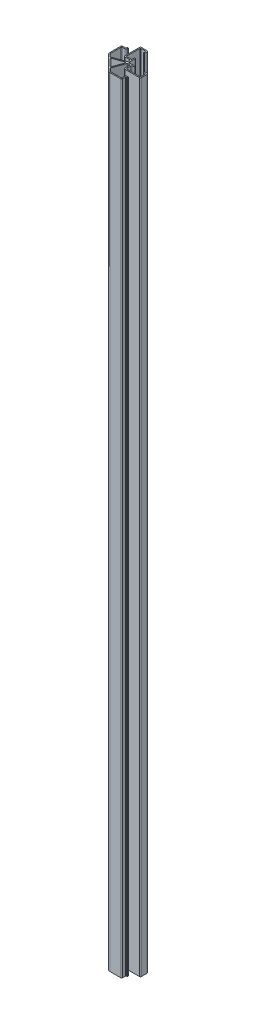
ISO-10303-21;
HEADER;
FILE_DESCRIPTION(('STEP AP214'),'2;1');
FILE_NAME('part.step','',(''),(''),'','','');
FILE_SCHEMA(('AUTOMOTIVE_DESIGN { 1 0 10303 214 1 1 1 1 }'));
ENDSEC;
DATA;
#1=APPLICATION_CONTEXT('core data for automotive mechanical design processes');
#2=APPLICATION_PROTOCOL_DEFINITION('international standard','automotive_design',2000,#1);
#3=PRODUCT_CONTEXT('',#1,'mechanical');
#4=PRODUCT('Part','Part','',(#3));
#5=PRODUCT_RELATED_PRODUCT_CATEGORY('part','',(#4));
#6=PRODUCT_DEFINITION_FORMATION('','',#4);
#7=PRODUCT_DEFINITION_CONTEXT('part definition',#1,'design');
#8=PRODUCT_DEFINITION('design','',#6,#7);
#9=PRODUCT_DEFINITION_SHAPE('','',#8);
#10=(LENGTH_UNIT() NAMED_UNIT(*) SI_UNIT(.MILLI.,.METRE.));
#11=(NAMED_UNIT(*) PLANE_ANGLE_UNIT() SI_UNIT($,.RADIAN.));
#12=(NAMED_UNIT(*) SI_UNIT($,.STERADIAN.) SOLID_ANGLE_UNIT());
#13=UNCERTAINTY_MEASURE_WITH_UNIT(LENGTH_MEASURE(1.E-05),#10,'distance_accuracy_value','');
#14=(GEOMETRIC_REPRESENTATION_CONTEXT(3) GLOBAL_UNCERTAINTY_ASSIGNED_CONTEXT((#13)) GLOBAL_UNIT_ASSIGNED_CONTEXT((#10,
#11,#12)) REPRESENTATION_CONTEXT('',''));
#15=CARTESIAN_POINT('',(0.,0.,0.));
#16=DIRECTION('',(0.,0.,1.));
#17=DIRECTION('',(1.,0.,0.));
#18=AXIS2_PLACEMENT_3D('',#15,#16,#17);
#19=CARTESIAN_POINT('',(-0.299999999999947,620.,-5.25));
#20=DIRECTION('',(0.,1.,0.));
#21=DIRECTION('',(0.,0.,1.));
#22=AXIS2_PLACEMENT_3D('',#19,#20,#21);
#23=PLANE('',#22);
#24=DIRECTION('',(0.,0.,-1.));
#25=VECTOR('',#24,1.);
#26=CARTESIAN_POINT('',(0.,620.,0.));
#27=LINE('',#26,#25);
#28=CARTESIAN_POINT('',(0.,620.,0.));
#29=VERTEX_POINT('',#28);
#30=CARTESIAN_POINT('',(0.,620.,-5.25));
#31=VERTEX_POINT('',#30);
#32=EDGE_CURVE('E667',#29,#31,#27,.T.);
#33=ORIENTED_EDGE('',*,*,#32,.T.);
#34=CARTESIAN_POINT('',(-0.299999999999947,620.,-5.25));
#35=DIRECTION('',(0.,1.,0.));
#36=DIRECTION('',(0.,0.,1.));
#37=AXIS2_PLACEMENT_3D('',#34,#35,#36);
#38=CIRCLE('',#37,0.3);
#39=CARTESIAN_POINT('',(-0.299999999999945,620.,-5.55));
#40=VERTEX_POINT('',#39);
#41=EDGE_CURVE('E670',#31,#40,#38,.T.);
#42=ORIENTED_EDGE('',*,*,#41,.T.);
#43=DIRECTION('',(-1.,0.,0.));
#44=VECTOR('',#43,1.);
#45=CARTESIAN_POINT('',(-0.299999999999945,620.,-5.55));
#46=LINE('',#45,#44);
#47=CARTESIAN_POINT('',(-0.549999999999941,620.,-5.55000000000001));
#48=VERTEX_POINT('',#47);
#49=EDGE_CURVE('E673',#40,#48,#46,.T.);
#50=ORIENTED_EDGE('',*,*,#49,.T.);
#51=CARTESIAN_POINT('',(-0.549999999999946,620.,-5.25000000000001));
#52=DIRECTION('',(0.,1.,0.));
#53=DIRECTION('',(0.,0.,1.));
#54=AXIS2_PLACEMENT_3D('',#51,#52,#53);
#55=CIRCLE('',#54,0.3);
#56=CARTESIAN_POINT('',(-0.849999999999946,620.,-5.25000000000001));
#57=VERTEX_POINT('',#56);
#58=EDGE_CURVE('E675',#48,#57,#55,.T.);
#59=ORIENTED_EDGE('',*,*,#58,.T.);
#60=DIRECTION('',(0.,0.,1.));
#61=VECTOR('',#60,1.);
#62=CARTESIAN_POINT('',(-0.849999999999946,620.,-5.25000000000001));
#63=LINE('',#62,#61);
#64=CARTESIAN_POINT('',(-0.849999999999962,620.,-3.75000000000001));
#65=VERTEX_POINT('',#64);
#66=EDGE_CURVE('E677',#57,#65,#63,.T.);
#67=ORIENTED_EDGE('',*,*,#66,.T.);
#68=CARTESIAN_POINT('',(-1.34999999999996,620.,-3.75000000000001));
#69=DIRECTION('',(0.,-1.,0.));
#70=DIRECTION('',(0.,0.,-1.));
#71=AXIS2_PLACEMENT_3D('',#68,#69,#70);
#72=CIRCLE('',#71,0.5);
#73=CARTESIAN_POINT('',(-1.34999999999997,620.,-3.25000000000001));
#74=VERTEX_POINT('',#73);
#75=EDGE_CURVE('E679',#65,#74,#72,.T.);
#76=ORIENTED_EDGE('',*,*,#75,.T.);
#77=DIRECTION('',(-1.,0.,0.));
#78=VECTOR('',#77,1.);
#79=CARTESIAN_POINT('',(-1.34999999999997,620.,-3.25000000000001));
#80=LINE('',#79,#78);
#81=CARTESIAN_POINT('',(-4.74999999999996,620.,-3.25000000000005));
#82=VERTEX_POINT('',#81);
#83=EDGE_CURVE('E681',#74,#82,#80,.T.);
#84=ORIENTED_EDGE('',*,*,#83,.T.);
#85=CARTESIAN_POINT('',(-4.74999999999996,620.,-3.75000000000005));
#86=DIRECTION('',(0.,-1.,0.));
#87=DIRECTION('',(0.,0.,1.));
#88=AXIS2_PLACEMENT_3D('',#85,#86,#87);
#89=CIRCLE('',#88,0.5);
#90=CARTESIAN_POINT('',(-5.24999999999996,620.,-3.75000000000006));
#91=VERTEX_POINT('',#90);
#92=EDGE_CURVE('E683',#82,#91,#89,.T.);
#93=ORIENTED_EDGE('',*,*,#92,.T.);
#94=DIRECTION('',(0.,0.,-1.));
#95=VECTOR('',#94,1.);
#96=CARTESIAN_POINT('',(-5.24999999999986,620.,-14.15));
#97=LINE('',#96,#95);
#98=CARTESIAN_POINT('',(-5.24999999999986,620.,-14.15));
#99=VERTEX_POINT('',#98);
#100=EDGE_CURVE('E685',#91,#99,#97,.T.);
#101=ORIENTED_EDGE('',*,*,#100,.T.);
#102=CARTESIAN_POINT('',(-4.74999999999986,620.,-14.15));
#103=DIRECTION('',(0.,-1.,0.));
#104=DIRECTION('',(0.,0.,1.));
#105=AXIS2_PLACEMENT_3D('',#102,#103,#104);
#106=CIRCLE('',#105,0.5);
#107=CARTESIAN_POINT('',(-4.74999999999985,620.,-14.65));
#108=VERTEX_POINT('',#107);
#109=EDGE_CURVE('E687',#99,#108,#106,.T.);
#110=ORIENTED_EDGE('',*,*,#109,.T.);
#111=DIRECTION('',(1.,0.,0.));
#112=VECTOR('',#111,1.);
#113=CARTESIAN_POINT('',(-1.34999999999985,620.,-14.65));
#114=LINE('',#113,#112);
#115=CARTESIAN_POINT('',(-1.34999999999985,620.,-14.65));
#116=VERTEX_POINT('',#115);
#117=EDGE_CURVE('E689',#108,#116,#114,.T.);
#118=ORIENTED_EDGE('',*,*,#117,.T.);
#119=CARTESIAN_POINT('',(-1.34999999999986,620.,-14.15));
#120=DIRECTION('',(0.,-1.,0.));
#121=DIRECTION('',(0.,0.,1.));
#122=AXIS2_PLACEMENT_3D('',#119,#120,#121);
#123=CIRCLE('',#122,0.5);
#124=CARTESIAN_POINT('',(-0.849999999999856,620.,-14.15));
#125=VERTEX_POINT('',#124);
#126=EDGE_CURVE('E691',#116,#125,#123,.T.);
#127=ORIENTED_EDGE('',*,*,#126,.T.);
#128=DIRECTION('',(0.,0.,1.));
#129=VECTOR('',#128,1.);
#130=CARTESIAN_POINT('',(-0.849999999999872,620.,-12.65));
#131=LINE('',#130,#129);
#132=CARTESIAN_POINT('',(-0.849999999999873,620.,-12.65));
#133=VERTEX_POINT('',#132);
#134=EDGE_CURVE('E693',#125,#133,#131,.T.);
#135=ORIENTED_EDGE('',*,*,#134,.T.);
#136=CARTESIAN_POINT('',(-0.54999999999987,620.,-12.65));
#137=DIRECTION('',(0.,1.,0.));
#138=DIRECTION('',(0.,0.,-1.));
#139=AXIS2_PLACEMENT_3D('',#136,#137,#138);
#140=CIRCLE('',#139,0.300000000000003);
#141=CARTESIAN_POINT('',(-0.549999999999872,620.,-12.35));
#142=VERTEX_POINT('',#141);
#143=EDGE_CURVE('E695',#133,#142,#140,.T.);
#144=ORIENTED_EDGE('',*,*,#143,.T.);
#145=DIRECTION('',(1.,0.,0.));
#146=VECTOR('',#145,1.);
#147=CARTESIAN_POINT('',(-0.299999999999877,620.,-12.35));
#148=LINE('',#147,#146);
#149=CARTESIAN_POINT('',(-0.299999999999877,620.,-12.35));
#150=VERTEX_POINT('',#149);
#151=EDGE_CURVE('E697',#142,#150,#148,.T.);
#152=ORIENTED_EDGE('',*,*,#151,.T.);
#153=CARTESIAN_POINT('',(-0.29999999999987,620.,-12.65));
#154=DIRECTION('',(0.,1.,0.));
#155=DIRECTION('',(0.,0.,-1.));
#156=AXIS2_PLACEMENT_3D('',#153,#154,#155);
#157=CIRCLE('',#156,0.299999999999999);
#158=CARTESIAN_POINT('',(1.28369537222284E-13,620.,-12.65));
#159=VERTEX_POINT('',#158);
#160=EDGE_CURVE('E699',#150,#159,#157,.T.);
#161=ORIENTED_EDGE('',*,*,#160,.T.);
#162=DIRECTION('',(0.,0.,-1.));
#163=VECTOR('',#162,1.);
#164=CARTESIAN_POINT('',(1.28369537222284E-13,620.,-12.65));
#165=LINE('',#164,#163);
#166=CARTESIAN_POINT('',(1.50920942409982E-13,620.,-14.7));
#167=VERTEX_POINT('',#166);
#168=EDGE_CURVE('E701',#159,#167,#165,.T.);
#169=ORIENTED_EDGE('',*,*,#168,.T.);
#170=CARTESIAN_POINT('',(-0.799999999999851,620.,-14.7));
#171=DIRECTION('',(0.,1.,0.));
#172=DIRECTION('',(0.,0.,-1.));
#173=AXIS2_PLACEMENT_3D('',#170,#171,#172);
#174=CIRCLE('',#173,0.800000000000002);
#175=CARTESIAN_POINT('',(-0.799999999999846,620.,-15.5));
#176=VERTEX_POINT('',#175);
#177=EDGE_CURVE('E703',#167,#176,#174,.T.);
#178=ORIENTED_EDGE('',*,*,#177,.T.);
#179=DIRECTION('',(-1.,0.,0.));
#180=VECTOR('',#179,1.);
#181=CARTESIAN_POINT('',(-0.799999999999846,620.,-15.5));
#182=LINE('',#181,#180);
#183=CARTESIAN_POINT('',(-5.29999999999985,620.,-15.5000000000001));
#184=VERTEX_POINT('',#183);
#185=EDGE_CURVE('E705',#176,#184,#182,.T.);
#186=ORIENTED_EDGE('',*,*,#185,.T.);
#187=CARTESIAN_POINT('',(-5.29999999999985,620.,-14.7000000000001));
#188=DIRECTION('',(0.,1.,0.));
#189=DIRECTION('',(0.,0.,-1.));
#190=AXIS2_PLACEMENT_3D('',#187,#188,#189);
#191=CIRCLE('',#190,0.799999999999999);
#192=CARTESIAN_POINT('',(-6.09999999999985,620.,-14.7000000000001));
#193=VERTEX_POINT('',#192);
#194=EDGE_CURVE('E707',#184,#193,#191,.T.);
#195=ORIENTED_EDGE('',*,*,#194,.T.);
#196=DIRECTION('',(0.,0.,1.));
#197=VECTOR('',#196,1.);
#198=CARTESIAN_POINT('',(-6.09999999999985,620.,-14.7000000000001));
#199=LINE('',#198,#197);
#200=CARTESIAN_POINT('',(-6.09999999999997,620.,-3.19700000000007));
#201=VERTEX_POINT('',#200);
#202=EDGE_CURVE('E709',#193,#201,#199,.T.);
#203=ORIENTED_EDGE('',*,*,#202,.T.);
#204=CARTESIAN_POINT('',(-5.29999999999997,620.,-3.19700000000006));
#205=DIRECTION('',(0.,1.,0.));
#206=DIRECTION('',(0.,0.,-1.));
#207=AXIS2_PLACEMENT_3D('',#204,#205,#206);
#208=CIRCLE('',#207,0.8);
#209=CARTESIAN_POINT('',(-5.29999999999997,620.,-2.39700000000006));
#210=VERTEX_POINT('',#209);
#211=EDGE_CURVE('E711',#201,#210,#208,.T.);
#212=ORIENTED_EDGE('',*,*,#211,.T.);
#213=DIRECTION('',(1.,0.,0.));
#214=VECTOR('',#213,1.);
#215=CARTESIAN_POINT('',(-5.29999999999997,620.,-2.39700000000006));
#216=LINE('',#215,#214);
#217=CARTESIAN_POINT('',(-1.34999999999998,620.,-2.39700000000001));
#218=VERTEX_POINT('',#217);
#219=EDGE_CURVE('E713',#210,#218,#216,.T.);
#220=ORIENTED_EDGE('',*,*,#219,.T.);
#221=CARTESIAN_POINT('',(-1.34999999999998,620.,-1.89700000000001));
#222=DIRECTION('',(0.,-1.,0.));
#223=DIRECTION('',(0.,0.,1.));
#224=AXIS2_PLACEMENT_3D('',#221,#222,#223);
#225=CIRCLE('',#224,0.5);
#226=CARTESIAN_POINT('',(-0.849999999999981,620.,-1.89700000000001));
#227=VERTEX_POINT('',#226);
#228=EDGE_CURVE('E715',#218,#227,#225,.T.);
#229=ORIENTED_EDGE('',*,*,#228,.T.);
#230=DIRECTION('',(0.,0.,1.));
#231=VECTOR('',#230,1.);
#232=CARTESIAN_POINT('',(-0.849999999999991,620.,-0.534636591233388));
#233=LINE('',#232,#231);
#234=CARTESIAN_POINT('',(-0.849999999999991,620.,-0.534636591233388));
#235=VERTEX_POINT('',#234);
#236=EDGE_CURVE('E717',#227,#235,#233,.T.);
#237=ORIENTED_EDGE('',*,*,#236,.T.);
#238=CARTESIAN_POINT('',(-1.34999999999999,620.,-0.534636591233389));
#239=DIRECTION('',(0.,-1.,0.));
#240=DIRECTION('',(0.,0.,-1.));
#241=AXIS2_PLACEMENT_3D('',#238,#239,#240);
#242=CIRCLE('',#241,0.5);
#243=CARTESIAN_POINT('',(-1.17898992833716,620.,-0.0647902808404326));
#244=VERTEX_POINT('',#243);
#245=EDGE_CURVE('E719',#235,#244,#242,.T.);
#246=ORIENTED_EDGE('',*,*,#245,.T.);
#247=DIRECTION('',(-0.93969262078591,0.,0.342020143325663));
#248=VECTOR('',#247,1.);
#249=CARTESIAN_POINT('',(-10.9485933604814,620.,3.49105456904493));
#250=LINE('',#249,#248);
#251=CARTESIAN_POINT('',(-10.9485933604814,620.,3.49105456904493));
#252=VERTEX_POINT('',#251);
#253=EDGE_CURVE('E721',#244,#252,#250,.T.);
#254=ORIENTED_EDGE('',*,*,#253,.T.);
#255=CARTESIAN_POINT('',(-11.1196034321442,620.,3.02120825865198));
#256=DIRECTION('',(0.,-1.,0.));
#257=DIRECTION('',(0.,0.,1.));
#258=AXIS2_PLACEMENT_3D('',#255,#256,#257);
#259=CIRCLE('',#258,0.499999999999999);
#260=CARTESIAN_POINT('',(-11.4731568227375,620.,3.37476164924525));
#261=VERTEX_POINT('',#260);
#262=EDGE_CURVE('E723',#252,#261,#259,.T.);
#263=ORIENTED_EDGE('',*,*,#262,.T.);
#264=DIRECTION('',(-0.707106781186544,0.,-0.707106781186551));
#265=VECTOR('',#264,1.);
#266=CARTESIAN_POINT('',(-11.4731568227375,620.,3.37476164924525));
#267=LINE('',#266,#265);
#268=CARTESIAN_POINT('',(-13.4035533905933,620.,1.44436508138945));
#269=VERTEX_POINT('',#268);
#270=EDGE_CURVE('E725',#261,#269,#267,.T.);
#271=ORIENTED_EDGE('',*,*,#270,.T.);
#272=CARTESIAN_POINT('',(-13.05,620.,1.09081169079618));
#273=DIRECTION('',(0.,-1.,0.));
#274=DIRECTION('',(0.,0.,-1.));
#275=AXIS2_PLACEMENT_3D('',#272,#273,#274);
#276=CIRCLE('',#275,0.500000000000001);
#277=CARTESIAN_POINT('',(-13.55,620.,1.09081169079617));
#278=VERTEX_POINT('',#277);
#279=EDGE_CURVE('E727',#269,#278,#276,.T.);
#280=ORIENTED_EDGE('',*,*,#279,.T.);
#281=DIRECTION('',(0.,0.,-1.));
#282=VECTOR('',#281,1.);
#283=CARTESIAN_POINT('',(-13.5499999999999,620.,-7.50000000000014));
#284=LINE('',#283,#282);
#285=CARTESIAN_POINT('',(-13.5499999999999,620.,-7.50000000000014));
#286=VERTEX_POINT('',#285);
#287=EDGE_CURVE('E729',#278,#286,#284,.T.);
#288=ORIENTED_EDGE('',*,*,#287,.T.);
#289=CARTESIAN_POINT('',(-13.0499999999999,620.,-7.50000000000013));
#290=DIRECTION('',(0.,-1.,0.));
#291=DIRECTION('',(0.,0.,-1.));
#292=AXIS2_PLACEMENT_3D('',#289,#290,#291);
#293=CIRCLE('',#292,0.500000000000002);
#294=CARTESIAN_POINT('',(-13.0499999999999,620.,-8.00000000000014));
#295=VERTEX_POINT('',#294);
#296=EDGE_CURVE('E731',#286,#295,#293,.T.);
#297=ORIENTED_EDGE('',*,*,#296,.T.);
#298=DIRECTION('',(1.,0.,0.));
#299=VECTOR('',#298,1.);
#300=CARTESIAN_POINT('',(-13.0499999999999,620.,-8.00000000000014));
#301=LINE('',#300,#299);
#302=CARTESIAN_POINT('',(-10.8999999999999,620.,-8.00000000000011));
#303=VERTEX_POINT('',#302);
#304=EDGE_CURVE('E733',#295,#303,#301,.T.);
#305=ORIENTED_EDGE('',*,*,#304,.T.);
#306=CARTESIAN_POINT('',(-10.8999999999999,620.,-8.80000000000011));
#307=DIRECTION('',(0.,1.,0.));
#308=DIRECTION('',(0.,0.,1.));
#309=AXIS2_PLACEMENT_3D('',#306,#307,#308);
#310=CIRCLE('',#309,0.800000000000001);
#311=CARTESIAN_POINT('',(-10.0999999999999,620.,-8.80000000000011));
#312=VERTEX_POINT('',#311);
#313=EDGE_CURVE('E735',#303,#312,#310,.T.);
#314=ORIENTED_EDGE('',*,*,#313,.T.);
#315=DIRECTION('',(0.,0.,-1.));
#316=VECTOR('',#315,1.);
#317=CARTESIAN_POINT('',(-10.0999999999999,620.,-9.7000000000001));
#318=LINE('',#317,#316);
#319=CARTESIAN_POINT('',(-10.0999999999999,620.,-9.7000000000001));
#320=VERTEX_POINT('',#319);
#321=EDGE_CURVE('E737',#312,#320,#318,.T.);
#322=ORIENTED_EDGE('',*,*,#321,.T.);
#323=CARTESIAN_POINT('',(-10.3999999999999,620.,-9.70000000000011));
#324=DIRECTION('',(0.,1.,0.));
#325=DIRECTION('',(0.,0.,-1.));
#326=AXIS2_PLACEMENT_3D('',#323,#324,#325);
#327=CIRCLE('',#326,0.299999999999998);
#328=CARTESIAN_POINT('',(-10.3999999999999,620.,-10.0000000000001));
#329=VERTEX_POINT('',#328);
#330=EDGE_CURVE('E739',#320,#329,#327,.T.);
#331=ORIENTED_EDGE('',*,*,#330,.T.);
#332=DIRECTION('',(-1.,0.,0.));
#333=VECTOR('',#332,1.);
#334=CARTESIAN_POINT('',(-10.3999999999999,620.,-10.0000000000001));
#335=LINE('',#334,#333);
#336=CARTESIAN_POINT('',(-10.6499999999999,620.,-10.0000000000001));
#337=VERTEX_POINT('',#336);
#338=EDGE_CURVE('E741',#329,#337,#335,.T.);
#339=ORIENTED_EDGE('',*,*,#338,.T.);
#340=CARTESIAN_POINT('',(-10.6499999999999,620.,-9.70000000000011));
#341=DIRECTION('',(0.,1.,0.));
#342=DIRECTION('',(0.,0.,-1.));
#343=AXIS2_PLACEMENT_3D('',#340,#341,#342);
#344=CIRCLE('',#343,0.3);
#345=CARTESIAN_POINT('',(-10.9499999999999,620.,-9.70000000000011));
#346=VERTEX_POINT('',#345);
#347=EDGE_CURVE('E743',#337,#346,#344,.T.);
#348=ORIENTED_EDGE('',*,*,#347,.T.);
#349=DIRECTION('',(0.,0.,1.));
#350=VECTOR('',#349,1.);
#351=CARTESIAN_POINT('',(-10.9499999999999,620.,-9.70000000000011));
#352=LINE('',#351,#350);
#353=CARTESIAN_POINT('',(-10.9499999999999,620.,-9.35000000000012));
#354=VERTEX_POINT('',#353);
#355=EDGE_CURVE('E745',#346,#354,#352,.T.);
#356=ORIENTED_EDGE('',*,*,#355,.T.);
#357=CARTESIAN_POINT('',(-11.4499999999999,620.,-9.35000000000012));
#358=DIRECTION('',(0.,-1.,0.));
#359=DIRECTION('',(0.,0.,1.));
#360=AXIS2_PLACEMENT_3D('',#357,#358,#359);
#361=CIRCLE('',#360,0.500000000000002);
#362=CARTESIAN_POINT('',(-11.4499999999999,620.,-8.85000000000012));
#363=VERTEX_POINT('',#362);
#364=EDGE_CURVE('E747',#354,#363,#361,.T.);
#365=ORIENTED_EDGE('',*,*,#364,.T.);
#366=DIRECTION('',(-1.,0.,0.));
#367=VECTOR('',#366,1.);
#368=CARTESIAN_POINT('',(-13.5999999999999,620.,-8.85000000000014));
#369=LINE('',#368,#367);
#370=CARTESIAN_POINT('',(-13.5999999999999,620.,-8.85000000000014));
#371=VERTEX_POINT('',#370);
#372=EDGE_CURVE('E749',#363,#371,#369,.T.);
#373=ORIENTED_EDGE('',*,*,#372,.T.);
#374=CARTESIAN_POINT('',(-13.5999999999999,620.,-8.05000000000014));
#375=DIRECTION('',(0.,1.,0.));
#376=DIRECTION('',(0.,0.,-1.));
#377=AXIS2_PLACEMENT_3D('',#374,#375,#376);
#378=CIRCLE('',#377,0.8);
#379=CARTESIAN_POINT('',(-14.3999999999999,620.,-8.05000000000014));
#380=VERTEX_POINT('',#379);
#381=EDGE_CURVE('E751',#371,#380,#378,.T.);
#382=ORIENTED_EDGE('',*,*,#381,.T.);
#383=DIRECTION('',(0.,0.,1.));
#384=VECTOR('',#383,1.);
#385=CARTESIAN_POINT('',(-14.3999999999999,620.,-8.05000000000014));
#386=LINE('',#385,#384);
#387=CARTESIAN_POINT('',(-14.4,620.,0.407359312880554));
#388=VERTEX_POINT('',#387);
#389=EDGE_CURVE('E753',#380,#388,#386,.T.);
#390=ORIENTED_EDGE('',*,*,#389,.T.);
#391=CARTESIAN_POINT('',(-11.4,620.,0.407359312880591));
#392=DIRECTION('',(0.,1.,0.));
#393=DIRECTION('',(0.,0.,-1.));
#394=AXIS2_PLACEMENT_3D('',#391,#392,#393);
#395=CIRCLE('',#394,3.);
#396=CARTESIAN_POINT('',(-13.5213203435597,620.,2.52867965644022));
#397=VERTEX_POINT('',#396);
#398=EDGE_CURVE('E755',#388,#397,#395,.T.);
#399=ORIENTED_EDGE('',*,*,#398,.T.);
#400=DIRECTION('',(0.707106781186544,0.,0.707106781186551));
#401=VECTOR('',#400,1.);
#402=CARTESIAN_POINT('',(-13.5213203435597,620.,2.52867965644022));
#403=LINE('',#402,#401);
#404=CARTESIAN_POINT('',(-2.52867965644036,620.,13.5213203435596));
#405=VERTEX_POINT('',#404);
#406=EDGE_CURVE('E757',#397,#405,#403,.T.);
#407=ORIENTED_EDGE('',*,*,#406,.T.);
#408=CARTESIAN_POINT('',(-0.407359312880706,620.,11.4));
#409=DIRECTION('',(0.,1.,0.));
#410=DIRECTION('',(0.,0.,1.));
#411=AXIS2_PLACEMENT_3D('',#408,#409,#410);
#412=CIRCLE('',#411,3.);
#413=CARTESIAN_POINT('',(-0.407359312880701,620.,14.4));
#414=VERTEX_POINT('',#413);
#415=EDGE_CURVE('E759',#405,#414,#412,.T.);
#416=ORIENTED_EDGE('',*,*,#415,.T.);
#417=DIRECTION('',(1.,0.,0.));
#418=VECTOR('',#417,1.);
#419=CARTESIAN_POINT('',(8.05,620.,14.4));
#420=LINE('',#419,#418);
#421=CARTESIAN_POINT('',(8.05,620.,14.4));
#422=VERTEX_POINT('',#421);
#423=EDGE_CURVE('E761',#414,#422,#420,.T.);
#424=ORIENTED_EDGE('',*,*,#423,.T.);
#425=CARTESIAN_POINT('',(8.05,620.,13.6));
#426=DIRECTION('',(0.,1.,0.));
#427=DIRECTION('',(0.,0.,1.));
#428=AXIS2_PLACEMENT_3D('',#425,#426,#427);
#429=CIRCLE('',#428,0.8);
#430=CARTESIAN_POINT('',(8.85,620.,13.6));
#431=VERTEX_POINT('',#430);
#432=EDGE_CURVE('E763',#422,#431,#429,.T.);
#433=ORIENTED_EDGE('',*,*,#432,.T.);
#434=DIRECTION('',(0.,0.,-1.));
#435=VECTOR('',#434,1.);
#436=CARTESIAN_POINT('',(8.85,620.,13.6));
#437=LINE('',#436,#435);
#438=CARTESIAN_POINT('',(8.85,620.,11.45));
#439=VERTEX_POINT('',#438);
#440=EDGE_CURVE('E765',#431,#439,#437,.T.);
#441=ORIENTED_EDGE('',*,*,#440,.T.);
#442=CARTESIAN_POINT('',(9.35,620.,11.45));
#443=DIRECTION('',(0.,-1.,0.));
#444=DIRECTION('',(0.,0.,-1.));
#445=AXIS2_PLACEMENT_3D('',#442,#443,#444);
#446=CIRCLE('',#445,0.5);
#447=CARTESIAN_POINT('',(9.35,620.,10.95));
#448=VERTEX_POINT('',#447);
#449=EDGE_CURVE('E767',#439,#448,#446,.T.);
#450=ORIENTED_EDGE('',*,*,#449,.T.);
#451=DIRECTION('',(1.,0.,0.));
#452=VECTOR('',#451,1.);
#453=CARTESIAN_POINT('',(9.7,620.,10.95));
#454=LINE('',#453,#452);
#455=CARTESIAN_POINT('',(9.7,620.,10.95));
#456=VERTEX_POINT('',#455);
#457=EDGE_CURVE('E769',#448,#456,#454,.T.);
#458=ORIENTED_EDGE('',*,*,#457,.T.);
#459=CARTESIAN_POINT('',(9.7,620.,10.65));
#460=DIRECTION('',(0.,1.,0.));
#461=DIRECTION('',(0.,0.,1.));
#462=AXIS2_PLACEMENT_3D('',#459,#460,#461);
#463=CIRCLE('',#462,0.3);
#464=CARTESIAN_POINT('',(10.,620.,10.65));
#465=VERTEX_POINT('',#464);
#466=EDGE_CURVE('E771',#456,#465,#463,.T.);
#467=ORIENTED_EDGE('',*,*,#466,.T.);
#468=DIRECTION('',(0.,0.,-1.));
#469=VECTOR('',#468,1.);
#470=CARTESIAN_POINT('',(10.,620.,10.4));
#471=LINE('',#470,#469);
#472=CARTESIAN_POINT('',(10.,620.,10.4));
#473=VERTEX_POINT('',#472);
#474=EDGE_CURVE('E773',#465,#473,#471,.T.);
#475=ORIENTED_EDGE('',*,*,#474,.T.);
#476=CARTESIAN_POINT('',(9.7,620.,10.4));
#477=DIRECTION('',(0.,1.,0.));
#478=DIRECTION('',(0.,0.,1.));
#479=AXIS2_PLACEMENT_3D('',#476,#477,#478);
#480=CIRCLE('',#479,0.3);
#481=CARTESIAN_POINT('',(9.7,620.,10.1));
#482=VERTEX_POINT('',#481);
#483=EDGE_CURVE('E775',#473,#482,#480,.T.);
#484=ORIENTED_EDGE('',*,*,#483,.T.);
#485=DIRECTION('',(-1.,0.,0.));
#486=VECTOR('',#485,1.);
#487=CARTESIAN_POINT('',(9.7,620.,10.1));
#488=LINE('',#487,#486);
#489=CARTESIAN_POINT('',(8.8,620.,10.1));
#490=VERTEX_POINT('',#489);
#491=EDGE_CURVE('E777',#482,#490,#488,.T.);
#492=ORIENTED_EDGE('',*,*,#491,.T.);
#493=CARTESIAN_POINT('',(8.8,620.,10.9));
#494=DIRECTION('',(0.,1.,0.));
#495=DIRECTION('',(0.,0.,-1.));
#496=AXIS2_PLACEMENT_3D('',#493,#494,#495);
#497=CIRCLE('',#496,0.8);
#498=CARTESIAN_POINT('',(8.,620.,10.9));
#499=VERTEX_POINT('',#498);
#500=EDGE_CURVE('E779',#490,#499,#497,.T.);
#501=ORIENTED_EDGE('',*,*,#500,.T.);
#502=DIRECTION('',(0.,0.,1.));
#503=VECTOR('',#502,1.);
#504=CARTESIAN_POINT('',(8.,620.,13.05));
#505=LINE('',#504,#503);
#506=CARTESIAN_POINT('',(8.,620.,13.05));
#507=VERTEX_POINT('',#506);
#508=EDGE_CURVE('E781',#499,#507,#505,.T.);
#509=ORIENTED_EDGE('',*,*,#508,.T.);
#510=CARTESIAN_POINT('',(7.5,620.,13.05));
#511=DIRECTION('',(0.,-1.,0.));
#512=DIRECTION('',(0.,0.,1.));
#513=AXIS2_PLACEMENT_3D('',#510,#511,#512);
#514=CIRCLE('',#513,0.5);
#515=CARTESIAN_POINT('',(7.5,620.,13.55));
#516=VERTEX_POINT('',#515);
#517=EDGE_CURVE('E783',#507,#516,#514,.T.);
#518=ORIENTED_EDGE('',*,*,#517,.T.);
#519=DIRECTION('',(-1.,0.,0.));
#520=VECTOR('',#519,1.);
#521=CARTESIAN_POINT('',(7.5,620.,13.55));
#522=LINE('',#521,#520);
#523=CARTESIAN_POINT('',(-1.09081169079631,620.,13.55));
#524=VERTEX_POINT('',#523);
#525=EDGE_CURVE('E785',#516,#524,#522,.T.);
#526=ORIENTED_EDGE('',*,*,#525,.T.);
#527=CARTESIAN_POINT('',(-1.09081169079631,620.,13.05));
#528=DIRECTION('',(0.,-1.,0.));
#529=DIRECTION('',(0.,0.,1.));
#530=AXIS2_PLACEMENT_3D('',#527,#528,#529);
#531=CIRCLE('',#530,0.500000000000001);
#532=CARTESIAN_POINT('',(-1.44436508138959,620.,13.4035533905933));
#533=VERTEX_POINT('',#532);
#534=EDGE_CURVE('E787',#524,#533,#531,.T.);
#535=ORIENTED_EDGE('',*,*,#534,.T.);
#536=DIRECTION('',(-0.707106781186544,0.,-0.707106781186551));
#537=VECTOR('',#536,1.);
#538=CARTESIAN_POINT('',(-1.44436508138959,620.,13.4035533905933));
#539=LINE('',#538,#537);
#540=CARTESIAN_POINT('',(-3.37476164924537,620.,11.4731568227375));
#541=VERTEX_POINT('',#540);
#542=EDGE_CURVE('E789',#533,#541,#539,.T.);
#543=ORIENTED_EDGE('',*,*,#542,.T.);
#544=CARTESIAN_POINT('',(-3.02120825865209,620.,11.1196034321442));
#545=DIRECTION('',(0.,-1.,0.));
#546=DIRECTION('',(0.,0.,-1.));
#547=AXIS2_PLACEMENT_3D('',#544,#545,#546);
#548=CIRCLE('',#547,0.500000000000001);
#549=CARTESIAN_POINT('',(-3.49105456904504,620.,10.9485933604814));
#550=VERTEX_POINT('',#549);
#551=EDGE_CURVE('E791',#541,#550,#548,.T.);
#552=ORIENTED_EDGE('',*,*,#551,.T.);
#553=DIRECTION('',(0.342020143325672,0.,-0.939692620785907));
#554=VECTOR('',#553,1.);
#555=CARTESIAN_POINT('',(-3.49105456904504,620.,10.9485933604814));
#556=LINE('',#555,#554);
#557=CARTESIAN_POINT('',(0.0647902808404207,620.,1.17898992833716));
#558=VERTEX_POINT('',#557);
#559=EDGE_CURVE('E793',#550,#558,#556,.T.);
#560=ORIENTED_EDGE('',*,*,#559,.T.);
#561=CARTESIAN_POINT('',(0.534636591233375,620.,1.35));
#562=DIRECTION('',(0.,-1.,0.));
#563=DIRECTION('',(0.,0.,1.));
#564=AXIS2_PLACEMENT_3D('',#561,#562,#563);
#565=CIRCLE('',#564,0.5);
#566=CARTESIAN_POINT('',(0.534636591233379,620.,0.849999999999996));
#567=VERTEX_POINT('',#566);
#568=EDGE_CURVE('E795',#558,#567,#565,.T.);
#569=ORIENTED_EDGE('',*,*,#568,.T.);
#570=DIRECTION('',(1.,0.,0.));
#571=VECTOR('',#570,1.);
#572=CARTESIAN_POINT('',(0.534636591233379,620.,0.849999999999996));
#573=LINE('',#572,#571);
#574=CARTESIAN_POINT('',(1.897,620.,0.85));
#575=VERTEX_POINT('',#574);
#576=EDGE_CURVE('E797',#567,#575,#573,.T.);
#577=ORIENTED_EDGE('',*,*,#576,.T.);
#578=CARTESIAN_POINT('',(1.897,620.,1.35));
#579=DIRECTION('',(0.,-1.,0.));
#580=DIRECTION('',(0.,0.,-1.));
#581=AXIS2_PLACEMENT_3D('',#578,#579,#580);
#582=CIRCLE('',#581,0.5);
#583=CARTESIAN_POINT('',(2.397,620.,1.35));
#584=VERTEX_POINT('',#583);
#585=EDGE_CURVE('E799',#575,#584,#582,.T.);
#586=ORIENTED_EDGE('',*,*,#585,.T.);
#587=DIRECTION('',(0.,0.,1.));
#588=VECTOR('',#587,1.);
#589=CARTESIAN_POINT('',(2.397,620.,5.3));
#590=LINE('',#589,#588);
#591=CARTESIAN_POINT('',(2.397,620.,5.29999999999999));
#592=VERTEX_POINT('',#591);
#593=EDGE_CURVE('E801',#584,#592,#590,.T.);
#594=ORIENTED_EDGE('',*,*,#593,.T.);
#595=CARTESIAN_POINT('',(3.197,620.,5.3));
#596=DIRECTION('',(0.,1.,0.));
#597=DIRECTION('',(0.,0.,1.));
#598=AXIS2_PLACEMENT_3D('',#595,#596,#597);
#599=CIRCLE('',#598,0.8);
#600=CARTESIAN_POINT('',(3.19700000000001,620.,6.1));
#601=VERTEX_POINT('',#600);
#602=EDGE_CURVE('E803',#592,#601,#599,.T.);
#603=ORIENTED_EDGE('',*,*,#602,.T.);
#604=DIRECTION('',(1.,0.,0.));
#605=VECTOR('',#604,1.);
#606=CARTESIAN_POINT('',(14.7,620.,6.1));
#607=LINE('',#606,#605);
#608=CARTESIAN_POINT('',(14.7,620.,6.1));
#609=VERTEX_POINT('',#608);
#610=EDGE_CURVE('E805',#601,#609,#607,.T.);
#611=ORIENTED_EDGE('',*,*,#610,.T.);
#612=CARTESIAN_POINT('',(14.7,620.,5.3));
#613=DIRECTION('',(0.,1.,0.));
#614=DIRECTION('',(0.,0.,1.));
#615=AXIS2_PLACEMENT_3D('',#612,#613,#614);
#616=CIRCLE('',#615,0.8);
#617=CARTESIAN_POINT('',(15.5,620.,5.29999999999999));
#618=VERTEX_POINT('',#617);
#619=EDGE_CURVE('E807',#609,#618,#616,.T.);
#620=ORIENTED_EDGE('',*,*,#619,.T.);
#621=DIRECTION('',(0.,0.,-1.));
#622=VECTOR('',#621,1.);
#623=CARTESIAN_POINT('',(15.5,620.,0.800000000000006));
#624=LINE('',#623,#622);
#625=CARTESIAN_POINT('',(15.5,620.,0.800000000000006));
#626=VERTEX_POINT('',#625);
#627=EDGE_CURVE('E809',#618,#626,#624,.T.);
#628=ORIENTED_EDGE('',*,*,#627,.T.);
#629=CARTESIAN_POINT('',(14.7,620.,0.8));
#630=DIRECTION('',(0.,1.,0.));
#631=DIRECTION('',(0.,0.,1.));
#632=AXIS2_PLACEMENT_3D('',#629,#630,#631);
#633=CIRCLE('',#632,0.8);
#634=CARTESIAN_POINT('',(14.7,620.,0.));
#635=VERTEX_POINT('',#634);
#636=EDGE_CURVE('E811',#626,#635,#633,.T.);
#637=ORIENTED_EDGE('',*,*,#636,.T.);
#638=DIRECTION('',(-1.,0.,0.));
#639=VECTOR('',#638,1.);
#640=CARTESIAN_POINT('',(12.65,620.,0.));
#641=LINE('',#640,#639);
#642=CARTESIAN_POINT('',(12.65,620.,0.));
#643=VERTEX_POINT('',#642);
#644=EDGE_CURVE('E813',#635,#643,#641,.T.);
#645=ORIENTED_EDGE('',*,*,#644,.T.);
#646=CARTESIAN_POINT('',(12.65,620.,0.3));
#647=DIRECTION('',(0.,1.,0.));
#648=DIRECTION('',(0.,0.,1.));
#649=AXIS2_PLACEMENT_3D('',#646,#647,#648);
#650=CIRCLE('',#649,0.3);
#651=CARTESIAN_POINT('',(12.35,620.,0.300000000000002));
#652=VERTEX_POINT('',#651);
#653=EDGE_CURVE('E815',#643,#652,#650,.T.);
#654=ORIENTED_EDGE('',*,*,#653,.T.);
#655=DIRECTION('',(0.,0.,1.));
#656=VECTOR('',#655,1.);
#657=CARTESIAN_POINT('',(12.35,620.,0.300000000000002));
#658=LINE('',#657,#656);
#659=CARTESIAN_POINT('',(12.35,620.,0.549999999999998));
#660=VERTEX_POINT('',#659);
#661=EDGE_CURVE('E817',#652,#660,#658,.T.);
#662=ORIENTED_EDGE('',*,*,#661,.T.);
#663=CARTESIAN_POINT('',(12.65,620.,0.55));
#664=DIRECTION('',(0.,1.,0.));
#665=DIRECTION('',(0.,0.,1.));
#666=AXIS2_PLACEMENT_3D('',#663,#664,#665);
#667=CIRCLE('',#666,0.3);
#668=CARTESIAN_POINT('',(12.65,620.,0.85));
#669=VERTEX_POINT('',#668);
#670=EDGE_CURVE('E819',#660,#669,#667,.T.);
#671=ORIENTED_EDGE('',*,*,#670,.T.);
#672=DIRECTION('',(1.,0.,0.));
#673=VECTOR('',#672,1.);
#674=CARTESIAN_POINT('',(12.65,620.,0.85));
#675=LINE('',#674,#673);
#676=CARTESIAN_POINT('',(14.15,620.,0.85));
#677=VERTEX_POINT('',#676);
#678=EDGE_CURVE('E821',#669,#677,#675,.T.);
#679=ORIENTED_EDGE('',*,*,#678,.T.);
#680=CARTESIAN_POINT('',(14.15,620.,1.35));
#681=DIRECTION('',(0.,-1.,0.));
#682=DIRECTION('',(0.,0.,-1.));
#683=AXIS2_PLACEMENT_3D('',#680,#681,#682);
#684=CIRCLE('',#683,0.5);
#685=CARTESIAN_POINT('',(14.65,620.,1.35));
#686=VERTEX_POINT('',#685);
#687=EDGE_CURVE('E823',#677,#686,#684,.T.);
#688=ORIENTED_EDGE('',*,*,#687,.T.);
#689=DIRECTION('',(0.,0.,1.));
#690=VECTOR('',#689,1.);
#691=CARTESIAN_POINT('',(14.65,620.,1.35));
#692=LINE('',#691,#690);
#693=CARTESIAN_POINT('',(14.65,620.,4.75));
#694=VERTEX_POINT('',#693);
#695=EDGE_CURVE('E825',#686,#694,#692,.T.);
#696=ORIENTED_EDGE('',*,*,#695,.T.);
#697=CARTESIAN_POINT('',(14.15,620.,4.75));
#698=DIRECTION('',(0.,-1.,0.));
#699=DIRECTION('',(0.,0.,-1.));
#700=AXIS2_PLACEMENT_3D('',#697,#698,#699);
#701=CIRCLE('',#700,0.5);
#702=CARTESIAN_POINT('',(14.15,620.,5.25));
#703=VERTEX_POINT('',#702);
#704=EDGE_CURVE('E827',#694,#703,#701,.T.);
#705=ORIENTED_EDGE('',*,*,#704,.T.);
#706=DIRECTION('',(-1.,0.,0.));
#707=VECTOR('',#706,1.);
#708=CARTESIAN_POINT('',(14.15,620.,5.25));
#709=LINE('',#708,#707);
#710=CARTESIAN_POINT('',(3.75,620.,5.25));
#711=VERTEX_POINT('',#710);
#712=EDGE_CURVE('E829',#703,#711,#709,.T.);
#713=ORIENTED_EDGE('',*,*,#712,.T.);
#714=CARTESIAN_POINT('',(3.75,620.,4.75));
#715=DIRECTION('',(0.,-1.,0.));
#716=DIRECTION('',(0.,0.,-1.));
#717=AXIS2_PLACEMENT_3D('',#714,#715,#716);
#718=CIRCLE('',#717,0.5);
#719=CARTESIAN_POINT('',(3.25,620.,4.75));
#720=VERTEX_POINT('',#719);
#721=EDGE_CURVE('E831',#711,#720,#718,.T.);
#722=ORIENTED_EDGE('',*,*,#721,.T.);
#723=DIRECTION('',(0.,0.,-1.));
#724=VECTOR('',#723,1.);
#725=CARTESIAN_POINT('',(3.25,620.,1.35));
#726=LINE('',#725,#724);
#727=CARTESIAN_POINT('',(3.25,620.,1.35));
#728=VERTEX_POINT('',#727);
#729=EDGE_CURVE('E833',#720,#728,#726,.T.);
#730=ORIENTED_EDGE('',*,*,#729,.T.);
#731=CARTESIAN_POINT('',(3.75,620.,1.35));
#732=DIRECTION('',(0.,-1.,0.));
#733=DIRECTION('',(0.,0.,1.));
#734=AXIS2_PLACEMENT_3D('',#731,#732,#733);
#735=CIRCLE('',#734,0.5);
#736=CARTESIAN_POINT('',(3.75,620.,0.85));
#737=VERTEX_POINT('',#736);
#738=EDGE_CURVE('E835',#728,#737,#735,.T.);
#739=ORIENTED_EDGE('',*,*,#738,.T.);
#740=DIRECTION('',(1.,0.,0.));
#741=VECTOR('',#740,1.);
#742=CARTESIAN_POINT('',(5.25,620.,0.85));
#743=LINE('',#742,#741);
#744=CARTESIAN_POINT('',(5.25,620.,0.85));
#745=VERTEX_POINT('',#744);
#746=EDGE_CURVE('E837',#737,#745,#743,.T.);
#747=ORIENTED_EDGE('',*,*,#746,.T.);
#748=CARTESIAN_POINT('',(5.25,620.,0.55));
#749=DIRECTION('',(0.,1.,0.));
#750=DIRECTION('',(0.,0.,-1.));
#751=AXIS2_PLACEMENT_3D('',#748,#749,#750);
#752=CIRCLE('',#751,0.3);
#753=CARTESIAN_POINT('',(5.55,620.,0.549999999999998));
#754=VERTEX_POINT('',#753);
#755=EDGE_CURVE('E839',#745,#754,#752,.T.);
#756=ORIENTED_EDGE('',*,*,#755,.T.);
#757=DIRECTION('',(0.,0.,-1.));
#758=VECTOR('',#757,1.);
#759=CARTESIAN_POINT('',(5.55,620.,0.299999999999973));
#760=LINE('',#759,#758);
#761=CARTESIAN_POINT('',(5.55000000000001,620.,0.299999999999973));
#762=VERTEX_POINT('',#761);
#763=EDGE_CURVE('E841',#754,#762,#760,.T.);
#764=ORIENTED_EDGE('',*,*,#763,.T.);
#765=CARTESIAN_POINT('',(5.25,620.,0.3));
#766=DIRECTION('',(0.,1.,0.));
#767=DIRECTION('',(0.,0.,-1.));
#768=AXIS2_PLACEMENT_3D('',#765,#766,#767);
#769=CIRCLE('',#768,0.300000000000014);
#770=CARTESIAN_POINT('',(5.25,620.,0.));
#771=VERTEX_POINT('',#770);
#772=EDGE_CURVE('E843',#762,#771,#769,.T.);
#773=ORIENTED_EDGE('',*,*,#772,.T.);
#774=DIRECTION('',(-1.,0.,0.));
#775=VECTOR('',#774,1.);
#776=CARTESIAN_POINT('',(0.,620.,0.));
#777=LINE('',#776,#775);
#778=EDGE_CURVE('E845',#771,#29,#777,.T.);
#779=ORIENTED_EDGE('',*,*,#778,.T.);
#780=EDGE_LOOP('',(#33,#42,#50,#59,#67,#76,#84,#93,#101,#110,#118,#127,#135,#144,#152,#161,#169,
#178,#186,#195,#203,#212,#220,#229,#237,#246,#254,#263,#271,#280,#288,#297,#305,#314,#322,#331,
#339,#348,#356,#365,#373,#382,#390,#399,#407,#416,#424,#433,#441,#450,#458,#467,#475,#484,#492,
#501,#509,#518,#526,#535,#543,#552,#560,#569,#577,#586,#594,#603,#611,#620,#628,#637,#645,#654,
#662,#671,#679,#688,#696,#705,#713,#722,#730,#739,#747,#756,#764,#773,#779));
#781=FACE_BOUND('',#780,.T.);
#782=DIRECTION('',(0.342020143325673,0.,-0.939692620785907));
#783=VECTOR('',#782,1.);
#784=CARTESIAN_POINT('',(-3.99474306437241,620.,9.84723238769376));
#785=LINE('',#784,#783);
#786=CARTESIAN_POINT('',(-3.99474306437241,620.,9.84723238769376));
#787=VERTEX_POINT('',#786);
#788=CARTESIAN_POINT('',(-1.01236808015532,620.,1.6532244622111));
#789=VERTEX_POINT('',#788);
#790=EDGE_CURVE('E629',#787,#789,#785,.T.);
#791=ORIENTED_EDGE('',*,*,#790,.F.);
#792=CARTESIAN_POINT('',(-4.46458937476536,620.,9.67622231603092));
#793=DIRECTION('',(0.,1.,0.));
#794=DIRECTION('',(0.,0.,1.));
#795=AXIS2_PLACEMENT_3D('',#792,#793,#794);
#796=CIRCLE('',#795,0.500000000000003);
#797=CARTESIAN_POINT('',(-4.81814276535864,620.,10.0297757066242));
#798=VERTEX_POINT('',#797);
#799=EDGE_CURVE('E619',#798,#787,#796,.T.);
#800=ORIENTED_EDGE('',*,*,#799,.F.);
#801=DIRECTION('',(0.707106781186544,0.,0.707106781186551));
#802=VECTOR('',#801,1.);
#803=CARTESIAN_POINT('',(-7.42395923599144,620.,7.42395923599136));
#804=LINE('',#803,#802);
#805=CARTESIAN_POINT('',(-10.0297757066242,620.,4.81814276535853));
#806=VERTEX_POINT('',#805);
#807=EDGE_CURVE('E649',#806,#798,#804,.T.);
#808=ORIENTED_EDGE('',*,*,#807,.F.);
#809=CARTESIAN_POINT('',(-9.67622231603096,620.,4.46458937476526));
#810=DIRECTION('',(0.,1.,0.));
#811=DIRECTION('',(0.,0.,-1.));
#812=AXIS2_PLACEMENT_3D('',#809,#810,#811);
#813=CIRCLE('',#812,0.500000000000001);
#814=CARTESIAN_POINT('',(-9.8472323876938,620.,3.99474306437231));
#815=VERTEX_POINT('',#814);
#816=EDGE_CURVE('E644',#815,#806,#813,.T.);
#817=ORIENTED_EDGE('',*,*,#816,.F.);
#818=DIRECTION('',(-0.93969262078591,0.,0.342020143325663));
#819=VECTOR('',#818,1.);
#820=CARTESIAN_POINT('',(-9.8472323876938,620.,3.99474306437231));
#821=LINE('',#820,#819);
#822=CARTESIAN_POINT('',(-1.65322446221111,620.,1.01236808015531));
#823=VERTEX_POINT('',#822);
#824=EDGE_CURVE('E642',#823,#815,#821,.T.);
#825=ORIENTED_EDGE('',*,*,#824,.F.);
#826=CARTESIAN_POINT('',(-1.48221439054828,620.,1.48221439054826));
#827=DIRECTION('',(0.,1.,0.));
#828=DIRECTION('',(0.,0.,1.));
#829=AXIS2_PLACEMENT_3D('',#826,#827,#828);
#830=CIRCLE('',#829,0.5);
#831=EDGE_CURVE('E11',#823,#789,#830,.F.);
#832=ORIENTED_EDGE('',*,*,#831,.T.);
#833=EDGE_LOOP('',(#791,#800,#808,#817,#825,#832));
#834=FACE_BOUND('',#833,.T.);
#835=ADVANCED_FACE('F33',(#781,#834),#23,.T.);
#836=CARTESIAN_POINT('',(-0.299999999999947,0.,-5.25));
#837=DIRECTION('',(0.,1.,0.));
#838=DIRECTION('',(0.,0.,1.));
#839=AXIS2_PLACEMENT_3D('',#836,#837,#838);
#840=PLANE('',#839);
#841=DIRECTION('',(0.,0.,-1.));
#842=VECTOR('',#841,1.);
#843=CARTESIAN_POINT('',(0.,0.,0.));
#844=LINE('',#843,#842);
#845=CARTESIAN_POINT('',(0.,0.,0.));
#846=VERTEX_POINT('',#845);
#847=CARTESIAN_POINT('',(0.,0.,-5.25));
#848=VERTEX_POINT('',#847);
#849=EDGE_CURVE('E638',#846,#848,#844,.T.);
#850=ORIENTED_EDGE('',*,*,#849,.F.);
#851=DIRECTION('',(-1.,0.,0.));
#852=VECTOR('',#851,1.);
#853=CARTESIAN_POINT('',(0.,0.,0.));
#854=LINE('',#853,#852);
#855=CARTESIAN_POINT('',(5.25,0.,0.));
#856=VERTEX_POINT('',#855);
#857=EDGE_CURVE('E671',#856,#846,#854,.T.);
#858=ORIENTED_EDGE('',*,*,#857,.F.);
#859=CARTESIAN_POINT('',(5.25,0.,0.3));
#860=DIRECTION('',(0.,1.,0.));
#861=DIRECTION('',(0.,0.,-1.));
#862=AXIS2_PLACEMENT_3D('',#859,#860,#861);
#863=CIRCLE('',#862,0.300000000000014);
#864=CARTESIAN_POINT('',(5.55000000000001,0.,0.299999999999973));
#865=VERTEX_POINT('',#864);
#866=EDGE_CURVE('E1023',#865,#856,#863,.T.);
#867=ORIENTED_EDGE('',*,*,#866,.F.);
#868=DIRECTION('',(0.,0.,-1.));
#869=VECTOR('',#868,1.);
#870=CARTESIAN_POINT('',(5.55,0.,0.299999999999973));
#871=LINE('',#870,#869);
#872=CARTESIAN_POINT('',(5.55,0.,0.549999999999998));
#873=VERTEX_POINT('',#872);
#874=EDGE_CURVE('E1021',#873,#865,#871,.T.);
#875=ORIENTED_EDGE('',*,*,#874,.F.);
#876=CARTESIAN_POINT('',(5.25,0.,0.55));
#877=DIRECTION('',(0.,1.,0.));
#878=DIRECTION('',(0.,0.,-1.));
#879=AXIS2_PLACEMENT_3D('',#876,#877,#878);
#880=CIRCLE('',#879,0.3);
#881=CARTESIAN_POINT('',(5.25,0.,0.85));
#882=VERTEX_POINT('',#881);
#883=EDGE_CURVE('E1019',#882,#873,#880,.T.);
#884=ORIENTED_EDGE('',*,*,#883,.F.);
#885=DIRECTION('',(1.,0.,0.));
#886=VECTOR('',#885,1.);
#887=CARTESIAN_POINT('',(5.25,0.,0.85));
#888=LINE('',#887,#886);
#889=CARTESIAN_POINT('',(3.75,0.,0.85));
#890=VERTEX_POINT('',#889);
#891=EDGE_CURVE('E1017',#890,#882,#888,.T.);
#892=ORIENTED_EDGE('',*,*,#891,.F.);
#893=CARTESIAN_POINT('',(3.75,0.,1.35));
#894=DIRECTION('',(0.,-1.,0.));
#895=DIRECTION('',(0.,0.,1.));
#896=AXIS2_PLACEMENT_3D('',#893,#894,#895);
#897=CIRCLE('',#896,0.5);
#898=CARTESIAN_POINT('',(3.25,0.,1.35));
#899=VERTEX_POINT('',#898);
#900=EDGE_CURVE('E1015',#899,#890,#897,.T.);
#901=ORIENTED_EDGE('',*,*,#900,.F.);
#902=DIRECTION('',(0.,0.,-1.));
#903=VECTOR('',#902,1.);
#904=CARTESIAN_POINT('',(3.25,0.,1.35));
#905=LINE('',#904,#903);
#906=CARTESIAN_POINT('',(3.25,0.,4.75));
#907=VERTEX_POINT('',#906);
#908=EDGE_CURVE('E1013',#907,#899,#905,.T.);
#909=ORIENTED_EDGE('',*,*,#908,.F.);
#910=CARTESIAN_POINT('',(3.75,0.,4.75));
#911=DIRECTION('',(0.,-1.,0.));
#912=DIRECTION('',(0.,0.,-1.));
#913=AXIS2_PLACEMENT_3D('',#910,#911,#912);
#914=CIRCLE('',#913,0.5);
#915=CARTESIAN_POINT('',(3.75,0.,5.25));
#916=VERTEX_POINT('',#915);
#917=EDGE_CURVE('E1011',#916,#907,#914,.T.);
#918=ORIENTED_EDGE('',*,*,#917,.F.);
#919=DIRECTION('',(-1.,0.,0.));
#920=VECTOR('',#919,1.);
#921=CARTESIAN_POINT('',(14.15,0.,5.25));
#922=LINE('',#921,#920);
#923=CARTESIAN_POINT('',(14.15,0.,5.25));
#924=VERTEX_POINT('',#923);
#925=EDGE_CURVE('E1009',#924,#916,#922,.T.);
#926=ORIENTED_EDGE('',*,*,#925,.F.);
#927=CARTESIAN_POINT('',(14.15,0.,4.75));
#928=DIRECTION('',(0.,-1.,0.));
#929=DIRECTION('',(0.,0.,-1.));
#930=AXIS2_PLACEMENT_3D('',#927,#928,#929);
#931=CIRCLE('',#930,0.5);
#932=CARTESIAN_POINT('',(14.65,0.,4.75));
#933=VERTEX_POINT('',#932);
#934=EDGE_CURVE('E1007',#933,#924,#931,.T.);
#935=ORIENTED_EDGE('',*,*,#934,.F.);
#936=DIRECTION('',(0.,0.,1.));
#937=VECTOR('',#936,1.);
#938=CARTESIAN_POINT('',(14.65,0.,1.35));
#939=LINE('',#938,#937);
#940=CARTESIAN_POINT('',(14.65,0.,1.35));
#941=VERTEX_POINT('',#940);
#942=EDGE_CURVE('E1005',#941,#933,#939,.T.);
#943=ORIENTED_EDGE('',*,*,#942,.F.);
#944=CARTESIAN_POINT('',(14.15,0.,1.35));
#945=DIRECTION('',(0.,-1.,0.));
#946=DIRECTION('',(0.,0.,-1.));
#947=AXIS2_PLACEMENT_3D('',#944,#945,#946);
#948=CIRCLE('',#947,0.5);
#949=CARTESIAN_POINT('',(14.15,0.,0.85));
#950=VERTEX_POINT('',#949);
#951=EDGE_CURVE('E1003',#950,#941,#948,.T.);
#952=ORIENTED_EDGE('',*,*,#951,.F.);
#953=DIRECTION('',(1.,0.,0.));
#954=VECTOR('',#953,1.);
#955=CARTESIAN_POINT('',(12.65,0.,0.85));
#956=LINE('',#955,#954);
#957=CARTESIAN_POINT('',(12.65,0.,0.85));
#958=VERTEX_POINT('',#957);
#959=EDGE_CURVE('E1001',#958,#950,#956,.T.);
#960=ORIENTED_EDGE('',*,*,#959,.F.);
#961=CARTESIAN_POINT('',(12.65,0.,0.55));
#962=DIRECTION('',(0.,1.,0.));
#963=DIRECTION('',(0.,0.,1.));
#964=AXIS2_PLACEMENT_3D('',#961,#962,#963);
#965=CIRCLE('',#964,0.3);
#966=CARTESIAN_POINT('',(12.35,0.,0.549999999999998));
#967=VERTEX_POINT('',#966);
#968=EDGE_CURVE('E999',#967,#958,#965,.T.);
#969=ORIENTED_EDGE('',*,*,#968,.F.);
#970=DIRECTION('',(0.,0.,1.));
#971=VECTOR('',#970,1.);
#972=CARTESIAN_POINT('',(12.35,0.,0.300000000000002));
#973=LINE('',#972,#971);
#974=CARTESIAN_POINT('',(12.35,0.,0.300000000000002));
#975=VERTEX_POINT('',#974);
#976=EDGE_CURVE('E997',#975,#967,#973,.T.);
#977=ORIENTED_EDGE('',*,*,#976,.F.);
#978=CARTESIAN_POINT('',(12.65,0.,0.3));
#979=DIRECTION('',(0.,1.,0.));
#980=DIRECTION('',(0.,0.,1.));
#981=AXIS2_PLACEMENT_3D('',#978,#979,#980);
#982=CIRCLE('',#981,0.3);
#983=CARTESIAN_POINT('',(12.65,0.,0.));
#984=VERTEX_POINT('',#983);
#985=EDGE_CURVE('E995',#984,#975,#982,.T.);
#986=ORIENTED_EDGE('',*,*,#985,.F.);
#987=DIRECTION('',(-1.,0.,0.));
#988=VECTOR('',#987,1.);
#989=CARTESIAN_POINT('',(12.65,0.,0.));
#990=LINE('',#989,#988);
#991=CARTESIAN_POINT('',(14.7,0.,0.));
#992=VERTEX_POINT('',#991);
#993=EDGE_CURVE('E993',#992,#984,#990,.T.);
#994=ORIENTED_EDGE('',*,*,#993,.F.);
#995=CARTESIAN_POINT('',(14.7,0.,0.8));
#996=DIRECTION('',(0.,1.,0.));
#997=DIRECTION('',(0.,0.,1.));
#998=AXIS2_PLACEMENT_3D('',#995,#996,#997);
#999=CIRCLE('',#998,0.8);
#1000=CARTESIAN_POINT('',(15.5,0.,0.800000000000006));
#1001=VERTEX_POINT('',#1000);
#1002=EDGE_CURVE('E991',#1001,#992,#999,.T.);
#1003=ORIENTED_EDGE('',*,*,#1002,.F.);
#1004=DIRECTION('',(0.,0.,-1.));
#1005=VECTOR('',#1004,1.);
#1006=CARTESIAN_POINT('',(15.5,0.,0.800000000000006));
#1007=LINE('',#1006,#1005);
#1008=CARTESIAN_POINT('',(15.5,0.,5.29999999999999));
#1009=VERTEX_POINT('',#1008);
#1010=EDGE_CURVE('E989',#1009,#1001,#1007,.T.);
#1011=ORIENTED_EDGE('',*,*,#1010,.F.);
#1012=CARTESIAN_POINT('',(14.7,0.,5.3));
#1013=DIRECTION('',(0.,1.,0.));
#1014=DIRECTION('',(0.,0.,1.));
#1015=AXIS2_PLACEMENT_3D('',#1012,#1013,#1014);
#1016=CIRCLE('',#1015,0.8);
#1017=CARTESIAN_POINT('',(14.7,0.,6.1));
#1018=VERTEX_POINT('',#1017);
#1019=EDGE_CURVE('E987',#1018,#1009,#1016,.T.);
#1020=ORIENTED_EDGE('',*,*,#1019,.F.);
#1021=DIRECTION('',(1.,0.,0.));
#1022=VECTOR('',#1021,1.);
#1023=CARTESIAN_POINT('',(14.7,0.,6.1));
#1024=LINE('',#1023,#1022);
#1025=CARTESIAN_POINT('',(3.19700000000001,0.,6.1));
#1026=VERTEX_POINT('',#1025);
#1027=EDGE_CURVE('E985',#1026,#1018,#1024,.T.);
#1028=ORIENTED_EDGE('',*,*,#1027,.F.);
#1029=CARTESIAN_POINT('',(3.197,0.,5.3));
#1030=DIRECTION('',(0.,1.,0.));
#1031=DIRECTION('',(0.,0.,1.));
#1032=AXIS2_PLACEMENT_3D('',#1029,#1030,#1031);
#1033=CIRCLE('',#1032,0.8);
#1034=CARTESIAN_POINT('',(2.397,0.,5.29999999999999));
#1035=VERTEX_POINT('',#1034);
#1036=EDGE_CURVE('E983',#1035,#1026,#1033,.T.);
#1037=ORIENTED_EDGE('',*,*,#1036,.F.);
#1038=DIRECTION('',(0.,0.,1.));
#1039=VECTOR('',#1038,1.);
#1040=CARTESIAN_POINT('',(2.397,0.,5.3));
#1041=LINE('',#1040,#1039);
#1042=CARTESIAN_POINT('',(2.397,0.,1.35));
#1043=VERTEX_POINT('',#1042);
#1044=EDGE_CURVE('E981',#1043,#1035,#1041,.T.);
#1045=ORIENTED_EDGE('',*,*,#1044,.F.);
#1046=CARTESIAN_POINT('',(1.897,0.,1.35));
#1047=DIRECTION('',(0.,-1.,0.));
#1048=DIRECTION('',(0.,0.,-1.));
#1049=AXIS2_PLACEMENT_3D('',#1046,#1047,#1048);
#1050=CIRCLE('',#1049,0.5);
#1051=CARTESIAN_POINT('',(1.897,0.,0.85));
#1052=VERTEX_POINT('',#1051);
#1053=EDGE_CURVE('E979',#1052,#1043,#1050,.T.);
#1054=ORIENTED_EDGE('',*,*,#1053,.F.);
#1055=DIRECTION('',(1.,0.,0.));
#1056=VECTOR('',#1055,1.);
#1057=CARTESIAN_POINT('',(0.534636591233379,0.,0.849999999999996));
#1058=LINE('',#1057,#1056);
#1059=CARTESIAN_POINT('',(0.534636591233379,0.,0.849999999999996));
#1060=VERTEX_POINT('',#1059);
#1061=EDGE_CURVE('E977',#1060,#1052,#1058,.T.);
#1062=ORIENTED_EDGE('',*,*,#1061,.F.);
#1063=CARTESIAN_POINT('',(0.534636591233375,0.,1.35));
#1064=DIRECTION('',(0.,-1.,0.));
#1065=DIRECTION('',(0.,0.,1.));
#1066=AXIS2_PLACEMENT_3D('',#1063,#1064,#1065);
#1067=CIRCLE('',#1066,0.5);
#1068=CARTESIAN_POINT('',(0.0647902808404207,0.,1.17898992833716));
#1069=VERTEX_POINT('',#1068);
#1070=EDGE_CURVE('E975',#1069,#1060,#1067,.T.);
#1071=ORIENTED_EDGE('',*,*,#1070,.F.);
#1072=DIRECTION('',(0.342020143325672,0.,-0.939692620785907));
#1073=VECTOR('',#1072,1.);
#1074=CARTESIAN_POINT('',(-3.49105456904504,0.,10.9485933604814));
#1075=LINE('',#1074,#1073);
#1076=CARTESIAN_POINT('',(-3.49105456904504,0.,10.9485933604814));
#1077=VERTEX_POINT('',#1076);
#1078=EDGE_CURVE('E973',#1077,#1069,#1075,.T.);
#1079=ORIENTED_EDGE('',*,*,#1078,.F.);
#1080=CARTESIAN_POINT('',(-3.02120825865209,0.,11.1196034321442));
#1081=DIRECTION('',(0.,-1.,0.));
#1082=DIRECTION('',(0.,0.,-1.));
#1083=AXIS2_PLACEMENT_3D('',#1080,#1081,#1082);
#1084=CIRCLE('',#1083,0.500000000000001);
#1085=CARTESIAN_POINT('',(-3.37476164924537,0.,11.4731568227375));
#1086=VERTEX_POINT('',#1085);
#1087=EDGE_CURVE('E971',#1086,#1077,#1084,.T.);
#1088=ORIENTED_EDGE('',*,*,#1087,.F.);
#1089=DIRECTION('',(-0.707106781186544,0.,-0.707106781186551));
#1090=VECTOR('',#1089,1.);
#1091=CARTESIAN_POINT('',(-1.44436508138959,0.,13.4035533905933));
#1092=LINE('',#1091,#1090);
#1093=CARTESIAN_POINT('',(-1.44436508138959,0.,13.4035533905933));
#1094=VERTEX_POINT('',#1093);
#1095=EDGE_CURVE('E969',#1094,#1086,#1092,.T.);
#1096=ORIENTED_EDGE('',*,*,#1095,.F.);
#1097=CARTESIAN_POINT('',(-1.09081169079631,0.,13.05));
#1098=DIRECTION('',(0.,-1.,0.));
#1099=DIRECTION('',(0.,0.,1.));
#1100=AXIS2_PLACEMENT_3D('',#1097,#1098,#1099);
#1101=CIRCLE('',#1100,0.500000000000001);
#1102=CARTESIAN_POINT('',(-1.09081169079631,0.,13.55));
#1103=VERTEX_POINT('',#1102);
#1104=EDGE_CURVE('E967',#1103,#1094,#1101,.T.);
#1105=ORIENTED_EDGE('',*,*,#1104,.F.);
#1106=DIRECTION('',(-1.,0.,0.));
#1107=VECTOR('',#1106,1.);
#1108=CARTESIAN_POINT('',(7.5,0.,13.55));
#1109=LINE('',#1108,#1107);
#1110=CARTESIAN_POINT('',(7.5,0.,13.55));
#1111=VERTEX_POINT('',#1110);
#1112=EDGE_CURVE('E965',#1111,#1103,#1109,.T.);
#1113=ORIENTED_EDGE('',*,*,#1112,.F.);
#1114=CARTESIAN_POINT('',(7.5,0.,13.05));
#1115=DIRECTION('',(0.,-1.,0.));
#1116=DIRECTION('',(0.,0.,1.));
#1117=AXIS2_PLACEMENT_3D('',#1114,#1115,#1116);
#1118=CIRCLE('',#1117,0.5);
#1119=CARTESIAN_POINT('',(8.,0.,13.05));
#1120=VERTEX_POINT('',#1119);
#1121=EDGE_CURVE('E963',#1120,#1111,#1118,.T.);
#1122=ORIENTED_EDGE('',*,*,#1121,.F.);
#1123=DIRECTION('',(0.,0.,1.));
#1124=VECTOR('',#1123,1.);
#1125=CARTESIAN_POINT('',(8.,0.,13.05));
#1126=LINE('',#1125,#1124);
#1127=CARTESIAN_POINT('',(8.,0.,10.9));
#1128=VERTEX_POINT('',#1127);
#1129=EDGE_CURVE('E961',#1128,#1120,#1126,.T.);
#1130=ORIENTED_EDGE('',*,*,#1129,.F.);
#1131=CARTESIAN_POINT('',(8.8,0.,10.9));
#1132=DIRECTION('',(0.,1.,0.));
#1133=DIRECTION('',(0.,0.,-1.));
#1134=AXIS2_PLACEMENT_3D('',#1131,#1132,#1133);
#1135=CIRCLE('',#1134,0.8);
#1136=CARTESIAN_POINT('',(8.8,0.,10.1));
#1137=VERTEX_POINT('',#1136);
#1138=EDGE_CURVE('E959',#1137,#1128,#1135,.T.);
#1139=ORIENTED_EDGE('',*,*,#1138,.F.);
#1140=DIRECTION('',(-1.,0.,0.));
#1141=VECTOR('',#1140,1.);
#1142=CARTESIAN_POINT('',(9.7,0.,10.1));
#1143=LINE('',#1142,#1141);
#1144=CARTESIAN_POINT('',(9.7,0.,10.1));
#1145=VERTEX_POINT('',#1144);
#1146=EDGE_CURVE('E957',#1145,#1137,#1143,.T.);
#1147=ORIENTED_EDGE('',*,*,#1146,.F.);
#1148=CARTESIAN_POINT('',(9.7,0.,10.4));
#1149=DIRECTION('',(0.,1.,0.));
#1150=DIRECTION('',(0.,0.,1.));
#1151=AXIS2_PLACEMENT_3D('',#1148,#1149,#1150);
#1152=CIRCLE('',#1151,0.3);
#1153=CARTESIAN_POINT('',(10.,0.,10.4));
#1154=VERTEX_POINT('',#1153);
#1155=EDGE_CURVE('E955',#1154,#1145,#1152,.T.);
#1156=ORIENTED_EDGE('',*,*,#1155,.F.);
#1157=DIRECTION('',(0.,0.,-1.));
#1158=VECTOR('',#1157,1.);
#1159=CARTESIAN_POINT('',(10.,0.,10.4));
#1160=LINE('',#1159,#1158);
#1161=CARTESIAN_POINT('',(10.,0.,10.65));
#1162=VERTEX_POINT('',#1161);
#1163=EDGE_CURVE('E953',#1162,#1154,#1160,.T.);
#1164=ORIENTED_EDGE('',*,*,#1163,.F.);
#1165=CARTESIAN_POINT('',(9.7,0.,10.65));
#1166=DIRECTION('',(0.,1.,0.));
#1167=DIRECTION('',(0.,0.,1.));
#1168=AXIS2_PLACEMENT_3D('',#1165,#1166,#1167);
#1169=CIRCLE('',#1168,0.3);
#1170=CARTESIAN_POINT('',(9.7,0.,10.95));
#1171=VERTEX_POINT('',#1170);
#1172=EDGE_CURVE('E951',#1171,#1162,#1169,.T.);
#1173=ORIENTED_EDGE('',*,*,#1172,.F.);
#1174=DIRECTION('',(1.,0.,0.));
#1175=VECTOR('',#1174,1.);
#1176=CARTESIAN_POINT('',(9.7,0.,10.95));
#1177=LINE('',#1176,#1175);
#1178=CARTESIAN_POINT('',(9.35,0.,10.95));
#1179=VERTEX_POINT('',#1178);
#1180=EDGE_CURVE('E949',#1179,#1171,#1177,.T.);
#1181=ORIENTED_EDGE('',*,*,#1180,.F.);
#1182=CARTESIAN_POINT('',(9.35,0.,11.45));
#1183=DIRECTION('',(0.,-1.,0.));
#1184=DIRECTION('',(0.,0.,-1.));
#1185=AXIS2_PLACEMENT_3D('',#1182,#1183,#1184);
#1186=CIRCLE('',#1185,0.5);
#1187=CARTESIAN_POINT('',(8.85,0.,11.45));
#1188=VERTEX_POINT('',#1187);
#1189=EDGE_CURVE('E947',#1188,#1179,#1186,.T.);
#1190=ORIENTED_EDGE('',*,*,#1189,.F.);
#1191=DIRECTION('',(0.,0.,-1.));
#1192=VECTOR('',#1191,1.);
#1193=CARTESIAN_POINT('',(8.85,0.,13.6));
#1194=LINE('',#1193,#1192);
#1195=CARTESIAN_POINT('',(8.85,0.,13.6));
#1196=VERTEX_POINT('',#1195);
#1197=EDGE_CURVE('E945',#1196,#1188,#1194,.T.);
#1198=ORIENTED_EDGE('',*,*,#1197,.F.);
#1199=CARTESIAN_POINT('',(8.05,0.,13.6));
#1200=DIRECTION('',(0.,1.,0.));
#1201=DIRECTION('',(0.,0.,1.));
#1202=AXIS2_PLACEMENT_3D('',#1199,#1200,#1201);
#1203=CIRCLE('',#1202,0.8);
#1204=CARTESIAN_POINT('',(8.05,0.,14.4));
#1205=VERTEX_POINT('',#1204);
#1206=EDGE_CURVE('E943',#1205,#1196,#1203,.T.);
#1207=ORIENTED_EDGE('',*,*,#1206,.F.);
#1208=DIRECTION('',(1.,0.,0.));
#1209=VECTOR('',#1208,1.);
#1210=CARTESIAN_POINT('',(8.05,0.,14.4));
#1211=LINE('',#1210,#1209);
#1212=CARTESIAN_POINT('',(-0.407359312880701,0.,14.4));
#1213=VERTEX_POINT('',#1212);
#1214=EDGE_CURVE('E941',#1213,#1205,#1211,.T.);
#1215=ORIENTED_EDGE('',*,*,#1214,.F.);
#1216=CARTESIAN_POINT('',(-0.407359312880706,0.,11.4));
#1217=DIRECTION('',(0.,1.,0.));
#1218=DIRECTION('',(0.,0.,1.));
#1219=AXIS2_PLACEMENT_3D('',#1216,#1217,#1218);
#1220=CIRCLE('',#1219,3.);
#1221=CARTESIAN_POINT('',(-2.52867965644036,0.,13.5213203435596));
#1222=VERTEX_POINT('',#1221);
#1223=EDGE_CURVE('E939',#1222,#1213,#1220,.T.);
#1224=ORIENTED_EDGE('',*,*,#1223,.F.);
#1225=DIRECTION('',(0.707106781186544,0.,0.707106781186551));
#1226=VECTOR('',#1225,1.);
#1227=CARTESIAN_POINT('',(-2.52867965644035,0.,13.5213203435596));
#1228=LINE('',#1227,#1226);
#1229=CARTESIAN_POINT('',(-13.5213203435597,0.,2.52867965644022));
#1230=VERTEX_POINT('',#1229);
#1231=EDGE_CURVE('E937',#1230,#1222,#1228,.T.);
#1232=ORIENTED_EDGE('',*,*,#1231,.F.);
#1233=CARTESIAN_POINT('',(-11.4,0.,0.407359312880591));
#1234=DIRECTION('',(0.,1.,0.));
#1235=DIRECTION('',(0.,0.,-1.));
#1236=AXIS2_PLACEMENT_3D('',#1233,#1234,#1235);
#1237=CIRCLE('',#1236,3.);
#1238=CARTESIAN_POINT('',(-14.4,0.,0.407359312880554));
#1239=VERTEX_POINT('',#1238);
#1240=EDGE_CURVE('E934',#1239,#1230,#1237,.T.);
#1241=ORIENTED_EDGE('',*,*,#1240,.F.);
#1242=DIRECTION('',(0.,0.,1.));
#1243=VECTOR('',#1242,1.);
#1244=CARTESIAN_POINT('',(-14.3999999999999,0.,-8.05000000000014));
#1245=LINE('',#1244,#1243);
#1246=CARTESIAN_POINT('',(-14.3999999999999,0.,-8.05000000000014));
#1247=VERTEX_POINT('',#1246);
#1248=EDGE_CURVE('E932',#1247,#1239,#1245,.T.);
#1249=ORIENTED_EDGE('',*,*,#1248,.F.);
#1250=CARTESIAN_POINT('',(-13.5999999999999,0.,-8.05000000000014));
#1251=DIRECTION('',(0.,1.,0.));
#1252=DIRECTION('',(0.,0.,-1.));
#1253=AXIS2_PLACEMENT_3D('',#1250,#1251,#1252);
#1254=CIRCLE('',#1253,0.8);
#1255=CARTESIAN_POINT('',(-13.5999999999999,0.,-8.85000000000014));
#1256=VERTEX_POINT('',#1255);
#1257=EDGE_CURVE('E930',#1256,#1247,#1254,.T.);
#1258=ORIENTED_EDGE('',*,*,#1257,.F.);
#1259=DIRECTION('',(-1.,0.,0.));
#1260=VECTOR('',#1259,1.);
#1261=CARTESIAN_POINT('',(-13.5999999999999,0.,-8.85000000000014));
#1262=LINE('',#1261,#1260);
#1263=CARTESIAN_POINT('',(-11.4499999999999,0.,-8.85000000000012));
#1264=VERTEX_POINT('',#1263);
#1265=EDGE_CURVE('E928',#1264,#1256,#1262,.T.);
#1266=ORIENTED_EDGE('',*,*,#1265,.F.);
#1267=CARTESIAN_POINT('',(-11.4499999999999,0.,-9.35000000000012));
#1268=DIRECTION('',(0.,-1.,0.));
#1269=DIRECTION('',(0.,0.,1.));
#1270=AXIS2_PLACEMENT_3D('',#1267,#1268,#1269);
#1271=CIRCLE('',#1270,0.500000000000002);
#1272=CARTESIAN_POINT('',(-10.9499999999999,0.,-9.35000000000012));
#1273=VERTEX_POINT('',#1272);
#1274=EDGE_CURVE('E926',#1273,#1264,#1271,.T.);
#1275=ORIENTED_EDGE('',*,*,#1274,.F.);
#1276=DIRECTION('',(0.,0.,1.));
#1277=VECTOR('',#1276,1.);
#1278=CARTESIAN_POINT('',(-10.9499999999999,0.,-9.70000000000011));
#1279=LINE('',#1278,#1277);
#1280=CARTESIAN_POINT('',(-10.9499999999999,0.,-9.70000000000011));
#1281=VERTEX_POINT('',#1280);
#1282=EDGE_CURVE('E924',#1281,#1273,#1279,.T.);
#1283=ORIENTED_EDGE('',*,*,#1282,.F.);
#1284=CARTESIAN_POINT('',(-10.6499999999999,0.,-9.70000000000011));
#1285=DIRECTION('',(0.,1.,0.));
#1286=DIRECTION('',(0.,0.,-1.));
#1287=AXIS2_PLACEMENT_3D('',#1284,#1285,#1286);
#1288=CIRCLE('',#1287,0.3);
#1289=CARTESIAN_POINT('',(-10.6499999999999,0.,-10.0000000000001));
#1290=VERTEX_POINT('',#1289);
#1291=EDGE_CURVE('E922',#1290,#1281,#1288,.T.);
#1292=ORIENTED_EDGE('',*,*,#1291,.F.);
#1293=DIRECTION('',(-1.,0.,0.));
#1294=VECTOR('',#1293,1.);
#1295=CARTESIAN_POINT('',(-10.3999999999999,0.,-10.0000000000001));
#1296=LINE('',#1295,#1294);
#1297=CARTESIAN_POINT('',(-10.3999999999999,0.,-10.0000000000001));
#1298=VERTEX_POINT('',#1297);
#1299=EDGE_CURVE('E920',#1298,#1290,#1296,.T.);
#1300=ORIENTED_EDGE('',*,*,#1299,.F.);
#1301=CARTESIAN_POINT('',(-10.3999999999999,0.,-9.70000000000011));
#1302=DIRECTION('',(0.,1.,0.));
#1303=DIRECTION('',(0.,0.,-1.));
#1304=AXIS2_PLACEMENT_3D('',#1301,#1302,#1303);
#1305=CIRCLE('',#1304,0.299999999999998);
#1306=CARTESIAN_POINT('',(-10.0999999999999,0.,-9.7000000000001));
#1307=VERTEX_POINT('',#1306);
#1308=EDGE_CURVE('E918',#1307,#1298,#1305,.T.);
#1309=ORIENTED_EDGE('',*,*,#1308,.F.);
#1310=DIRECTION('',(0.,0.,-1.));
#1311=VECTOR('',#1310,1.);
#1312=CARTESIAN_POINT('',(-10.0999999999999,0.,-9.7000000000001));
#1313=LINE('',#1312,#1311);
#1314=CARTESIAN_POINT('',(-10.0999999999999,0.,-8.80000000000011));
#1315=VERTEX_POINT('',#1314);
#1316=EDGE_CURVE('E916',#1315,#1307,#1313,.T.);
#1317=ORIENTED_EDGE('',*,*,#1316,.F.);
#1318=CARTESIAN_POINT('',(-10.8999999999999,0.,-8.80000000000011));
#1319=DIRECTION('',(0.,1.,0.));
#1320=DIRECTION('',(0.,0.,1.));
#1321=AXIS2_PLACEMENT_3D('',#1318,#1319,#1320);
#1322=CIRCLE('',#1321,0.800000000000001);
#1323=CARTESIAN_POINT('',(-10.8999999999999,0.,-8.00000000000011));
#1324=VERTEX_POINT('',#1323);
#1325=EDGE_CURVE('E914',#1324,#1315,#1322,.T.);
#1326=ORIENTED_EDGE('',*,*,#1325,.F.);
#1327=DIRECTION('',(1.,0.,0.));
#1328=VECTOR('',#1327,1.);
#1329=CARTESIAN_POINT('',(-13.0499999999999,0.,-8.00000000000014));
#1330=LINE('',#1329,#1328);
#1331=CARTESIAN_POINT('',(-13.0499999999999,0.,-8.00000000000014));
#1332=VERTEX_POINT('',#1331);
#1333=EDGE_CURVE('E912',#1332,#1324,#1330,.T.);
#1334=ORIENTED_EDGE('',*,*,#1333,.F.);
#1335=CARTESIAN_POINT('',(-13.0499999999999,0.,-7.50000000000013));
#1336=DIRECTION('',(0.,-1.,0.));
#1337=DIRECTION('',(0.,0.,-1.));
#1338=AXIS2_PLACEMENT_3D('',#1335,#1336,#1337);
#1339=CIRCLE('',#1338,0.500000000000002);
#1340=CARTESIAN_POINT('',(-13.5499999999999,0.,-7.50000000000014));
#1341=VERTEX_POINT('',#1340);
#1342=EDGE_CURVE('E910',#1341,#1332,#1339,.T.);
#1343=ORIENTED_EDGE('',*,*,#1342,.F.);
#1344=DIRECTION('',(0.,0.,-1.));
#1345=VECTOR('',#1344,1.);
#1346=CARTESIAN_POINT('',(-13.5499999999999,0.,-7.50000000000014));
#1347=LINE('',#1346,#1345);
#1348=CARTESIAN_POINT('',(-13.55,0.,1.09081169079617));
#1349=VERTEX_POINT('',#1348);
#1350=EDGE_CURVE('E908',#1349,#1341,#1347,.T.);
#1351=ORIENTED_EDGE('',*,*,#1350,.F.);
#1352=CARTESIAN_POINT('',(-13.05,0.,1.09081169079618));
#1353=DIRECTION('',(0.,-1.,0.));
#1354=DIRECTION('',(0.,0.,-1.));
#1355=AXIS2_PLACEMENT_3D('',#1352,#1353,#1354);
#1356=CIRCLE('',#1355,0.500000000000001);
#1357=CARTESIAN_POINT('',(-13.4035533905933,0.,1.44436508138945));
#1358=VERTEX_POINT('',#1357);
#1359=EDGE_CURVE('E906',#1358,#1349,#1356,.T.);
#1360=ORIENTED_EDGE('',*,*,#1359,.F.);
#1361=DIRECTION('',(-0.707106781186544,0.,-0.707106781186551));
#1362=VECTOR('',#1361,1.);
#1363=CARTESIAN_POINT('',(-11.4731568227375,0.,3.37476164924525));
#1364=LINE('',#1363,#1362);
#1365=CARTESIAN_POINT('',(-11.4731568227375,0.,3.37476164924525));
#1366=VERTEX_POINT('',#1365);
#1367=EDGE_CURVE('E904',#1366,#1358,#1364,.T.);
#1368=ORIENTED_EDGE('',*,*,#1367,.F.);
#1369=CARTESIAN_POINT('',(-11.1196034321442,0.,3.02120825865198));
#1370=DIRECTION('',(0.,-1.,0.));
#1371=DIRECTION('',(0.,0.,1.));
#1372=AXIS2_PLACEMENT_3D('',#1369,#1370,#1371);
#1373=CIRCLE('',#1372,0.499999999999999);
#1374=CARTESIAN_POINT('',(-10.9485933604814,0.,3.49105456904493));
#1375=VERTEX_POINT('',#1374);
#1376=EDGE_CURVE('E902',#1375,#1366,#1373,.T.);
#1377=ORIENTED_EDGE('',*,*,#1376,.F.);
#1378=DIRECTION('',(-0.93969262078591,0.,0.342020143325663));
#1379=VECTOR('',#1378,1.);
#1380=CARTESIAN_POINT('',(-10.9485933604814,0.,3.49105456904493));
#1381=LINE('',#1380,#1379);
#1382=CARTESIAN_POINT('',(-1.17898992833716,0.,-0.0647902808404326));
#1383=VERTEX_POINT('',#1382);
#1384=EDGE_CURVE('E900',#1383,#1375,#1381,.T.);
#1385=ORIENTED_EDGE('',*,*,#1384,.F.);
#1386=CARTESIAN_POINT('',(-1.34999999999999,0.,-0.534636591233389));
#1387=DIRECTION('',(0.,-1.,0.));
#1388=DIRECTION('',(0.,0.,-1.));
#1389=AXIS2_PLACEMENT_3D('',#1386,#1387,#1388);
#1390=CIRCLE('',#1389,0.5);
#1391=CARTESIAN_POINT('',(-0.849999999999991,0.,-0.534636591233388));
#1392=VERTEX_POINT('',#1391);
#1393=EDGE_CURVE('E898',#1392,#1383,#1390,.T.);
#1394=ORIENTED_EDGE('',*,*,#1393,.F.);
#1395=DIRECTION('',(0.,0.,1.));
#1396=VECTOR('',#1395,1.);
#1397=CARTESIAN_POINT('',(-0.849999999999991,0.,-0.534636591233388));
#1398=LINE('',#1397,#1396);
#1399=CARTESIAN_POINT('',(-0.849999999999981,0.,-1.89700000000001));
#1400=VERTEX_POINT('',#1399);
#1401=EDGE_CURVE('E896',#1400,#1392,#1398,.T.);
#1402=ORIENTED_EDGE('',*,*,#1401,.F.);
#1403=CARTESIAN_POINT('',(-1.34999999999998,0.,-1.89700000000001));
#1404=DIRECTION('',(0.,-1.,0.));
#1405=DIRECTION('',(0.,0.,1.));
#1406=AXIS2_PLACEMENT_3D('',#1403,#1404,#1405);
#1407=CIRCLE('',#1406,0.5);
#1408=CARTESIAN_POINT('',(-1.34999999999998,0.,-2.39700000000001));
#1409=VERTEX_POINT('',#1408);
#1410=EDGE_CURVE('E894',#1409,#1400,#1407,.T.);
#1411=ORIENTED_EDGE('',*,*,#1410,.F.);
#1412=DIRECTION('',(1.,0.,0.));
#1413=VECTOR('',#1412,1.);
#1414=CARTESIAN_POINT('',(-5.29999999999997,0.,-2.39700000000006));
#1415=LINE('',#1414,#1413);
#1416=CARTESIAN_POINT('',(-5.29999999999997,0.,-2.39700000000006));
#1417=VERTEX_POINT('',#1416);
#1418=EDGE_CURVE('E892',#1417,#1409,#1415,.T.);
#1419=ORIENTED_EDGE('',*,*,#1418,.F.);
#1420=CARTESIAN_POINT('',(-5.29999999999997,0.,-3.19700000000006));
#1421=DIRECTION('',(0.,1.,0.));
#1422=DIRECTION('',(0.,0.,-1.));
#1423=AXIS2_PLACEMENT_3D('',#1420,#1421,#1422);
#1424=CIRCLE('',#1423,0.8);
#1425=CARTESIAN_POINT('',(-6.09999999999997,0.,-3.19700000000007));
#1426=VERTEX_POINT('',#1425);
#1427=EDGE_CURVE('E890',#1426,#1417,#1424,.T.);
#1428=ORIENTED_EDGE('',*,*,#1427,.F.);
#1429=DIRECTION('',(0.,0.,1.));
#1430=VECTOR('',#1429,1.);
#1431=CARTESIAN_POINT('',(-6.09999999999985,0.,-14.7000000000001));
#1432=LINE('',#1431,#1430);
#1433=CARTESIAN_POINT('',(-6.09999999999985,0.,-14.7000000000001));
#1434=VERTEX_POINT('',#1433);
#1435=EDGE_CURVE('E888',#1434,#1426,#1432,.T.);
#1436=ORIENTED_EDGE('',*,*,#1435,.F.);
#1437=CARTESIAN_POINT('',(-5.29999999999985,0.,-14.7000000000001));
#1438=DIRECTION('',(0.,1.,0.));
#1439=DIRECTION('',(0.,0.,-1.));
#1440=AXIS2_PLACEMENT_3D('',#1437,#1438,#1439);
#1441=CIRCLE('',#1440,0.799999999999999);
#1442=CARTESIAN_POINT('',(-5.29999999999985,0.,-15.5000000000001));
#1443=VERTEX_POINT('',#1442);
#1444=EDGE_CURVE('E886',#1443,#1434,#1441,.T.);
#1445=ORIENTED_EDGE('',*,*,#1444,.F.);
#1446=DIRECTION('',(-1.,0.,0.));
#1447=VECTOR('',#1446,1.);
#1448=CARTESIAN_POINT('',(-0.799999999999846,0.,-15.5));
#1449=LINE('',#1448,#1447);
#1450=CARTESIAN_POINT('',(-0.799999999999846,0.,-15.5));
#1451=VERTEX_POINT('',#1450);
#1452=EDGE_CURVE('E884',#1451,#1443,#1449,.T.);
#1453=ORIENTED_EDGE('',*,*,#1452,.F.);
#1454=CARTESIAN_POINT('',(-0.799999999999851,0.,-14.7));
#1455=DIRECTION('',(0.,1.,0.));
#1456=DIRECTION('',(0.,0.,-1.));
#1457=AXIS2_PLACEMENT_3D('',#1454,#1455,#1456);
#1458=CIRCLE('',#1457,0.800000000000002);
#1459=CARTESIAN_POINT('',(1.50920942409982E-13,0.,-14.7));
#1460=VERTEX_POINT('',#1459);
#1461=EDGE_CURVE('E882',#1460,#1451,#1458,.T.);
#1462=ORIENTED_EDGE('',*,*,#1461,.F.);
#1463=DIRECTION('',(0.,0.,-1.));
#1464=VECTOR('',#1463,1.);
#1465=CARTESIAN_POINT('',(1.28369537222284E-13,0.,-12.65));
#1466=LINE('',#1465,#1464);
#1467=CARTESIAN_POINT('',(1.28369537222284E-13,0.,-12.65));
#1468=VERTEX_POINT('',#1467);
#1469=EDGE_CURVE('E880',#1468,#1460,#1466,.T.);
#1470=ORIENTED_EDGE('',*,*,#1469,.F.);
#1471=CARTESIAN_POINT('',(-0.29999999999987,0.,-12.65));
#1472=DIRECTION('',(0.,1.,0.));
#1473=DIRECTION('',(0.,0.,-1.));
#1474=AXIS2_PLACEMENT_3D('',#1471,#1472,#1473);
#1475=CIRCLE('',#1474,0.299999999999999);
#1476=CARTESIAN_POINT('',(-0.299999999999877,0.,-12.35));
#1477=VERTEX_POINT('',#1476);
#1478=EDGE_CURVE('E878',#1477,#1468,#1475,.T.);
#1479=ORIENTED_EDGE('',*,*,#1478,.F.);
#1480=DIRECTION('',(1.,0.,0.));
#1481=VECTOR('',#1480,1.);
#1482=CARTESIAN_POINT('',(-0.299999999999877,0.,-12.35));
#1483=LINE('',#1482,#1481);
#1484=CARTESIAN_POINT('',(-0.549999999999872,0.,-12.35));
#1485=VERTEX_POINT('',#1484);
#1486=EDGE_CURVE('E876',#1485,#1477,#1483,.T.);
#1487=ORIENTED_EDGE('',*,*,#1486,.F.);
#1488=CARTESIAN_POINT('',(-0.54999999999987,0.,-12.65));
#1489=DIRECTION('',(0.,1.,0.));
#1490=DIRECTION('',(0.,0.,-1.));
#1491=AXIS2_PLACEMENT_3D('',#1488,#1489,#1490);
#1492=CIRCLE('',#1491,0.300000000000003);
#1493=CARTESIAN_POINT('',(-0.849999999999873,0.,-12.65));
#1494=VERTEX_POINT('',#1493);
#1495=EDGE_CURVE('E874',#1494,#1485,#1492,.T.);
#1496=ORIENTED_EDGE('',*,*,#1495,.F.);
#1497=DIRECTION('',(0.,0.,1.));
#1498=VECTOR('',#1497,1.);
#1499=CARTESIAN_POINT('',(-0.849999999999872,0.,-12.65));
#1500=LINE('',#1499,#1498);
#1501=CARTESIAN_POINT('',(-0.849999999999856,0.,-14.15));
#1502=VERTEX_POINT('',#1501);
#1503=EDGE_CURVE('E872',#1502,#1494,#1500,.T.);
#1504=ORIENTED_EDGE('',*,*,#1503,.F.);
#1505=CARTESIAN_POINT('',(-1.34999999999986,0.,-14.15));
#1506=DIRECTION('',(0.,-1.,0.));
#1507=DIRECTION('',(0.,0.,1.));
#1508=AXIS2_PLACEMENT_3D('',#1505,#1506,#1507);
#1509=CIRCLE('',#1508,0.5);
#1510=CARTESIAN_POINT('',(-1.34999999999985,0.,-14.65));
#1511=VERTEX_POINT('',#1510);
#1512=EDGE_CURVE('E870',#1511,#1502,#1509,.T.);
#1513=ORIENTED_EDGE('',*,*,#1512,.F.);
#1514=DIRECTION('',(1.,0.,0.));
#1515=VECTOR('',#1514,1.);
#1516=CARTESIAN_POINT('',(-1.34999999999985,0.,-14.65));
#1517=LINE('',#1516,#1515);
#1518=CARTESIAN_POINT('',(-4.74999999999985,0.,-14.65));
#1519=VERTEX_POINT('',#1518);
#1520=EDGE_CURVE('E868',#1519,#1511,#1517,.T.);
#1521=ORIENTED_EDGE('',*,*,#1520,.F.);
#1522=CARTESIAN_POINT('',(-4.74999999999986,0.,-14.15));
#1523=DIRECTION('',(0.,-1.,0.));
#1524=DIRECTION('',(0.,0.,1.));
#1525=AXIS2_PLACEMENT_3D('',#1522,#1523,#1524);
#1526=CIRCLE('',#1525,0.5);
#1527=CARTESIAN_POINT('',(-5.24999999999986,0.,-14.15));
#1528=VERTEX_POINT('',#1527);
#1529=EDGE_CURVE('E866',#1528,#1519,#1526,.T.);
#1530=ORIENTED_EDGE('',*,*,#1529,.F.);
#1531=DIRECTION('',(0.,0.,-1.));
#1532=VECTOR('',#1531,1.);
#1533=CARTESIAN_POINT('',(-5.24999999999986,0.,-14.15));
#1534=LINE('',#1533,#1532);
#1535=CARTESIAN_POINT('',(-5.24999999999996,0.,-3.75000000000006));
#1536=VERTEX_POINT('',#1535);
#1537=EDGE_CURVE('E864',#1536,#1528,#1534,.T.);
#1538=ORIENTED_EDGE('',*,*,#1537,.F.);
#1539=CARTESIAN_POINT('',(-4.74999999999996,0.,-3.75000000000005));
#1540=DIRECTION('',(0.,-1.,0.));
#1541=DIRECTION('',(0.,0.,1.));
#1542=AXIS2_PLACEMENT_3D('',#1539,#1540,#1541);
#1543=CIRCLE('',#1542,0.5);
#1544=CARTESIAN_POINT('',(-4.74999999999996,0.,-3.25000000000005));
#1545=VERTEX_POINT('',#1544);
#1546=EDGE_CURVE('E862',#1545,#1536,#1543,.T.);
#1547=ORIENTED_EDGE('',*,*,#1546,.F.);
#1548=DIRECTION('',(-1.,0.,0.));
#1549=VECTOR('',#1548,1.);
#1550=CARTESIAN_POINT('',(-1.34999999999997,0.,-3.25000000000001));
#1551=LINE('',#1550,#1549);
#1552=CARTESIAN_POINT('',(-1.34999999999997,0.,-3.25000000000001));
#1553=VERTEX_POINT('',#1552);
#1554=EDGE_CURVE('E860',#1553,#1545,#1551,.T.);
#1555=ORIENTED_EDGE('',*,*,#1554,.F.);
#1556=CARTESIAN_POINT('',(-1.34999999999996,0.,-3.75000000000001));
#1557=DIRECTION('',(0.,-1.,0.));
#1558=DIRECTION('',(0.,0.,-1.));
#1559=AXIS2_PLACEMENT_3D('',#1556,#1557,#1558);
#1560=CIRCLE('',#1559,0.5);
#1561=CARTESIAN_POINT('',(-0.849999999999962,0.,-3.75000000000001));
#1562=VERTEX_POINT('',#1561);
#1563=EDGE_CURVE('E858',#1562,#1553,#1560,.T.);
#1564=ORIENTED_EDGE('',*,*,#1563,.F.);
#1565=DIRECTION('',(0.,0.,1.));
#1566=VECTOR('',#1565,1.);
#1567=CARTESIAN_POINT('',(-0.849999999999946,0.,-5.25000000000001));
#1568=LINE('',#1567,#1566);
#1569=CARTESIAN_POINT('',(-0.849999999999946,0.,-5.25000000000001));
#1570=VERTEX_POINT('',#1569);
#1571=EDGE_CURVE('E856',#1570,#1562,#1568,.T.);
#1572=ORIENTED_EDGE('',*,*,#1571,.F.);
#1573=CARTESIAN_POINT('',(-0.549999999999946,0.,-5.25000000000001));
#1574=DIRECTION('',(0.,1.,0.));
#1575=DIRECTION('',(0.,0.,1.));
#1576=AXIS2_PLACEMENT_3D('',#1573,#1574,#1575);
#1577=CIRCLE('',#1576,0.3);
#1578=CARTESIAN_POINT('',(-0.549999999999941,0.,-5.55000000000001));
#1579=VERTEX_POINT('',#1578);
#1580=EDGE_CURVE('E854',#1579,#1570,#1577,.T.);
#1581=ORIENTED_EDGE('',*,*,#1580,.F.);
#1582=DIRECTION('',(-1.,0.,0.));
#1583=VECTOR('',#1582,1.);
#1584=CARTESIAN_POINT('',(-0.299999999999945,0.,-5.55));
#1585=LINE('',#1584,#1583);
#1586=CARTESIAN_POINT('',(-0.299999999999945,0.,-5.55));
#1587=VERTEX_POINT('',#1586);
#1588=EDGE_CURVE('E852',#1587,#1579,#1585,.T.);
#1589=ORIENTED_EDGE('',*,*,#1588,.F.);
#1590=CARTESIAN_POINT('',(-0.299999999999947,0.,-5.25));
#1591=DIRECTION('',(0.,1.,0.));
#1592=DIRECTION('',(0.,0.,1.));
#1593=AXIS2_PLACEMENT_3D('',#1590,#1591,#1592);
#1594=CIRCLE('',#1593,0.3);
#1595=EDGE_CURVE('E850',#848,#1587,#1594,.T.);
#1596=ORIENTED_EDGE('',*,*,#1595,.F.);
#1597=EDGE_LOOP('',(#850,#858,#867,#875,#884,#892,#901,#909,#918,#926,#935,#943,#952,#960,#969,
#977,#986,#994,#1003,#1011,#1020,#1028,#1037,#1045,#1054,#1062,#1071,#1079,#1088,#1096,#1105,
#1113,#1122,#1130,#1139,#1147,#1156,#1164,#1173,#1181,#1190,#1198,#1207,#1215,#1224,#1232,#1241,
#1249,#1258,#1266,#1275,#1283,#1292,#1300,#1309,#1317,#1326,#1334,#1343,#1351,#1360,#1368,#1377,
#1385,#1394,#1402,#1411,#1419,#1428,#1436,#1445,#1453,#1462,#1470,#1479,#1487,#1496,#1504,#1513,
#1521,#1530,#1538,#1547,#1555,#1564,#1572,#1581,#1589,#1596));
#1598=FACE_BOUND('',#1597,.T.);
#1599=CARTESIAN_POINT('',(-4.46458937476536,0.,9.67622231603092));
#1600=DIRECTION('',(0.,1.,0.));
#1601=DIRECTION('',(0.,0.,1.));
#1602=AXIS2_PLACEMENT_3D('',#1599,#1600,#1601);
#1603=CIRCLE('',#1602,0.500000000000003);
#1604=CARTESIAN_POINT('',(-4.81814276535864,0.,10.0297757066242));
#1605=VERTEX_POINT('',#1604);
#1606=CARTESIAN_POINT('',(-3.99474306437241,0.,9.84723238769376));
#1607=VERTEX_POINT('',#1606);
#1608=EDGE_CURVE('E651',#1605,#1607,#1603,.T.);
#1609=ORIENTED_EDGE('',*,*,#1608,.T.);
#1610=DIRECTION('',(0.342020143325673,0.,-0.939692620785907));
#1611=VECTOR('',#1610,1.);
#1612=CARTESIAN_POINT('',(-3.99474306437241,0.,9.84723238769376));
#1613=LINE('',#1612,#1611);
#1614=CARTESIAN_POINT('',(-1.01236808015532,0.,1.6532244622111));
#1615=VERTEX_POINT('',#1614);
#1616=EDGE_CURVE('E637',#1607,#1615,#1613,.T.);
#1617=ORIENTED_EDGE('',*,*,#1616,.T.);
#1618=CARTESIAN_POINT('',(-1.48221439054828,0.,1.48221439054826));
#1619=DIRECTION('',(0.,1.,0.));
#1620=DIRECTION('',(0.,0.,1.));
#1621=AXIS2_PLACEMENT_3D('',#1618,#1619,#1620);
#1622=CIRCLE('',#1621,0.5);
#1623=CARTESIAN_POINT('',(-1.65322446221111,0.,1.01236808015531));
#1624=VERTEX_POINT('',#1623);
#1625=EDGE_CURVE('E41',#1615,#1624,#1622,.T.);
#1626=ORIENTED_EDGE('',*,*,#1625,.T.);
#1627=DIRECTION('',(-0.93969262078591,0.,0.342020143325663));
#1628=VECTOR('',#1627,1.);
#1629=CARTESIAN_POINT('',(-9.8472323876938,0.,3.99474306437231));
#1630=LINE('',#1629,#1628);
#1631=CARTESIAN_POINT('',(-9.8472323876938,0.,3.99474306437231));
#1632=VERTEX_POINT('',#1631);
#1633=EDGE_CURVE('E654',#1624,#1632,#1630,.T.);
#1634=ORIENTED_EDGE('',*,*,#1633,.T.);
#1635=CARTESIAN_POINT('',(-9.67622231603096,0.,4.46458937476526));
#1636=DIRECTION('',(0.,1.,0.));
#1637=DIRECTION('',(0.,0.,-1.));
#1638=AXIS2_PLACEMENT_3D('',#1635,#1636,#1637);
#1639=CIRCLE('',#1638,0.500000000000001);
#1640=CARTESIAN_POINT('',(-10.0297757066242,0.,4.81814276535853));
#1641=VERTEX_POINT('',#1640);
#1642=EDGE_CURVE('E656',#1632,#1641,#1639,.T.);
#1643=ORIENTED_EDGE('',*,*,#1642,.T.);
#1644=DIRECTION('',(0.707106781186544,0.,0.707106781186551));
#1645=VECTOR('',#1644,1.);
#1646=CARTESIAN_POINT('',(-4.81814276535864,0.,10.0297757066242));
#1647=LINE('',#1646,#1645);
#1648=EDGE_CURVE('E630',#1641,#1605,#1647,.T.);
#1649=ORIENTED_EDGE('',*,*,#1648,.T.);
#1650=EDGE_LOOP('',(#1609,#1617,#1626,#1634,#1643,#1649));
#1651=FACE_BOUND('',#1650,.T.);
#1652=ADVANCED_FACE('F1295',(#1598,#1651),#840,.F.);
#1653=CARTESIAN_POINT('',(0.,620.,0.));
#1654=DIRECTION('',(-1.,0.,0.));
#1655=DIRECTION('',(0.,0.,1.));
#1656=AXIS2_PLACEMENT_3D('',#1653,#1654,#1655);
#1657=PLANE('',#1656);
#1658=ORIENTED_EDGE('',*,*,#849,.T.);
#1659=DIRECTION('',(0.,-1.,0.));
#1660=VECTOR('',#1659,1.);
#1661=CARTESIAN_POINT('',(0.,620.,-5.25));
#1662=LINE('',#1661,#1660);
#1663=EDGE_CURVE('E1289',#31,#848,#1662,.T.);
#1664=ORIENTED_EDGE('',*,*,#1663,.F.);
#1665=ORIENTED_EDGE('',*,*,#32,.F.);
#1666=DIRECTION('',(0.,-1.,0.));
#1667=VECTOR('',#1666,1.);
#1668=CARTESIAN_POINT('',(0.,620.,0.));
#1669=LINE('',#1668,#1667);
#1670=EDGE_CURVE('E847',#29,#846,#1669,.T.);
#1671=ORIENTED_EDGE('',*,*,#1670,.T.);
#1672=EDGE_LOOP('',(#1658,#1664,#1665,#1671));
#1673=FACE_BOUND('',#1672,.T.);
#1674=ADVANCED_FACE('F1315',(#1673),#1657,.F.);
#1675=CARTESIAN_POINT('',(-0.299999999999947,620.,-5.25));
#1676=DIRECTION('',(0.,-1.,0.));
#1677=DIRECTION('',(0.,0.,-1.));
#1678=AXIS2_PLACEMENT_3D('',#1675,#1676,#1677);
#1679=CYLINDRICAL_SURFACE('',#1678,0.3);
#1680=ORIENTED_EDGE('',*,*,#1595,.T.);
#1681=DIRECTION('',(0.,-1.,0.));
#1682=VECTOR('',#1681,1.);
#1683=CARTESIAN_POINT('',(-0.299999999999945,620.,-5.55));
#1684=LINE('',#1683,#1682);
#1685=EDGE_CURVE('E1286',#40,#1587,#1684,.T.);
#1686=ORIENTED_EDGE('',*,*,#1685,.F.);
#1687=ORIENTED_EDGE('',*,*,#41,.F.);
#1688=ORIENTED_EDGE('',*,*,#1663,.T.);
#1689=EDGE_LOOP('',(#1680,#1686,#1687,#1688));
#1690=FACE_BOUND('',#1689,.T.);
#1691=ADVANCED_FACE('F1668',(#1690),#1679,.T.);
#1692=CARTESIAN_POINT('',(-0.299999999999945,620.,-5.55));
#1693=DIRECTION('',(0.,0.,1.));
#1694=DIRECTION('',(1.,0.,0.));
#1695=AXIS2_PLACEMENT_3D('',#1692,#1693,#1694);
#1696=PLANE('',#1695);
#1697=ORIENTED_EDGE('',*,*,#1588,.T.);
#1698=DIRECTION('',(0.,-1.,0.));
#1699=VECTOR('',#1698,1.);
#1700=CARTESIAN_POINT('',(-0.549999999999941,620.,-5.55000000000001));
#1701=LINE('',#1700,#1699);
#1702=EDGE_CURVE('E1283',#48,#1579,#1701,.T.);
#1703=ORIENTED_EDGE('',*,*,#1702,.F.);
#1704=ORIENTED_EDGE('',*,*,#49,.F.);
#1705=ORIENTED_EDGE('',*,*,#1685,.T.);
#1706=EDGE_LOOP('',(#1697,#1703,#1704,#1705));
#1707=FACE_BOUND('',#1706,.T.);
#1708=ADVANCED_FACE('F1664',(#1707),#1696,.F.);
#1709=CARTESIAN_POINT('',(-0.549999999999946,620.,-5.25000000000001));
#1710=DIRECTION('',(0.,-1.,0.));
#1711=DIRECTION('',(0.,0.,-1.));
#1712=AXIS2_PLACEMENT_3D('',#1709,#1710,#1711);
#1713=CYLINDRICAL_SURFACE('',#1712,0.3);
#1714=ORIENTED_EDGE('',*,*,#1580,.T.);
#1715=DIRECTION('',(0.,-1.,0.));
#1716=VECTOR('',#1715,1.);
#1717=CARTESIAN_POINT('',(-0.849999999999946,620.,-5.25000000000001));
#1718=LINE('',#1717,#1716);
#1719=EDGE_CURVE('E1280',#57,#1570,#1718,.T.);
#1720=ORIENTED_EDGE('',*,*,#1719,.F.);
#1721=ORIENTED_EDGE('',*,*,#58,.F.);
#1722=ORIENTED_EDGE('',*,*,#1702,.T.);
#1723=EDGE_LOOP('',(#1714,#1720,#1721,#1722));
#1724=FACE_BOUND('',#1723,.T.);
#1725=ADVANCED_FACE('F1660',(#1724),#1713,.T.);
#1726=CARTESIAN_POINT('',(-0.849999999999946,620.,-5.25000000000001));
#1727=DIRECTION('',(1.,0.,0.));
#1728=DIRECTION('',(0.,0.,-1.));
#1729=AXIS2_PLACEMENT_3D('',#1726,#1727,#1728);
#1730=PLANE('',#1729);
#1731=ORIENTED_EDGE('',*,*,#1571,.T.);
#1732=DIRECTION('',(0.,-1.,0.));
#1733=VECTOR('',#1732,1.);
#1734=CARTESIAN_POINT('',(-0.849999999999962,620.,-3.75000000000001));
#1735=LINE('',#1734,#1733);
#1736=EDGE_CURVE('E1277',#65,#1562,#1735,.T.);
#1737=ORIENTED_EDGE('',*,*,#1736,.F.);
#1738=ORIENTED_EDGE('',*,*,#66,.F.);
#1739=ORIENTED_EDGE('',*,*,#1719,.T.);
#1740=EDGE_LOOP('',(#1731,#1737,#1738,#1739));
#1741=FACE_BOUND('',#1740,.T.);
#1742=ADVANCED_FACE('F1656',(#1741),#1730,.F.);
#1743=CARTESIAN_POINT('',(-1.34999999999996,620.,-3.75000000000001));
#1744=DIRECTION('',(0.,-1.,0.));
#1745=DIRECTION('',(0.,0.,-1.));
#1746=AXIS2_PLACEMENT_3D('',#1743,#1744,#1745);
#1747=CYLINDRICAL_SURFACE('',#1746,0.5);
#1748=ORIENTED_EDGE('',*,*,#1563,.T.);
#1749=DIRECTION('',(0.,-1.,0.));
#1750=VECTOR('',#1749,1.);
#1751=CARTESIAN_POINT('',(-1.34999999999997,620.,-3.25000000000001));
#1752=LINE('',#1751,#1750);
#1753=EDGE_CURVE('E1274',#74,#1553,#1752,.T.);
#1754=ORIENTED_EDGE('',*,*,#1753,.F.);
#1755=ORIENTED_EDGE('',*,*,#75,.F.);
#1756=ORIENTED_EDGE('',*,*,#1736,.T.);
#1757=EDGE_LOOP('',(#1748,#1754,#1755,#1756));
#1758=FACE_BOUND('',#1757,.T.);
#1759=ADVANCED_FACE('F1652',(#1758),#1747,.F.);
#1760=CARTESIAN_POINT('',(-1.34999999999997,620.,-3.25000000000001));
#1761=DIRECTION('',(0.,0.,1.));
#1762=DIRECTION('',(1.,0.,0.));
#1763=AXIS2_PLACEMENT_3D('',#1760,#1761,#1762);
#1764=PLANE('',#1763);
#1765=ORIENTED_EDGE('',*,*,#1554,.T.);
#1766=DIRECTION('',(0.,-1.,0.));
#1767=VECTOR('',#1766,1.);
#1768=CARTESIAN_POINT('',(-4.74999999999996,620.,-3.25000000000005));
#1769=LINE('',#1768,#1767);
#1770=EDGE_CURVE('E1271',#82,#1545,#1769,.T.);
#1771=ORIENTED_EDGE('',*,*,#1770,.F.);
#1772=ORIENTED_EDGE('',*,*,#83,.F.);
#1773=ORIENTED_EDGE('',*,*,#1753,.T.);
#1774=EDGE_LOOP('',(#1765,#1771,#1772,#1773));
#1775=FACE_BOUND('',#1774,.T.);
#1776=ADVANCED_FACE('F1648',(#1775),#1764,.F.);
#1777=CARTESIAN_POINT('',(-4.74999999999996,620.,-3.75000000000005));
#1778=DIRECTION('',(0.,-1.,0.));
#1779=DIRECTION('',(0.,0.,-1.));
#1780=AXIS2_PLACEMENT_3D('',#1777,#1778,#1779);
#1781=CYLINDRICAL_SURFACE('',#1780,0.5);
#1782=ORIENTED_EDGE('',*,*,#1546,.T.);
#1783=DIRECTION('',(0.,-1.,0.));
#1784=VECTOR('',#1783,1.);
#1785=CARTESIAN_POINT('',(-5.24999999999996,620.,-3.75000000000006));
#1786=LINE('',#1785,#1784);
#1787=EDGE_CURVE('E1268',#91,#1536,#1786,.T.);
#1788=ORIENTED_EDGE('',*,*,#1787,.F.);
#1789=ORIENTED_EDGE('',*,*,#92,.F.);
#1790=ORIENTED_EDGE('',*,*,#1770,.T.);
#1791=EDGE_LOOP('',(#1782,#1788,#1789,#1790));
#1792=FACE_BOUND('',#1791,.T.);
#1793=ADVANCED_FACE('F1644',(#1792),#1781,.F.);
#1794=CARTESIAN_POINT('',(-5.24999999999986,620.,-14.15));
#1795=DIRECTION('',(-1.,0.,0.));
#1796=DIRECTION('',(0.,0.,1.));
#1797=AXIS2_PLACEMENT_3D('',#1794,#1795,#1796);
#1798=PLANE('',#1797);
#1799=ORIENTED_EDGE('',*,*,#1537,.T.);
#1800=DIRECTION('',(0.,-1.,0.));
#1801=VECTOR('',#1800,1.);
#1802=CARTESIAN_POINT('',(-5.24999999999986,620.,-14.15));
#1803=LINE('',#1802,#1801);
#1804=EDGE_CURVE('E1265',#99,#1528,#1803,.T.);
#1805=ORIENTED_EDGE('',*,*,#1804,.F.);
#1806=ORIENTED_EDGE('',*,*,#100,.F.);
#1807=ORIENTED_EDGE('',*,*,#1787,.T.);
#1808=EDGE_LOOP('',(#1799,#1805,#1806,#1807));
#1809=FACE_BOUND('',#1808,.T.);
#1810=ADVANCED_FACE('F1640',(#1809),#1798,.F.);
#1811=CARTESIAN_POINT('',(-4.74999999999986,620.,-14.15));
#1812=DIRECTION('',(0.,-1.,0.));
#1813=DIRECTION('',(0.,0.,-1.));
#1814=AXIS2_PLACEMENT_3D('',#1811,#1812,#1813);
#1815=CYLINDRICAL_SURFACE('',#1814,0.5);
#1816=ORIENTED_EDGE('',*,*,#1529,.T.);
#1817=DIRECTION('',(0.,-1.,0.));
#1818=VECTOR('',#1817,1.);
#1819=CARTESIAN_POINT('',(-4.74999999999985,620.,-14.65));
#1820=LINE('',#1819,#1818);
#1821=EDGE_CURVE('E1262',#108,#1519,#1820,.T.);
#1822=ORIENTED_EDGE('',*,*,#1821,.F.);
#1823=ORIENTED_EDGE('',*,*,#109,.F.);
#1824=ORIENTED_EDGE('',*,*,#1804,.T.);
#1825=EDGE_LOOP('',(#1816,#1822,#1823,#1824));
#1826=FACE_BOUND('',#1825,.T.);
#1827=ADVANCED_FACE('F1636',(#1826),#1815,.F.);
#1828=CARTESIAN_POINT('',(-1.34999999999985,620.,-14.65));
#1829=DIRECTION('',(0.,0.,-1.));
#1830=DIRECTION('',(-1.,0.,0.));
#1831=AXIS2_PLACEMENT_3D('',#1828,#1829,#1830);
#1832=PLANE('',#1831);
#1833=ORIENTED_EDGE('',*,*,#1520,.T.);
#1834=DIRECTION('',(0.,-1.,0.));
#1835=VECTOR('',#1834,1.);
#1836=CARTESIAN_POINT('',(-1.34999999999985,620.,-14.65));
#1837=LINE('',#1836,#1835);
#1838=EDGE_CURVE('E1259',#116,#1511,#1837,.T.);
#1839=ORIENTED_EDGE('',*,*,#1838,.F.);
#1840=ORIENTED_EDGE('',*,*,#117,.F.);
#1841=ORIENTED_EDGE('',*,*,#1821,.T.);
#1842=EDGE_LOOP('',(#1833,#1839,#1840,#1841));
#1843=FACE_BOUND('',#1842,.T.);
#1844=ADVANCED_FACE('F1632',(#1843),#1832,.F.);
#1845=CARTESIAN_POINT('',(-1.34999999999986,620.,-14.15));
#1846=DIRECTION('',(0.,-1.,0.));
#1847=DIRECTION('',(0.,0.,-1.));
#1848=AXIS2_PLACEMENT_3D('',#1845,#1846,#1847);
#1849=CYLINDRICAL_SURFACE('',#1848,0.5);
#1850=ORIENTED_EDGE('',*,*,#1512,.T.);
#1851=DIRECTION('',(0.,-1.,0.));
#1852=VECTOR('',#1851,1.);
#1853=CARTESIAN_POINT('',(-0.849999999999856,620.,-14.15));
#1854=LINE('',#1853,#1852);
#1855=EDGE_CURVE('E1256',#125,#1502,#1854,.T.);
#1856=ORIENTED_EDGE('',*,*,#1855,.F.);
#1857=ORIENTED_EDGE('',*,*,#126,.F.);
#1858=ORIENTED_EDGE('',*,*,#1838,.T.);
#1859=EDGE_LOOP('',(#1850,#1856,#1857,#1858));
#1860=FACE_BOUND('',#1859,.T.);
#1861=ADVANCED_FACE('F1628',(#1860),#1849,.F.);
#1862=CARTESIAN_POINT('',(-0.849999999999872,620.,-12.65));
#1863=DIRECTION('',(1.,0.,0.));
#1864=DIRECTION('',(0.,0.,-1.));
#1865=AXIS2_PLACEMENT_3D('',#1862,#1863,#1864);
#1866=PLANE('',#1865);
#1867=ORIENTED_EDGE('',*,*,#1503,.T.);
#1868=DIRECTION('',(0.,-1.,0.));
#1869=VECTOR('',#1868,1.);
#1870=CARTESIAN_POINT('',(-0.849999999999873,620.,-12.65));
#1871=LINE('',#1870,#1869);
#1872=EDGE_CURVE('E1253',#133,#1494,#1871,.T.);
#1873=ORIENTED_EDGE('',*,*,#1872,.F.);
#1874=ORIENTED_EDGE('',*,*,#134,.F.);
#1875=ORIENTED_EDGE('',*,*,#1855,.T.);
#1876=EDGE_LOOP('',(#1867,#1873,#1874,#1875));
#1877=FACE_BOUND('',#1876,.T.);
#1878=ADVANCED_FACE('F1624',(#1877),#1866,.F.);
#1879=CARTESIAN_POINT('',(-0.54999999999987,620.,-12.65));
#1880=DIRECTION('',(0.,-1.,0.));
#1881=DIRECTION('',(0.,0.,-1.));
#1882=AXIS2_PLACEMENT_3D('',#1879,#1880,#1881);
#1883=CYLINDRICAL_SURFACE('',#1882,0.300000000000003);
#1884=ORIENTED_EDGE('',*,*,#1495,.T.);
#1885=DIRECTION('',(0.,-1.,0.));
#1886=VECTOR('',#1885,1.);
#1887=CARTESIAN_POINT('',(-0.549999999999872,620.,-12.35));
#1888=LINE('',#1887,#1886);
#1889=EDGE_CURVE('E1250',#142,#1485,#1888,.T.);
#1890=ORIENTED_EDGE('',*,*,#1889,.F.);
#1891=ORIENTED_EDGE('',*,*,#143,.F.);
#1892=ORIENTED_EDGE('',*,*,#1872,.T.);
#1893=EDGE_LOOP('',(#1884,#1890,#1891,#1892));
#1894=FACE_BOUND('',#1893,.T.);
#1895=ADVANCED_FACE('F1620',(#1894),#1883,.T.);
#1896=CARTESIAN_POINT('',(-0.299999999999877,620.,-12.35));
#1897=DIRECTION('',(0.,0.,-1.));
#1898=DIRECTION('',(-1.,0.,0.));
#1899=AXIS2_PLACEMENT_3D('',#1896,#1897,#1898);
#1900=PLANE('',#1899);
#1901=ORIENTED_EDGE('',*,*,#1486,.T.);
#1902=DIRECTION('',(0.,-1.,0.));
#1903=VECTOR('',#1902,1.);
#1904=CARTESIAN_POINT('',(-0.299999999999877,620.,-12.35));
#1905=LINE('',#1904,#1903);
#1906=EDGE_CURVE('E1247',#150,#1477,#1905,.T.);
#1907=ORIENTED_EDGE('',*,*,#1906,.F.);
#1908=ORIENTED_EDGE('',*,*,#151,.F.);
#1909=ORIENTED_EDGE('',*,*,#1889,.T.);
#1910=EDGE_LOOP('',(#1901,#1907,#1908,#1909));
#1911=FACE_BOUND('',#1910,.T.);
#1912=ADVANCED_FACE('F1616',(#1911),#1900,.F.);
#1913=CARTESIAN_POINT('',(-0.29999999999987,620.,-12.65));
#1914=DIRECTION('',(0.,-1.,0.));
#1915=DIRECTION('',(0.,0.,-1.));
#1916=AXIS2_PLACEMENT_3D('',#1913,#1914,#1915);
#1917=CYLINDRICAL_SURFACE('',#1916,0.299999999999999);
#1918=ORIENTED_EDGE('',*,*,#1478,.T.);
#1919=DIRECTION('',(0.,-1.,0.));
#1920=VECTOR('',#1919,1.);
#1921=CARTESIAN_POINT('',(1.28369537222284E-13,620.,-12.65));
#1922=LINE('',#1921,#1920);
#1923=EDGE_CURVE('E1244',#159,#1468,#1922,.T.);
#1924=ORIENTED_EDGE('',*,*,#1923,.F.);
#1925=ORIENTED_EDGE('',*,*,#160,.F.);
#1926=ORIENTED_EDGE('',*,*,#1906,.T.);
#1927=EDGE_LOOP('',(#1918,#1924,#1925,#1926));
#1928=FACE_BOUND('',#1927,.T.);
#1929=ADVANCED_FACE('F1612',(#1928),#1917,.T.);
#1930=CARTESIAN_POINT('',(1.28369537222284E-13,620.,-12.65));
#1931=DIRECTION('',(-1.,0.,0.));
#1932=DIRECTION('',(0.,0.,1.));
#1933=AXIS2_PLACEMENT_3D('',#1930,#1931,#1932);
#1934=PLANE('',#1933);
#1935=ORIENTED_EDGE('',*,*,#1469,.T.);
#1936=DIRECTION('',(0.,-1.,0.));
#1937=VECTOR('',#1936,1.);
#1938=CARTESIAN_POINT('',(1.50920942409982E-13,620.,-14.7));
#1939=LINE('',#1938,#1937);
#1940=EDGE_CURVE('E1241',#167,#1460,#1939,.T.);
#1941=ORIENTED_EDGE('',*,*,#1940,.F.);
#1942=ORIENTED_EDGE('',*,*,#168,.F.);
#1943=ORIENTED_EDGE('',*,*,#1923,.T.);
#1944=EDGE_LOOP('',(#1935,#1941,#1942,#1943));
#1945=FACE_BOUND('',#1944,.T.);
#1946=ADVANCED_FACE('F1608',(#1945),#1934,.F.);
#1947=CARTESIAN_POINT('',(-0.799999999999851,620.,-14.7));
#1948=DIRECTION('',(0.,-1.,0.));
#1949=DIRECTION('',(0.,0.,-1.));
#1950=AXIS2_PLACEMENT_3D('',#1947,#1948,#1949);
#1951=CYLINDRICAL_SURFACE('',#1950,0.800000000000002);
#1952=ORIENTED_EDGE('',*,*,#1461,.T.);
#1953=DIRECTION('',(0.,-1.,0.));
#1954=VECTOR('',#1953,1.);
#1955=CARTESIAN_POINT('',(-0.799999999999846,620.,-15.5));
#1956=LINE('',#1955,#1954);
#1957=EDGE_CURVE('E1238',#176,#1451,#1956,.T.);
#1958=ORIENTED_EDGE('',*,*,#1957,.F.);
#1959=ORIENTED_EDGE('',*,*,#177,.F.);
#1960=ORIENTED_EDGE('',*,*,#1940,.T.);
#1961=EDGE_LOOP('',(#1952,#1958,#1959,#1960));
#1962=FACE_BOUND('',#1961,.T.);
#1963=ADVANCED_FACE('F1604',(#1962),#1951,.T.);
#1964=CARTESIAN_POINT('',(-0.799999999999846,620.,-15.5));
#1965=DIRECTION('',(0.,0.,1.));
#1966=DIRECTION('',(1.,0.,0.));
#1967=AXIS2_PLACEMENT_3D('',#1964,#1965,#1966);
#1968=PLANE('',#1967);
#1969=ORIENTED_EDGE('',*,*,#1452,.T.);
#1970=DIRECTION('',(0.,-1.,0.));
#1971=VECTOR('',#1970,1.);
#1972=CARTESIAN_POINT('',(-5.29999999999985,620.,-15.5000000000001));
#1973=LINE('',#1972,#1971);
#1974=EDGE_CURVE('E1235',#184,#1443,#1973,.T.);
#1975=ORIENTED_EDGE('',*,*,#1974,.F.);
#1976=ORIENTED_EDGE('',*,*,#185,.F.);
#1977=ORIENTED_EDGE('',*,*,#1957,.T.);
#1978=EDGE_LOOP('',(#1969,#1975,#1976,#1977));
#1979=FACE_BOUND('',#1978,.T.);
#1980=ADVANCED_FACE('F1600',(#1979),#1968,.F.);
#1981=CARTESIAN_POINT('',(-5.29999999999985,620.,-14.7000000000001));
#1982=DIRECTION('',(0.,-1.,0.));
#1983=DIRECTION('',(0.,0.,-1.));
#1984=AXIS2_PLACEMENT_3D('',#1981,#1982,#1983);
#1985=CYLINDRICAL_SURFACE('',#1984,0.799999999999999);
#1986=ORIENTED_EDGE('',*,*,#1444,.T.);
#1987=DIRECTION('',(0.,-1.,0.));
#1988=VECTOR('',#1987,1.);
#1989=CARTESIAN_POINT('',(-6.09999999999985,620.,-14.7000000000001));
#1990=LINE('',#1989,#1988);
#1991=EDGE_CURVE('E1232',#193,#1434,#1990,.T.);
#1992=ORIENTED_EDGE('',*,*,#1991,.F.);
#1993=ORIENTED_EDGE('',*,*,#194,.F.);
#1994=ORIENTED_EDGE('',*,*,#1974,.T.);
#1995=EDGE_LOOP('',(#1986,#1992,#1993,#1994));
#1996=FACE_BOUND('',#1995,.T.);
#1997=ADVANCED_FACE('F1596',(#1996),#1985,.T.);
#1998=CARTESIAN_POINT('',(-6.09999999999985,620.,-14.7000000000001));
#1999=DIRECTION('',(1.,0.,0.));
#2000=DIRECTION('',(0.,0.,-1.));
#2001=AXIS2_PLACEMENT_3D('',#1998,#1999,#2000);
#2002=PLANE('',#2001);
#2003=ORIENTED_EDGE('',*,*,#1435,.T.);
#2004=DIRECTION('',(0.,-1.,0.));
#2005=VECTOR('',#2004,1.);
#2006=CARTESIAN_POINT('',(-6.09999999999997,620.,-3.19700000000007));
#2007=LINE('',#2006,#2005);
#2008=EDGE_CURVE('E1229',#201,#1426,#2007,.T.);
#2009=ORIENTED_EDGE('',*,*,#2008,.F.);
#2010=ORIENTED_EDGE('',*,*,#202,.F.);
#2011=ORIENTED_EDGE('',*,*,#1991,.T.);
#2012=EDGE_LOOP('',(#2003,#2009,#2010,#2011));
#2013=FACE_BOUND('',#2012,.T.);
#2014=ADVANCED_FACE('F1592',(#2013),#2002,.F.);
#2015=CARTESIAN_POINT('',(-5.29999999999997,620.,-3.19700000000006));
#2016=DIRECTION('',(0.,-1.,0.));
#2017=DIRECTION('',(0.,0.,-1.));
#2018=AXIS2_PLACEMENT_3D('',#2015,#2016,#2017);
#2019=CYLINDRICAL_SURFACE('',#2018,0.8);
#2020=ORIENTED_EDGE('',*,*,#1427,.T.);
#2021=DIRECTION('',(0.,-1.,0.));
#2022=VECTOR('',#2021,1.);
#2023=CARTESIAN_POINT('',(-5.29999999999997,620.,-2.39700000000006));
#2024=LINE('',#2023,#2022);
#2025=EDGE_CURVE('E1226',#210,#1417,#2024,.T.);
#2026=ORIENTED_EDGE('',*,*,#2025,.F.);
#2027=ORIENTED_EDGE('',*,*,#211,.F.);
#2028=ORIENTED_EDGE('',*,*,#2008,.T.);
#2029=EDGE_LOOP('',(#2020,#2026,#2027,#2028));
#2030=FACE_BOUND('',#2029,.T.);
#2031=ADVANCED_FACE('F1588',(#2030),#2019,.T.);
#2032=CARTESIAN_POINT('',(-5.29999999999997,620.,-2.39700000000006));
#2033=DIRECTION('',(0.,0.,-1.));
#2034=DIRECTION('',(-1.,0.,0.));
#2035=AXIS2_PLACEMENT_3D('',#2032,#2033,#2034);
#2036=PLANE('',#2035);
#2037=ORIENTED_EDGE('',*,*,#1418,.T.);
#2038=DIRECTION('',(0.,-1.,0.));
#2039=VECTOR('',#2038,1.);
#2040=CARTESIAN_POINT('',(-1.34999999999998,620.,-2.39700000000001));
#2041=LINE('',#2040,#2039);
#2042=EDGE_CURVE('E1223',#218,#1409,#2041,.T.);
#2043=ORIENTED_EDGE('',*,*,#2042,.F.);
#2044=ORIENTED_EDGE('',*,*,#219,.F.);
#2045=ORIENTED_EDGE('',*,*,#2025,.T.);
#2046=EDGE_LOOP('',(#2037,#2043,#2044,#2045));
#2047=FACE_BOUND('',#2046,.T.);
#2048=ADVANCED_FACE('F1584',(#2047),#2036,.F.);
#2049=CARTESIAN_POINT('',(-1.34999999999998,620.,-1.89700000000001));
#2050=DIRECTION('',(0.,-1.,0.));
#2051=DIRECTION('',(0.,0.,-1.));
#2052=AXIS2_PLACEMENT_3D('',#2049,#2050,#2051);
#2053=CYLINDRICAL_SURFACE('',#2052,0.5);
#2054=ORIENTED_EDGE('',*,*,#1410,.T.);
#2055=DIRECTION('',(0.,-1.,0.));
#2056=VECTOR('',#2055,1.);
#2057=CARTESIAN_POINT('',(-0.849999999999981,620.,-1.89700000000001));
#2058=LINE('',#2057,#2056);
#2059=EDGE_CURVE('E1220',#227,#1400,#2058,.T.);
#2060=ORIENTED_EDGE('',*,*,#2059,.F.);
#2061=ORIENTED_EDGE('',*,*,#228,.F.);
#2062=ORIENTED_EDGE('',*,*,#2042,.T.);
#2063=EDGE_LOOP('',(#2054,#2060,#2061,#2062));
#2064=FACE_BOUND('',#2063,.T.);
#2065=ADVANCED_FACE('F1580',(#2064),#2053,.F.);
#2066=CARTESIAN_POINT('',(-0.849999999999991,620.,-0.534636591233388));
#2067=DIRECTION('',(1.,0.,0.));
#2068=DIRECTION('',(0.,0.,-1.));
#2069=AXIS2_PLACEMENT_3D('',#2066,#2067,#2068);
#2070=PLANE('',#2069);
#2071=ORIENTED_EDGE('',*,*,#1401,.T.);
#2072=DIRECTION('',(0.,-1.,0.));
#2073=VECTOR('',#2072,1.);
#2074=CARTESIAN_POINT('',(-0.849999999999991,620.,-0.534636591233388));
#2075=LINE('',#2074,#2073);
#2076=EDGE_CURVE('E1217',#235,#1392,#2075,.T.);
#2077=ORIENTED_EDGE('',*,*,#2076,.F.);
#2078=ORIENTED_EDGE('',*,*,#236,.F.);
#2079=ORIENTED_EDGE('',*,*,#2059,.T.);
#2080=EDGE_LOOP('',(#2071,#2077,#2078,#2079));
#2081=FACE_BOUND('',#2080,.T.);
#2082=ADVANCED_FACE('F1576',(#2081),#2070,.F.);
#2083=CARTESIAN_POINT('',(-1.34999999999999,620.,-0.534636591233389));
#2084=DIRECTION('',(0.,-1.,0.));
#2085=DIRECTION('',(0.,0.,-1.));
#2086=AXIS2_PLACEMENT_3D('',#2083,#2084,#2085);
#2087=CYLINDRICAL_SURFACE('',#2086,0.5);
#2088=ORIENTED_EDGE('',*,*,#1393,.T.);
#2089=DIRECTION('',(0.,-1.,0.));
#2090=VECTOR('',#2089,1.);
#2091=CARTESIAN_POINT('',(-1.17898992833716,620.,-0.0647902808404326));
#2092=LINE('',#2091,#2090);
#2093=EDGE_CURVE('E1214',#244,#1383,#2092,.T.);
#2094=ORIENTED_EDGE('',*,*,#2093,.F.);
#2095=ORIENTED_EDGE('',*,*,#245,.F.);
#2096=ORIENTED_EDGE('',*,*,#2076,.T.);
#2097=EDGE_LOOP('',(#2088,#2094,#2095,#2096));
#2098=FACE_BOUND('',#2097,.T.);
#2099=ADVANCED_FACE('F1572',(#2098),#2087,.F.);
#2100=CARTESIAN_POINT('',(-10.9485933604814,620.,3.49105456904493));
#2101=DIRECTION('',(0.342020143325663,0.,0.939692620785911));
#2102=DIRECTION('',(0.939692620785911,0.,-0.342020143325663));
#2103=AXIS2_PLACEMENT_3D('',#2100,#2101,#2102);
#2104=PLANE('',#2103);
#2105=ORIENTED_EDGE('',*,*,#1384,.T.);
#2106=DIRECTION('',(0.,-1.,0.));
#2107=VECTOR('',#2106,1.);
#2108=CARTESIAN_POINT('',(-10.9485933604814,620.,3.49105456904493));
#2109=LINE('',#2108,#2107);
#2110=EDGE_CURVE('E1211',#252,#1375,#2109,.T.);
#2111=ORIENTED_EDGE('',*,*,#2110,.F.);
#2112=ORIENTED_EDGE('',*,*,#253,.F.);
#2113=ORIENTED_EDGE('',*,*,#2093,.T.);
#2114=EDGE_LOOP('',(#2105,#2111,#2112,#2113));
#2115=FACE_BOUND('',#2114,.T.);
#2116=ADVANCED_FACE('F1568',(#2115),#2104,.F.);
#2117=CARTESIAN_POINT('',(-11.1196034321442,620.,3.02120825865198));
#2118=DIRECTION('',(0.,-1.,0.));
#2119=DIRECTION('',(0.,0.,-1.));
#2120=AXIS2_PLACEMENT_3D('',#2117,#2118,#2119);
#2121=CYLINDRICAL_SURFACE('',#2120,0.499999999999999);
#2122=ORIENTED_EDGE('',*,*,#1376,.T.);
#2123=DIRECTION('',(0.,-1.,0.));
#2124=VECTOR('',#2123,1.);
#2125=CARTESIAN_POINT('',(-11.4731568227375,620.,3.37476164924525));
#2126=LINE('',#2125,#2124);
#2127=EDGE_CURVE('E1208',#261,#1366,#2126,.T.);
#2128=ORIENTED_EDGE('',*,*,#2127,.F.);
#2129=ORIENTED_EDGE('',*,*,#262,.F.);
#2130=ORIENTED_EDGE('',*,*,#2110,.T.);
#2131=EDGE_LOOP('',(#2122,#2128,#2129,#2130));
#2132=FACE_BOUND('',#2131,.T.);
#2133=ADVANCED_FACE('F1564',(#2132),#2121,.F.);
#2134=CARTESIAN_POINT('',(-11.4731568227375,620.,3.37476164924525));
#2135=DIRECTION('',(-0.707106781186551,0.,0.707106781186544));
#2136=DIRECTION('',(0.707106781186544,0.,0.707106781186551));
#2137=AXIS2_PLACEMENT_3D('',#2134,#2135,#2136);
#2138=PLANE('',#2137);
#2139=ORIENTED_EDGE('',*,*,#1367,.T.);
#2140=DIRECTION('',(0.,-1.,0.));
#2141=VECTOR('',#2140,1.);
#2142=CARTESIAN_POINT('',(-13.4035533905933,620.,1.44436508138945));
#2143=LINE('',#2142,#2141);
#2144=EDGE_CURVE('E1205',#269,#1358,#2143,.T.);
#2145=ORIENTED_EDGE('',*,*,#2144,.F.);
#2146=ORIENTED_EDGE('',*,*,#270,.F.);
#2147=ORIENTED_EDGE('',*,*,#2127,.T.);
#2148=EDGE_LOOP('',(#2139,#2145,#2146,#2147));
#2149=FACE_BOUND('',#2148,.T.);
#2150=ADVANCED_FACE('F1560',(#2149),#2138,.F.);
#2151=CARTESIAN_POINT('',(-13.05,620.,1.09081169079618));
#2152=DIRECTION('',(0.,-1.,0.));
#2153=DIRECTION('',(0.,0.,-1.));
#2154=AXIS2_PLACEMENT_3D('',#2151,#2152,#2153);
#2155=CYLINDRICAL_SURFACE('',#2154,0.500000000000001);
#2156=ORIENTED_EDGE('',*,*,#1359,.T.);
#2157=DIRECTION('',(0.,-1.,0.));
#2158=VECTOR('',#2157,1.);
#2159=CARTESIAN_POINT('',(-13.55,620.,1.09081169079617));
#2160=LINE('',#2159,#2158);
#2161=EDGE_CURVE('E1202',#278,#1349,#2160,.T.);
#2162=ORIENTED_EDGE('',*,*,#2161,.F.);
#2163=ORIENTED_EDGE('',*,*,#279,.F.);
#2164=ORIENTED_EDGE('',*,*,#2144,.T.);
#2165=EDGE_LOOP('',(#2156,#2162,#2163,#2164));
#2166=FACE_BOUND('',#2165,.T.);
#2167=ADVANCED_FACE('F1556',(#2166),#2155,.F.);
#2168=CARTESIAN_POINT('',(-13.5499999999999,620.,-7.50000000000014));
#2169=DIRECTION('',(-1.,0.,0.));
#2170=DIRECTION('',(0.,0.,1.));
#2171=AXIS2_PLACEMENT_3D('',#2168,#2169,#2170);
#2172=PLANE('',#2171);
#2173=ORIENTED_EDGE('',*,*,#1350,.T.);
#2174=DIRECTION('',(0.,-1.,0.));
#2175=VECTOR('',#2174,1.);
#2176=CARTESIAN_POINT('',(-13.5499999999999,620.,-7.50000000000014));
#2177=LINE('',#2176,#2175);
#2178=EDGE_CURVE('E1199',#286,#1341,#2177,.T.);
#2179=ORIENTED_EDGE('',*,*,#2178,.F.);
#2180=ORIENTED_EDGE('',*,*,#287,.F.);
#2181=ORIENTED_EDGE('',*,*,#2161,.T.);
#2182=EDGE_LOOP('',(#2173,#2179,#2180,#2181));
#2183=FACE_BOUND('',#2182,.T.);
#2184=ADVANCED_FACE('F1552',(#2183),#2172,.F.);
#2185=CARTESIAN_POINT('',(-13.0499999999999,620.,-7.50000000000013));
#2186=DIRECTION('',(0.,-1.,0.));
#2187=DIRECTION('',(0.,0.,-1.));
#2188=AXIS2_PLACEMENT_3D('',#2185,#2186,#2187);
#2189=CYLINDRICAL_SURFACE('',#2188,0.500000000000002);
#2190=ORIENTED_EDGE('',*,*,#1342,.T.);
#2191=DIRECTION('',(0.,-1.,0.));
#2192=VECTOR('',#2191,1.);
#2193=CARTESIAN_POINT('',(-13.0499999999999,620.,-8.00000000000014));
#2194=LINE('',#2193,#2192);
#2195=EDGE_CURVE('E1196',#295,#1332,#2194,.T.);
#2196=ORIENTED_EDGE('',*,*,#2195,.F.);
#2197=ORIENTED_EDGE('',*,*,#296,.F.);
#2198=ORIENTED_EDGE('',*,*,#2178,.T.);
#2199=EDGE_LOOP('',(#2190,#2196,#2197,#2198));
#2200=FACE_BOUND('',#2199,.T.);
#2201=ADVANCED_FACE('F1548',(#2200),#2189,.F.);
#2202=CARTESIAN_POINT('',(-13.0499999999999,620.,-8.00000000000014));
#2203=DIRECTION('',(0.,0.,-1.));
#2204=DIRECTION('',(-1.,0.,0.));
#2205=AXIS2_PLACEMENT_3D('',#2202,#2203,#2204);
#2206=PLANE('',#2205);
#2207=ORIENTED_EDGE('',*,*,#1333,.T.);
#2208=DIRECTION('',(0.,-1.,0.));
#2209=VECTOR('',#2208,1.);
#2210=CARTESIAN_POINT('',(-10.8999999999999,620.,-8.00000000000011));
#2211=LINE('',#2210,#2209);
#2212=EDGE_CURVE('E1193',#303,#1324,#2211,.T.);
#2213=ORIENTED_EDGE('',*,*,#2212,.F.);
#2214=ORIENTED_EDGE('',*,*,#304,.F.);
#2215=ORIENTED_EDGE('',*,*,#2195,.T.);
#2216=EDGE_LOOP('',(#2207,#2213,#2214,#2215));
#2217=FACE_BOUND('',#2216,.T.);
#2218=ADVANCED_FACE('F1544',(#2217),#2206,.F.);
#2219=CARTESIAN_POINT('',(-10.8999999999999,620.,-8.80000000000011));
#2220=DIRECTION('',(0.,-1.,0.));
#2221=DIRECTION('',(0.,0.,-1.));
#2222=AXIS2_PLACEMENT_3D('',#2219,#2220,#2221);
#2223=CYLINDRICAL_SURFACE('',#2222,0.800000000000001);
#2224=ORIENTED_EDGE('',*,*,#1325,.T.);
#2225=DIRECTION('',(0.,-1.,0.));
#2226=VECTOR('',#2225,1.);
#2227=CARTESIAN_POINT('',(-10.0999999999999,620.,-8.80000000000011));
#2228=LINE('',#2227,#2226);
#2229=EDGE_CURVE('E1190',#312,#1315,#2228,.T.);
#2230=ORIENTED_EDGE('',*,*,#2229,.F.);
#2231=ORIENTED_EDGE('',*,*,#313,.F.);
#2232=ORIENTED_EDGE('',*,*,#2212,.T.);
#2233=EDGE_LOOP('',(#2224,#2230,#2231,#2232));
#2234=FACE_BOUND('',#2233,.T.);
#2235=ADVANCED_FACE('F1540',(#2234),#2223,.T.);
#2236=CARTESIAN_POINT('',(-10.0999999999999,620.,-9.7000000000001));
#2237=DIRECTION('',(-1.,0.,0.));
#2238=DIRECTION('',(0.,0.,1.));
#2239=AXIS2_PLACEMENT_3D('',#2236,#2237,#2238);
#2240=PLANE('',#2239);
#2241=ORIENTED_EDGE('',*,*,#1316,.T.);
#2242=DIRECTION('',(0.,-1.,0.));
#2243=VECTOR('',#2242,1.);
#2244=CARTESIAN_POINT('',(-10.0999999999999,620.,-9.7000000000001));
#2245=LINE('',#2244,#2243);
#2246=EDGE_CURVE('E1187',#320,#1307,#2245,.T.);
#2247=ORIENTED_EDGE('',*,*,#2246,.F.);
#2248=ORIENTED_EDGE('',*,*,#321,.F.);
#2249=ORIENTED_EDGE('',*,*,#2229,.T.);
#2250=EDGE_LOOP('',(#2241,#2247,#2248,#2249));
#2251=FACE_BOUND('',#2250,.T.);
#2252=ADVANCED_FACE('F1536',(#2251),#2240,.F.);
#2253=CARTESIAN_POINT('',(-10.3999999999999,620.,-9.70000000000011));
#2254=DIRECTION('',(0.,-1.,0.));
#2255=DIRECTION('',(0.,0.,-1.));
#2256=AXIS2_PLACEMENT_3D('',#2253,#2254,#2255);
#2257=CYLINDRICAL_SURFACE('',#2256,0.299999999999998);
#2258=ORIENTED_EDGE('',*,*,#1308,.T.);
#2259=DIRECTION('',(0.,-1.,0.));
#2260=VECTOR('',#2259,1.);
#2261=CARTESIAN_POINT('',(-10.3999999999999,620.,-10.0000000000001));
#2262=LINE('',#2261,#2260);
#2263=EDGE_CURVE('E1184',#329,#1298,#2262,.T.);
#2264=ORIENTED_EDGE('',*,*,#2263,.F.);
#2265=ORIENTED_EDGE('',*,*,#330,.F.);
#2266=ORIENTED_EDGE('',*,*,#2246,.T.);
#2267=EDGE_LOOP('',(#2258,#2264,#2265,#2266));
#2268=FACE_BOUND('',#2267,.T.);
#2269=ADVANCED_FACE('F1532',(#2268),#2257,.T.);
#2270=CARTESIAN_POINT('',(-10.3999999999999,620.,-10.0000000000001));
#2271=DIRECTION('',(0.,0.,1.));
#2272=DIRECTION('',(1.,0.,0.));
#2273=AXIS2_PLACEMENT_3D('',#2270,#2271,#2272);
#2274=PLANE('',#2273);
#2275=ORIENTED_EDGE('',*,*,#1299,.T.);
#2276=DIRECTION('',(0.,-1.,0.));
#2277=VECTOR('',#2276,1.);
#2278=CARTESIAN_POINT('',(-10.6499999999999,620.,-10.0000000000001));
#2279=LINE('',#2278,#2277);
#2280=EDGE_CURVE('E1181',#337,#1290,#2279,.T.);
#2281=ORIENTED_EDGE('',*,*,#2280,.F.);
#2282=ORIENTED_EDGE('',*,*,#338,.F.);
#2283=ORIENTED_EDGE('',*,*,#2263,.T.);
#2284=EDGE_LOOP('',(#2275,#2281,#2282,#2283));
#2285=FACE_BOUND('',#2284,.T.);
#2286=ADVANCED_FACE('F1528',(#2285),#2274,.F.);
#2287=CARTESIAN_POINT('',(-10.6499999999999,620.,-9.70000000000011));
#2288=DIRECTION('',(0.,-1.,0.));
#2289=DIRECTION('',(0.,0.,-1.));
#2290=AXIS2_PLACEMENT_3D('',#2287,#2288,#2289);
#2291=CYLINDRICAL_SURFACE('',#2290,0.3);
#2292=ORIENTED_EDGE('',*,*,#1291,.T.);
#2293=DIRECTION('',(0.,-1.,0.));
#2294=VECTOR('',#2293,1.);
#2295=CARTESIAN_POINT('',(-10.9499999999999,620.,-9.70000000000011));
#2296=LINE('',#2295,#2294);
#2297=EDGE_CURVE('E1178',#346,#1281,#2296,.T.);
#2298=ORIENTED_EDGE('',*,*,#2297,.F.);
#2299=ORIENTED_EDGE('',*,*,#347,.F.);
#2300=ORIENTED_EDGE('',*,*,#2280,.T.);
#2301=EDGE_LOOP('',(#2292,#2298,#2299,#2300));
#2302=FACE_BOUND('',#2301,.T.);
#2303=ADVANCED_FACE('F1524',(#2302),#2291,.T.);
#2304=CARTESIAN_POINT('',(-10.9499999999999,620.,-9.70000000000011));
#2305=DIRECTION('',(1.,0.,0.));
#2306=DIRECTION('',(0.,0.,-1.));
#2307=AXIS2_PLACEMENT_3D('',#2304,#2305,#2306);
#2308=PLANE('',#2307);
#2309=ORIENTED_EDGE('',*,*,#1282,.T.);
#2310=DIRECTION('',(0.,-1.,0.));
#2311=VECTOR('',#2310,1.);
#2312=CARTESIAN_POINT('',(-10.9499999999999,620.,-9.35000000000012));
#2313=LINE('',#2312,#2311);
#2314=EDGE_CURVE('E1175',#354,#1273,#2313,.T.);
#2315=ORIENTED_EDGE('',*,*,#2314,.F.);
#2316=ORIENTED_EDGE('',*,*,#355,.F.);
#2317=ORIENTED_EDGE('',*,*,#2297,.T.);
#2318=EDGE_LOOP('',(#2309,#2315,#2316,#2317));
#2319=FACE_BOUND('',#2318,.T.);
#2320=ADVANCED_FACE('F1520',(#2319),#2308,.F.);
#2321=CARTESIAN_POINT('',(-11.4499999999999,620.,-9.35000000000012));
#2322=DIRECTION('',(0.,-1.,0.));
#2323=DIRECTION('',(0.,0.,-1.));
#2324=AXIS2_PLACEMENT_3D('',#2321,#2322,#2323);
#2325=CYLINDRICAL_SURFACE('',#2324,0.500000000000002);
#2326=ORIENTED_EDGE('',*,*,#1274,.T.);
#2327=DIRECTION('',(0.,-1.,0.));
#2328=VECTOR('',#2327,1.);
#2329=CARTESIAN_POINT('',(-11.4499999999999,620.,-8.85000000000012));
#2330=LINE('',#2329,#2328);
#2331=EDGE_CURVE('E1172',#363,#1264,#2330,.T.);
#2332=ORIENTED_EDGE('',*,*,#2331,.F.);
#2333=ORIENTED_EDGE('',*,*,#364,.F.);
#2334=ORIENTED_EDGE('',*,*,#2314,.T.);
#2335=EDGE_LOOP('',(#2326,#2332,#2333,#2334));
#2336=FACE_BOUND('',#2335,.T.);
#2337=ADVANCED_FACE('F1516',(#2336),#2325,.F.);
#2338=CARTESIAN_POINT('',(-13.5999999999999,620.,-8.85000000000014));
#2339=DIRECTION('',(0.,0.,1.));
#2340=DIRECTION('',(1.,0.,0.));
#2341=AXIS2_PLACEMENT_3D('',#2338,#2339,#2340);
#2342=PLANE('',#2341);
#2343=ORIENTED_EDGE('',*,*,#1265,.T.);
#2344=DIRECTION('',(0.,-1.,0.));
#2345=VECTOR('',#2344,1.);
#2346=CARTESIAN_POINT('',(-13.5999999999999,620.,-8.85000000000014));
#2347=LINE('',#2346,#2345);
#2348=EDGE_CURVE('E1169',#371,#1256,#2347,.T.);
#2349=ORIENTED_EDGE('',*,*,#2348,.F.);
#2350=ORIENTED_EDGE('',*,*,#372,.F.);
#2351=ORIENTED_EDGE('',*,*,#2331,.T.);
#2352=EDGE_LOOP('',(#2343,#2349,#2350,#2351));
#2353=FACE_BOUND('',#2352,.T.);
#2354=ADVANCED_FACE('F1512',(#2353),#2342,.F.);
#2355=CARTESIAN_POINT('',(-13.5999999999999,620.,-8.05000000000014));
#2356=DIRECTION('',(0.,-1.,0.));
#2357=DIRECTION('',(0.,0.,-1.));
#2358=AXIS2_PLACEMENT_3D('',#2355,#2356,#2357);
#2359=CYLINDRICAL_SURFACE('',#2358,0.8);
#2360=ORIENTED_EDGE('',*,*,#1257,.T.);
#2361=DIRECTION('',(0.,-1.,0.));
#2362=VECTOR('',#2361,1.);
#2363=CARTESIAN_POINT('',(-14.3999999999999,620.,-8.05000000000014));
#2364=LINE('',#2363,#2362);
#2365=EDGE_CURVE('E1166',#380,#1247,#2364,.T.);
#2366=ORIENTED_EDGE('',*,*,#2365,.F.);
#2367=ORIENTED_EDGE('',*,*,#381,.F.);
#2368=ORIENTED_EDGE('',*,*,#2348,.T.);
#2369=EDGE_LOOP('',(#2360,#2366,#2367,#2368));
#2370=FACE_BOUND('',#2369,.T.);
#2371=ADVANCED_FACE('F1508',(#2370),#2359,.T.);
#2372=CARTESIAN_POINT('',(-14.3999999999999,620.,-8.05000000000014));
#2373=DIRECTION('',(1.,0.,0.));
#2374=DIRECTION('',(0.,0.,-1.));
#2375=AXIS2_PLACEMENT_3D('',#2372,#2373,#2374);
#2376=PLANE('',#2375);
#2377=ORIENTED_EDGE('',*,*,#1248,.T.);
#2378=DIRECTION('',(0.,-1.,0.));
#2379=VECTOR('',#2378,1.);
#2380=CARTESIAN_POINT('',(-14.4,620.,0.407359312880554));
#2381=LINE('',#2380,#2379);
#2382=EDGE_CURVE('E1163',#388,#1239,#2381,.T.);
#2383=ORIENTED_EDGE('',*,*,#2382,.F.);
#2384=ORIENTED_EDGE('',*,*,#389,.F.);
#2385=ORIENTED_EDGE('',*,*,#2365,.T.);
#2386=EDGE_LOOP('',(#2377,#2383,#2384,#2385));
#2387=FACE_BOUND('',#2386,.T.);
#2388=ADVANCED_FACE('F1504',(#2387),#2376,.F.);
#2389=CARTESIAN_POINT('',(-11.4,620.,0.407359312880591));
#2390=DIRECTION('',(0.,-1.,0.));
#2391=DIRECTION('',(0.,0.,-1.));
#2392=AXIS2_PLACEMENT_3D('',#2389,#2390,#2391);
#2393=CYLINDRICAL_SURFACE('',#2392,3.);
#2394=ORIENTED_EDGE('',*,*,#1240,.T.);
#2395=DIRECTION('',(0.,-1.,0.));
#2396=VECTOR('',#2395,1.);
#2397=CARTESIAN_POINT('',(-13.5213203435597,620.,2.52867965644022));
#2398=LINE('',#2397,#2396);
#2399=EDGE_CURVE('E1160',#397,#1230,#2398,.T.);
#2400=ORIENTED_EDGE('',*,*,#2399,.F.);
#2401=ORIENTED_EDGE('',*,*,#398,.F.);
#2402=ORIENTED_EDGE('',*,*,#2382,.T.);
#2403=EDGE_LOOP('',(#2394,#2400,#2401,#2402));
#2404=FACE_BOUND('',#2403,.T.);
#2405=ADVANCED_FACE('F1500',(#2404),#2393,.T.);
#2406=CARTESIAN_POINT('',(-2.52867965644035,620.,13.5213203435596));
#2407=DIRECTION('',(0.707106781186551,0.,-0.707106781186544));
#2408=DIRECTION('',(-0.707106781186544,0.,-0.707106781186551));
#2409=AXIS2_PLACEMENT_3D('',#2406,#2407,#2408);
#2410=PLANE('',#2409);
#2411=ORIENTED_EDGE('',*,*,#1231,.T.);
#2412=DIRECTION('',(0.,-1.,0.));
#2413=VECTOR('',#2412,1.);
#2414=CARTESIAN_POINT('',(-2.52867965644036,620.,13.5213203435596));
#2415=LINE('',#2414,#2413);
#2416=EDGE_CURVE('E1157',#405,#1222,#2415,.T.);
#2417=ORIENTED_EDGE('',*,*,#2416,.F.);
#2418=ORIENTED_EDGE('',*,*,#406,.F.);
#2419=ORIENTED_EDGE('',*,*,#2399,.T.);
#2420=EDGE_LOOP('',(#2411,#2417,#2418,#2419));
#2421=FACE_BOUND('',#2420,.T.);
#2422=ADVANCED_FACE('F1496',(#2421),#2410,.F.);
#2423=CARTESIAN_POINT('',(-0.407359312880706,620.,11.4));
#2424=DIRECTION('',(0.,-1.,0.));
#2425=DIRECTION('',(0.,0.,-1.));
#2426=AXIS2_PLACEMENT_3D('',#2423,#2424,#2425);
#2427=CYLINDRICAL_SURFACE('',#2426,3.);
#2428=ORIENTED_EDGE('',*,*,#1223,.T.);
#2429=DIRECTION('',(0.,-1.,0.));
#2430=VECTOR('',#2429,1.);
#2431=CARTESIAN_POINT('',(-0.407359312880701,620.,14.4));
#2432=LINE('',#2431,#2430);
#2433=EDGE_CURVE('E1154',#414,#1213,#2432,.T.);
#2434=ORIENTED_EDGE('',*,*,#2433,.F.);
#2435=ORIENTED_EDGE('',*,*,#415,.F.);
#2436=ORIENTED_EDGE('',*,*,#2416,.T.);
#2437=EDGE_LOOP('',(#2428,#2434,#2435,#2436));
#2438=FACE_BOUND('',#2437,.T.);
#2439=ADVANCED_FACE('F1492',(#2438),#2427,.T.);
#2440=CARTESIAN_POINT('',(8.05,620.,14.4));
#2441=DIRECTION('',(0.,0.,-1.));
#2442=DIRECTION('',(-1.,0.,0.));
#2443=AXIS2_PLACEMENT_3D('',#2440,#2441,#2442);
#2444=PLANE('',#2443);
#2445=ORIENTED_EDGE('',*,*,#1214,.T.);
#2446=DIRECTION('',(0.,-1.,0.));
#2447=VECTOR('',#2446,1.);
#2448=CARTESIAN_POINT('',(8.05,620.,14.4));
#2449=LINE('',#2448,#2447);
#2450=EDGE_CURVE('E1151',#422,#1205,#2449,.T.);
#2451=ORIENTED_EDGE('',*,*,#2450,.F.);
#2452=ORIENTED_EDGE('',*,*,#423,.F.);
#2453=ORIENTED_EDGE('',*,*,#2433,.T.);
#2454=EDGE_LOOP('',(#2445,#2451,#2452,#2453));
#2455=FACE_BOUND('',#2454,.T.);
#2456=ADVANCED_FACE('F1488',(#2455),#2444,.F.);
#2457=CARTESIAN_POINT('',(8.05,620.,13.6));
#2458=DIRECTION('',(0.,-1.,0.));
#2459=DIRECTION('',(0.,0.,-1.));
#2460=AXIS2_PLACEMENT_3D('',#2457,#2458,#2459);
#2461=CYLINDRICAL_SURFACE('',#2460,0.8);
#2462=ORIENTED_EDGE('',*,*,#1206,.T.);
#2463=DIRECTION('',(0.,-1.,0.));
#2464=VECTOR('',#2463,1.);
#2465=CARTESIAN_POINT('',(8.85,620.,13.6));
#2466=LINE('',#2465,#2464);
#2467=EDGE_CURVE('E1148',#431,#1196,#2466,.T.);
#2468=ORIENTED_EDGE('',*,*,#2467,.F.);
#2469=ORIENTED_EDGE('',*,*,#432,.F.);
#2470=ORIENTED_EDGE('',*,*,#2450,.T.);
#2471=EDGE_LOOP('',(#2462,#2468,#2469,#2470));
#2472=FACE_BOUND('',#2471,.T.);
#2473=ADVANCED_FACE('F1484',(#2472),#2461,.T.);
#2474=CARTESIAN_POINT('',(8.85,620.,13.6));
#2475=DIRECTION('',(-1.,0.,0.));
#2476=DIRECTION('',(0.,0.,1.));
#2477=AXIS2_PLACEMENT_3D('',#2474,#2475,#2476);
#2478=PLANE('',#2477);
#2479=ORIENTED_EDGE('',*,*,#1197,.T.);
#2480=DIRECTION('',(0.,-1.,0.));
#2481=VECTOR('',#2480,1.);
#2482=CARTESIAN_POINT('',(8.85,620.,11.45));
#2483=LINE('',#2482,#2481);
#2484=EDGE_CURVE('E1145',#439,#1188,#2483,.T.);
#2485=ORIENTED_EDGE('',*,*,#2484,.F.);
#2486=ORIENTED_EDGE('',*,*,#440,.F.);
#2487=ORIENTED_EDGE('',*,*,#2467,.T.);
#2488=EDGE_LOOP('',(#2479,#2485,#2486,#2487));
#2489=FACE_BOUND('',#2488,.T.);
#2490=ADVANCED_FACE('F1480',(#2489),#2478,.F.);
#2491=CARTESIAN_POINT('',(9.35,620.,11.45));
#2492=DIRECTION('',(0.,-1.,0.));
#2493=DIRECTION('',(0.,0.,-1.));
#2494=AXIS2_PLACEMENT_3D('',#2491,#2492,#2493);
#2495=CYLINDRICAL_SURFACE('',#2494,0.5);
#2496=ORIENTED_EDGE('',*,*,#1189,.T.);
#2497=DIRECTION('',(0.,-1.,0.));
#2498=VECTOR('',#2497,1.);
#2499=CARTESIAN_POINT('',(9.35,620.,10.95));
#2500=LINE('',#2499,#2498);
#2501=EDGE_CURVE('E1142',#448,#1179,#2500,.T.);
#2502=ORIENTED_EDGE('',*,*,#2501,.F.);
#2503=ORIENTED_EDGE('',*,*,#449,.F.);
#2504=ORIENTED_EDGE('',*,*,#2484,.T.);
#2505=EDGE_LOOP('',(#2496,#2502,#2503,#2504));
#2506=FACE_BOUND('',#2505,.T.);
#2507=ADVANCED_FACE('F1476',(#2506),#2495,.F.);
#2508=CARTESIAN_POINT('',(9.7,620.,10.95));
#2509=DIRECTION('',(0.,0.,-1.));
#2510=DIRECTION('',(-1.,0.,0.));
#2511=AXIS2_PLACEMENT_3D('',#2508,#2509,#2510);
#2512=PLANE('',#2511);
#2513=ORIENTED_EDGE('',*,*,#1180,.T.);
#2514=DIRECTION('',(0.,-1.,0.));
#2515=VECTOR('',#2514,1.);
#2516=CARTESIAN_POINT('',(9.7,620.,10.95));
#2517=LINE('',#2516,#2515);
#2518=EDGE_CURVE('E1139',#456,#1171,#2517,.T.);
#2519=ORIENTED_EDGE('',*,*,#2518,.F.);
#2520=ORIENTED_EDGE('',*,*,#457,.F.);
#2521=ORIENTED_EDGE('',*,*,#2501,.T.);
#2522=EDGE_LOOP('',(#2513,#2519,#2520,#2521));
#2523=FACE_BOUND('',#2522,.T.);
#2524=ADVANCED_FACE('F1472',(#2523),#2512,.F.);
#2525=CARTESIAN_POINT('',(9.7,620.,10.65));
#2526=DIRECTION('',(0.,-1.,0.));
#2527=DIRECTION('',(0.,0.,-1.));
#2528=AXIS2_PLACEMENT_3D('',#2525,#2526,#2527);
#2529=CYLINDRICAL_SURFACE('',#2528,0.3);
#2530=ORIENTED_EDGE('',*,*,#1172,.T.);
#2531=DIRECTION('',(0.,-1.,0.));
#2532=VECTOR('',#2531,1.);
#2533=CARTESIAN_POINT('',(10.,620.,10.65));
#2534=LINE('',#2533,#2532);
#2535=EDGE_CURVE('E1136',#465,#1162,#2534,.T.);
#2536=ORIENTED_EDGE('',*,*,#2535,.F.);
#2537=ORIENTED_EDGE('',*,*,#466,.F.);
#2538=ORIENTED_EDGE('',*,*,#2518,.T.);
#2539=EDGE_LOOP('',(#2530,#2536,#2537,#2538));
#2540=FACE_BOUND('',#2539,.T.);
#2541=ADVANCED_FACE('F1468',(#2540),#2529,.T.);
#2542=CARTESIAN_POINT('',(10.,620.,10.4));
#2543=DIRECTION('',(-1.,0.,0.));
#2544=DIRECTION('',(0.,0.,1.));
#2545=AXIS2_PLACEMENT_3D('',#2542,#2543,#2544);
#2546=PLANE('',#2545);
#2547=ORIENTED_EDGE('',*,*,#1163,.T.);
#2548=DIRECTION('',(0.,-1.,0.));
#2549=VECTOR('',#2548,1.);
#2550=CARTESIAN_POINT('',(10.,620.,10.4));
#2551=LINE('',#2550,#2549);
#2552=EDGE_CURVE('E1133',#473,#1154,#2551,.T.);
#2553=ORIENTED_EDGE('',*,*,#2552,.F.);
#2554=ORIENTED_EDGE('',*,*,#474,.F.);
#2555=ORIENTED_EDGE('',*,*,#2535,.T.);
#2556=EDGE_LOOP('',(#2547,#2553,#2554,#2555));
#2557=FACE_BOUND('',#2556,.T.);
#2558=ADVANCED_FACE('F1464',(#2557),#2546,.F.);
#2559=CARTESIAN_POINT('',(9.7,620.,10.4));
#2560=DIRECTION('',(0.,-1.,0.));
#2561=DIRECTION('',(0.,0.,-1.));
#2562=AXIS2_PLACEMENT_3D('',#2559,#2560,#2561);
#2563=CYLINDRICAL_SURFACE('',#2562,0.3);
#2564=ORIENTED_EDGE('',*,*,#1155,.T.);
#2565=DIRECTION('',(0.,-1.,0.));
#2566=VECTOR('',#2565,1.);
#2567=CARTESIAN_POINT('',(9.7,620.,10.1));
#2568=LINE('',#2567,#2566);
#2569=EDGE_CURVE('E1130',#482,#1145,#2568,.T.);
#2570=ORIENTED_EDGE('',*,*,#2569,.F.);
#2571=ORIENTED_EDGE('',*,*,#483,.F.);
#2572=ORIENTED_EDGE('',*,*,#2552,.T.);
#2573=EDGE_LOOP('',(#2564,#2570,#2571,#2572));
#2574=FACE_BOUND('',#2573,.T.);
#2575=ADVANCED_FACE('F1460',(#2574),#2563,.T.);
#2576=CARTESIAN_POINT('',(9.7,620.,10.1));
#2577=DIRECTION('',(0.,0.,1.));
#2578=DIRECTION('',(1.,0.,0.));
#2579=AXIS2_PLACEMENT_3D('',#2576,#2577,#2578);
#2580=PLANE('',#2579);
#2581=ORIENTED_EDGE('',*,*,#1146,.T.);
#2582=DIRECTION('',(0.,-1.,0.));
#2583=VECTOR('',#2582,1.);
#2584=CARTESIAN_POINT('',(8.8,620.,10.1));
#2585=LINE('',#2584,#2583);
#2586=EDGE_CURVE('E1127',#490,#1137,#2585,.T.);
#2587=ORIENTED_EDGE('',*,*,#2586,.F.);
#2588=ORIENTED_EDGE('',*,*,#491,.F.);
#2589=ORIENTED_EDGE('',*,*,#2569,.T.);
#2590=EDGE_LOOP('',(#2581,#2587,#2588,#2589));
#2591=FACE_BOUND('',#2590,.T.);
#2592=ADVANCED_FACE('F1456',(#2591),#2580,.F.);
#2593=CARTESIAN_POINT('',(8.8,620.,10.9));
#2594=DIRECTION('',(0.,-1.,0.));
#2595=DIRECTION('',(0.,0.,-1.));
#2596=AXIS2_PLACEMENT_3D('',#2593,#2594,#2595);
#2597=CYLINDRICAL_SURFACE('',#2596,0.8);
#2598=ORIENTED_EDGE('',*,*,#1138,.T.);
#2599=DIRECTION('',(0.,-1.,0.));
#2600=VECTOR('',#2599,1.);
#2601=CARTESIAN_POINT('',(8.,620.,10.9));
#2602=LINE('',#2601,#2600);
#2603=EDGE_CURVE('E1124',#499,#1128,#2602,.T.);
#2604=ORIENTED_EDGE('',*,*,#2603,.F.);
#2605=ORIENTED_EDGE('',*,*,#500,.F.);
#2606=ORIENTED_EDGE('',*,*,#2586,.T.);
#2607=EDGE_LOOP('',(#2598,#2604,#2605,#2606));
#2608=FACE_BOUND('',#2607,.T.);
#2609=ADVANCED_FACE('F1452',(#2608),#2597,.T.);
#2610=CARTESIAN_POINT('',(8.,620.,13.05));
#2611=DIRECTION('',(1.,0.,0.));
#2612=DIRECTION('',(0.,0.,-1.));
#2613=AXIS2_PLACEMENT_3D('',#2610,#2611,#2612);
#2614=PLANE('',#2613);
#2615=ORIENTED_EDGE('',*,*,#1129,.T.);
#2616=DIRECTION('',(0.,-1.,0.));
#2617=VECTOR('',#2616,1.);
#2618=CARTESIAN_POINT('',(8.,620.,13.05));
#2619=LINE('',#2618,#2617);
#2620=EDGE_CURVE('E1121',#507,#1120,#2619,.T.);
#2621=ORIENTED_EDGE('',*,*,#2620,.F.);
#2622=ORIENTED_EDGE('',*,*,#508,.F.);
#2623=ORIENTED_EDGE('',*,*,#2603,.T.);
#2624=EDGE_LOOP('',(#2615,#2621,#2622,#2623));
#2625=FACE_BOUND('',#2624,.T.);
#2626=ADVANCED_FACE('F1448',(#2625),#2614,.F.);
#2627=CARTESIAN_POINT('',(7.5,620.,13.05));
#2628=DIRECTION('',(0.,-1.,0.));
#2629=DIRECTION('',(0.,0.,-1.));
#2630=AXIS2_PLACEMENT_3D('',#2627,#2628,#2629);
#2631=CYLINDRICAL_SURFACE('',#2630,0.5);
#2632=ORIENTED_EDGE('',*,*,#1121,.T.);
#2633=DIRECTION('',(0.,-1.,0.));
#2634=VECTOR('',#2633,1.);
#2635=CARTESIAN_POINT('',(7.5,620.,13.55));
#2636=LINE('',#2635,#2634);
#2637=EDGE_CURVE('E1118',#516,#1111,#2636,.T.);
#2638=ORIENTED_EDGE('',*,*,#2637,.F.);
#2639=ORIENTED_EDGE('',*,*,#517,.F.);
#2640=ORIENTED_EDGE('',*,*,#2620,.T.);
#2641=EDGE_LOOP('',(#2632,#2638,#2639,#2640));
#2642=FACE_BOUND('',#2641,.T.);
#2643=ADVANCED_FACE('F1444',(#2642),#2631,.F.);
#2644=CARTESIAN_POINT('',(7.5,620.,13.55));
#2645=DIRECTION('',(0.,0.,1.));
#2646=DIRECTION('',(1.,0.,0.));
#2647=AXIS2_PLACEMENT_3D('',#2644,#2645,#2646);
#2648=PLANE('',#2647);
#2649=ORIENTED_EDGE('',*,*,#1112,.T.);
#2650=DIRECTION('',(0.,-1.,0.));
#2651=VECTOR('',#2650,1.);
#2652=CARTESIAN_POINT('',(-1.09081169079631,620.,13.55));
#2653=LINE('',#2652,#2651);
#2654=EDGE_CURVE('E1115',#524,#1103,#2653,.T.);
#2655=ORIENTED_EDGE('',*,*,#2654,.F.);
#2656=ORIENTED_EDGE('',*,*,#525,.F.);
#2657=ORIENTED_EDGE('',*,*,#2637,.T.);
#2658=EDGE_LOOP('',(#2649,#2655,#2656,#2657));
#2659=FACE_BOUND('',#2658,.T.);
#2660=ADVANCED_FACE('F1440',(#2659),#2648,.F.);
#2661=CARTESIAN_POINT('',(-1.09081169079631,620.,13.05));
#2662=DIRECTION('',(0.,-1.,0.));
#2663=DIRECTION('',(0.,0.,-1.));
#2664=AXIS2_PLACEMENT_3D('',#2661,#2662,#2663);
#2665=CYLINDRICAL_SURFACE('',#2664,0.500000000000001);
#2666=ORIENTED_EDGE('',*,*,#1104,.T.);
#2667=DIRECTION('',(0.,-1.,0.));
#2668=VECTOR('',#2667,1.);
#2669=CARTESIAN_POINT('',(-1.44436508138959,620.,13.4035533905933));
#2670=LINE('',#2669,#2668);
#2671=EDGE_CURVE('E1112',#533,#1094,#2670,.T.);
#2672=ORIENTED_EDGE('',*,*,#2671,.F.);
#2673=ORIENTED_EDGE('',*,*,#534,.F.);
#2674=ORIENTED_EDGE('',*,*,#2654,.T.);
#2675=EDGE_LOOP('',(#2666,#2672,#2673,#2674));
#2676=FACE_BOUND('',#2675,.T.);
#2677=ADVANCED_FACE('F1436',(#2676),#2665,.F.);
#2678=CARTESIAN_POINT('',(-1.44436508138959,620.,13.4035533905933));
#2679=DIRECTION('',(-0.707106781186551,0.,0.707106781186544));
#2680=DIRECTION('',(0.707106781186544,0.,0.707106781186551));
#2681=AXIS2_PLACEMENT_3D('',#2678,#2679,#2680);
#2682=PLANE('',#2681);
#2683=ORIENTED_EDGE('',*,*,#1095,.T.);
#2684=DIRECTION('',(0.,-1.,0.));
#2685=VECTOR('',#2684,1.);
#2686=CARTESIAN_POINT('',(-3.37476164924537,620.,11.4731568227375));
#2687=LINE('',#2686,#2685);
#2688=EDGE_CURVE('E1109',#541,#1086,#2687,.T.);
#2689=ORIENTED_EDGE('',*,*,#2688,.F.);
#2690=ORIENTED_EDGE('',*,*,#542,.F.);
#2691=ORIENTED_EDGE('',*,*,#2671,.T.);
#2692=EDGE_LOOP('',(#2683,#2689,#2690,#2691));
#2693=FACE_BOUND('',#2692,.T.);
#2694=ADVANCED_FACE('F1432',(#2693),#2682,.F.);
#2695=CARTESIAN_POINT('',(-3.02120825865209,620.,11.1196034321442));
#2696=DIRECTION('',(0.,-1.,0.));
#2697=DIRECTION('',(0.,0.,-1.));
#2698=AXIS2_PLACEMENT_3D('',#2695,#2696,#2697);
#2699=CYLINDRICAL_SURFACE('',#2698,0.500000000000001);
#2700=ORIENTED_EDGE('',*,*,#1087,.T.);
#2701=DIRECTION('',(0.,-1.,0.));
#2702=VECTOR('',#2701,1.);
#2703=CARTESIAN_POINT('',(-3.49105456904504,620.,10.9485933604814));
#2704=LINE('',#2703,#2702);
#2705=EDGE_CURVE('E1106',#550,#1077,#2704,.T.);
#2706=ORIENTED_EDGE('',*,*,#2705,.F.);
#2707=ORIENTED_EDGE('',*,*,#551,.F.);
#2708=ORIENTED_EDGE('',*,*,#2688,.T.);
#2709=EDGE_LOOP('',(#2700,#2706,#2707,#2708));
#2710=FACE_BOUND('',#2709,.T.);
#2711=ADVANCED_FACE('F1428',(#2710),#2699,.F.);
#2712=CARTESIAN_POINT('',(-3.49105456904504,620.,10.9485933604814));
#2713=DIRECTION('',(-0.939692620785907,0.,-0.342020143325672));
#2714=DIRECTION('',(-0.342020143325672,0.,0.939692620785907));
#2715=AXIS2_PLACEMENT_3D('',#2712,#2713,#2714);
#2716=PLANE('',#2715);
#2717=ORIENTED_EDGE('',*,*,#1078,.T.);
#2718=DIRECTION('',(0.,-1.,0.));
#2719=VECTOR('',#2718,1.);
#2720=CARTESIAN_POINT('',(0.0647902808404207,620.,1.17898992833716));
#2721=LINE('',#2720,#2719);
#2722=EDGE_CURVE('E1103',#558,#1069,#2721,.T.);
#2723=ORIENTED_EDGE('',*,*,#2722,.F.);
#2724=ORIENTED_EDGE('',*,*,#559,.F.);
#2725=ORIENTED_EDGE('',*,*,#2705,.T.);
#2726=EDGE_LOOP('',(#2717,#2723,#2724,#2725));
#2727=FACE_BOUND('',#2726,.T.);
#2728=ADVANCED_FACE('F1424',(#2727),#2716,.F.);
#2729=CARTESIAN_POINT('',(0.534636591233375,620.,1.35));
#2730=DIRECTION('',(0.,-1.,0.));
#2731=DIRECTION('',(0.,0.,-1.));
#2732=AXIS2_PLACEMENT_3D('',#2729,#2730,#2731);
#2733=CYLINDRICAL_SURFACE('',#2732,0.5);
#2734=ORIENTED_EDGE('',*,*,#1070,.T.);
#2735=DIRECTION('',(0.,-1.,0.));
#2736=VECTOR('',#2735,1.);
#2737=CARTESIAN_POINT('',(0.534636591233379,620.,0.849999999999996));
#2738=LINE('',#2737,#2736);
#2739=EDGE_CURVE('E1100',#567,#1060,#2738,.T.);
#2740=ORIENTED_EDGE('',*,*,#2739,.F.);
#2741=ORIENTED_EDGE('',*,*,#568,.F.);
#2742=ORIENTED_EDGE('',*,*,#2722,.T.);
#2743=EDGE_LOOP('',(#2734,#2740,#2741,#2742));
#2744=FACE_BOUND('',#2743,.T.);
#2745=ADVANCED_FACE('F1420',(#2744),#2733,.F.);
#2746=CARTESIAN_POINT('',(0.534636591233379,620.,0.849999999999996));
#2747=DIRECTION('',(0.,0.,-1.));
#2748=DIRECTION('',(-1.,0.,0.));
#2749=AXIS2_PLACEMENT_3D('',#2746,#2747,#2748);
#2750=PLANE('',#2749);
#2751=ORIENTED_EDGE('',*,*,#1061,.T.);
#2752=DIRECTION('',(0.,-1.,0.));
#2753=VECTOR('',#2752,1.);
#2754=CARTESIAN_POINT('',(1.897,620.,0.85));
#2755=LINE('',#2754,#2753);
#2756=EDGE_CURVE('E1097',#575,#1052,#2755,.T.);
#2757=ORIENTED_EDGE('',*,*,#2756,.F.);
#2758=ORIENTED_EDGE('',*,*,#576,.F.);
#2759=ORIENTED_EDGE('',*,*,#2739,.T.);
#2760=EDGE_LOOP('',(#2751,#2757,#2758,#2759));
#2761=FACE_BOUND('',#2760,.T.);
#2762=ADVANCED_FACE('F1416',(#2761),#2750,.F.);
#2763=CARTESIAN_POINT('',(1.897,620.,1.35));
#2764=DIRECTION('',(0.,-1.,0.));
#2765=DIRECTION('',(0.,0.,-1.));
#2766=AXIS2_PLACEMENT_3D('',#2763,#2764,#2765);
#2767=CYLINDRICAL_SURFACE('',#2766,0.5);
#2768=ORIENTED_EDGE('',*,*,#1053,.T.);
#2769=DIRECTION('',(0.,-1.,0.));
#2770=VECTOR('',#2769,1.);
#2771=CARTESIAN_POINT('',(2.397,620.,1.35));
#2772=LINE('',#2771,#2770);
#2773=EDGE_CURVE('E1094',#584,#1043,#2772,.T.);
#2774=ORIENTED_EDGE('',*,*,#2773,.F.);
#2775=ORIENTED_EDGE('',*,*,#585,.F.);
#2776=ORIENTED_EDGE('',*,*,#2756,.T.);
#2777=EDGE_LOOP('',(#2768,#2774,#2775,#2776));
#2778=FACE_BOUND('',#2777,.T.);
#2779=ADVANCED_FACE('F1412',(#2778),#2767,.F.);
#2780=CARTESIAN_POINT('',(2.397,620.,5.3));
#2781=DIRECTION('',(1.,0.,0.));
#2782=DIRECTION('',(0.,0.,-1.));
#2783=AXIS2_PLACEMENT_3D('',#2780,#2781,#2782);
#2784=PLANE('',#2783);
#2785=ORIENTED_EDGE('',*,*,#1044,.T.);
#2786=DIRECTION('',(0.,-1.,0.));
#2787=VECTOR('',#2786,1.);
#2788=CARTESIAN_POINT('',(2.397,620.,5.29999999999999));
#2789=LINE('',#2788,#2787);
#2790=EDGE_CURVE('E1091',#592,#1035,#2789,.T.);
#2791=ORIENTED_EDGE('',*,*,#2790,.F.);
#2792=ORIENTED_EDGE('',*,*,#593,.F.);
#2793=ORIENTED_EDGE('',*,*,#2773,.T.);
#2794=EDGE_LOOP('',(#2785,#2791,#2792,#2793));
#2795=FACE_BOUND('',#2794,.T.);
#2796=ADVANCED_FACE('F1408',(#2795),#2784,.F.);
#2797=CARTESIAN_POINT('',(3.197,620.,5.3));
#2798=DIRECTION('',(0.,-1.,0.));
#2799=DIRECTION('',(0.,0.,-1.));
#2800=AXIS2_PLACEMENT_3D('',#2797,#2798,#2799);
#2801=CYLINDRICAL_SURFACE('',#2800,0.8);
#2802=ORIENTED_EDGE('',*,*,#1036,.T.);
#2803=DIRECTION('',(0.,-1.,0.));
#2804=VECTOR('',#2803,1.);
#2805=CARTESIAN_POINT('',(3.19700000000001,620.,6.1));
#2806=LINE('',#2805,#2804);
#2807=EDGE_CURVE('E1088',#601,#1026,#2806,.T.);
#2808=ORIENTED_EDGE('',*,*,#2807,.F.);
#2809=ORIENTED_EDGE('',*,*,#602,.F.);
#2810=ORIENTED_EDGE('',*,*,#2790,.T.);
#2811=EDGE_LOOP('',(#2802,#2808,#2809,#2810));
#2812=FACE_BOUND('',#2811,.T.);
#2813=ADVANCED_FACE('F1404',(#2812),#2801,.T.);
#2814=CARTESIAN_POINT('',(14.7,620.,6.1));
#2815=DIRECTION('',(0.,0.,-1.));
#2816=DIRECTION('',(-1.,0.,0.));
#2817=AXIS2_PLACEMENT_3D('',#2814,#2815,#2816);
#2818=PLANE('',#2817);
#2819=ORIENTED_EDGE('',*,*,#1027,.T.);
#2820=DIRECTION('',(0.,-1.,0.));
#2821=VECTOR('',#2820,1.);
#2822=CARTESIAN_POINT('',(14.7,620.,6.1));
#2823=LINE('',#2822,#2821);
#2824=EDGE_CURVE('E1085',#609,#1018,#2823,.T.);
#2825=ORIENTED_EDGE('',*,*,#2824,.F.);
#2826=ORIENTED_EDGE('',*,*,#610,.F.);
#2827=ORIENTED_EDGE('',*,*,#2807,.T.);
#2828=EDGE_LOOP('',(#2819,#2825,#2826,#2827));
#2829=FACE_BOUND('',#2828,.T.);
#2830=ADVANCED_FACE('F1400',(#2829),#2818,.F.);
#2831=CARTESIAN_POINT('',(14.7,620.,5.3));
#2832=DIRECTION('',(0.,-1.,0.));
#2833=DIRECTION('',(0.,0.,-1.));
#2834=AXIS2_PLACEMENT_3D('',#2831,#2832,#2833);
#2835=CYLINDRICAL_SURFACE('',#2834,0.8);
#2836=ORIENTED_EDGE('',*,*,#1019,.T.);
#2837=DIRECTION('',(0.,-1.,0.));
#2838=VECTOR('',#2837,1.);
#2839=CARTESIAN_POINT('',(15.5,620.,5.29999999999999));
#2840=LINE('',#2839,#2838);
#2841=EDGE_CURVE('E1082',#618,#1009,#2840,.T.);
#2842=ORIENTED_EDGE('',*,*,#2841,.F.);
#2843=ORIENTED_EDGE('',*,*,#619,.F.);
#2844=ORIENTED_EDGE('',*,*,#2824,.T.);
#2845=EDGE_LOOP('',(#2836,#2842,#2843,#2844));
#2846=FACE_BOUND('',#2845,.T.);
#2847=ADVANCED_FACE('F1396',(#2846),#2835,.T.);
#2848=CARTESIAN_POINT('',(15.5,620.,0.800000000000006));
#2849=DIRECTION('',(-1.,0.,0.));
#2850=DIRECTION('',(0.,0.,1.));
#2851=AXIS2_PLACEMENT_3D('',#2848,#2849,#2850);
#2852=PLANE('',#2851);
#2853=ORIENTED_EDGE('',*,*,#1010,.T.);
#2854=DIRECTION('',(0.,-1.,0.));
#2855=VECTOR('',#2854,1.);
#2856=CARTESIAN_POINT('',(15.5,620.,0.800000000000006));
#2857=LINE('',#2856,#2855);
#2858=EDGE_CURVE('E1079',#626,#1001,#2857,.T.);
#2859=ORIENTED_EDGE('',*,*,#2858,.F.);
#2860=ORIENTED_EDGE('',*,*,#627,.F.);
#2861=ORIENTED_EDGE('',*,*,#2841,.T.);
#2862=EDGE_LOOP('',(#2853,#2859,#2860,#2861));
#2863=FACE_BOUND('',#2862,.T.);
#2864=ADVANCED_FACE('F1392',(#2863),#2852,.F.);
#2865=CARTESIAN_POINT('',(14.7,620.,0.8));
#2866=DIRECTION('',(0.,-1.,0.));
#2867=DIRECTION('',(0.,0.,-1.));
#2868=AXIS2_PLACEMENT_3D('',#2865,#2866,#2867);
#2869=CYLINDRICAL_SURFACE('',#2868,0.8);
#2870=ORIENTED_EDGE('',*,*,#1002,.T.);
#2871=DIRECTION('',(0.,-1.,0.));
#2872=VECTOR('',#2871,1.);
#2873=CARTESIAN_POINT('',(14.7,620.,0.));
#2874=LINE('',#2873,#2872);
#2875=EDGE_CURVE('E1076',#635,#992,#2874,.T.);
#2876=ORIENTED_EDGE('',*,*,#2875,.F.);
#2877=ORIENTED_EDGE('',*,*,#636,.F.);
#2878=ORIENTED_EDGE('',*,*,#2858,.T.);
#2879=EDGE_LOOP('',(#2870,#2876,#2877,#2878));
#2880=FACE_BOUND('',#2879,.T.);
#2881=ADVANCED_FACE('F1388',(#2880),#2869,.T.);
#2882=CARTESIAN_POINT('',(12.65,620.,0.));
#2883=DIRECTION('',(0.,0.,1.));
#2884=DIRECTION('',(1.,0.,0.));
#2885=AXIS2_PLACEMENT_3D('',#2882,#2883,#2884);
#2886=PLANE('',#2885);
#2887=ORIENTED_EDGE('',*,*,#993,.T.);
#2888=DIRECTION('',(0.,-1.,0.));
#2889=VECTOR('',#2888,1.);
#2890=CARTESIAN_POINT('',(12.65,620.,0.));
#2891=LINE('',#2890,#2889);
#2892=EDGE_CURVE('E1073',#643,#984,#2891,.T.);
#2893=ORIENTED_EDGE('',*,*,#2892,.F.);
#2894=ORIENTED_EDGE('',*,*,#644,.F.);
#2895=ORIENTED_EDGE('',*,*,#2875,.T.);
#2896=EDGE_LOOP('',(#2887,#2893,#2894,#2895));
#2897=FACE_BOUND('',#2896,.T.);
#2898=ADVANCED_FACE('F1384',(#2897),#2886,.F.);
#2899=CARTESIAN_POINT('',(12.65,620.,0.3));
#2900=DIRECTION('',(0.,-1.,0.));
#2901=DIRECTION('',(0.,0.,-1.));
#2902=AXIS2_PLACEMENT_3D('',#2899,#2900,#2901);
#2903=CYLINDRICAL_SURFACE('',#2902,0.3);
#2904=ORIENTED_EDGE('',*,*,#985,.T.);
#2905=DIRECTION('',(0.,-1.,0.));
#2906=VECTOR('',#2905,1.);
#2907=CARTESIAN_POINT('',(12.35,620.,0.300000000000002));
#2908=LINE('',#2907,#2906);
#2909=EDGE_CURVE('E1070',#652,#975,#2908,.T.);
#2910=ORIENTED_EDGE('',*,*,#2909,.F.);
#2911=ORIENTED_EDGE('',*,*,#653,.F.);
#2912=ORIENTED_EDGE('',*,*,#2892,.T.);
#2913=EDGE_LOOP('',(#2904,#2910,#2911,#2912));
#2914=FACE_BOUND('',#2913,.T.);
#2915=ADVANCED_FACE('F1380',(#2914),#2903,.T.);
#2916=CARTESIAN_POINT('',(12.35,620.,0.300000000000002));
#2917=DIRECTION('',(1.,0.,0.));
#2918=DIRECTION('',(0.,0.,-1.));
#2919=AXIS2_PLACEMENT_3D('',#2916,#2917,#2918);
#2920=PLANE('',#2919);
#2921=ORIENTED_EDGE('',*,*,#976,.T.);
#2922=DIRECTION('',(0.,-1.,0.));
#2923=VECTOR('',#2922,1.);
#2924=CARTESIAN_POINT('',(12.35,620.,0.549999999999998));
#2925=LINE('',#2924,#2923);
#2926=EDGE_CURVE('E1067',#660,#967,#2925,.T.);
#2927=ORIENTED_EDGE('',*,*,#2926,.F.);
#2928=ORIENTED_EDGE('',*,*,#661,.F.);
#2929=ORIENTED_EDGE('',*,*,#2909,.T.);
#2930=EDGE_LOOP('',(#2921,#2927,#2928,#2929));
#2931=FACE_BOUND('',#2930,.T.);
#2932=ADVANCED_FACE('F1376',(#2931),#2920,.F.);
#2933=CARTESIAN_POINT('',(12.65,620.,0.55));
#2934=DIRECTION('',(0.,-1.,0.));
#2935=DIRECTION('',(0.,0.,-1.));
#2936=AXIS2_PLACEMENT_3D('',#2933,#2934,#2935);
#2937=CYLINDRICAL_SURFACE('',#2936,0.3);
#2938=ORIENTED_EDGE('',*,*,#968,.T.);
#2939=DIRECTION('',(0.,-1.,0.));
#2940=VECTOR('',#2939,1.);
#2941=CARTESIAN_POINT('',(12.65,620.,0.85));
#2942=LINE('',#2941,#2940);
#2943=EDGE_CURVE('E1064',#669,#958,#2942,.T.);
#2944=ORIENTED_EDGE('',*,*,#2943,.F.);
#2945=ORIENTED_EDGE('',*,*,#670,.F.);
#2946=ORIENTED_EDGE('',*,*,#2926,.T.);
#2947=EDGE_LOOP('',(#2938,#2944,#2945,#2946));
#2948=FACE_BOUND('',#2947,.T.);
#2949=ADVANCED_FACE('F1372',(#2948),#2937,.T.);
#2950=CARTESIAN_POINT('',(12.65,620.,0.85));
#2951=DIRECTION('',(0.,0.,-1.));
#2952=DIRECTION('',(-1.,0.,0.));
#2953=AXIS2_PLACEMENT_3D('',#2950,#2951,#2952);
#2954=PLANE('',#2953);
#2955=ORIENTED_EDGE('',*,*,#959,.T.);
#2956=DIRECTION('',(0.,-1.,0.));
#2957=VECTOR('',#2956,1.);
#2958=CARTESIAN_POINT('',(14.15,620.,0.85));
#2959=LINE('',#2958,#2957);
#2960=EDGE_CURVE('E1061',#677,#950,#2959,.T.);
#2961=ORIENTED_EDGE('',*,*,#2960,.F.);
#2962=ORIENTED_EDGE('',*,*,#678,.F.);
#2963=ORIENTED_EDGE('',*,*,#2943,.T.);
#2964=EDGE_LOOP('',(#2955,#2961,#2962,#2963));
#2965=FACE_BOUND('',#2964,.T.);
#2966=ADVANCED_FACE('F1368',(#2965),#2954,.F.);
#2967=CARTESIAN_POINT('',(14.15,620.,1.35));
#2968=DIRECTION('',(0.,-1.,0.));
#2969=DIRECTION('',(0.,0.,-1.));
#2970=AXIS2_PLACEMENT_3D('',#2967,#2968,#2969);
#2971=CYLINDRICAL_SURFACE('',#2970,0.5);
#2972=ORIENTED_EDGE('',*,*,#951,.T.);
#2973=DIRECTION('',(0.,-1.,0.));
#2974=VECTOR('',#2973,1.);
#2975=CARTESIAN_POINT('',(14.65,620.,1.35));
#2976=LINE('',#2975,#2974);
#2977=EDGE_CURVE('E1058',#686,#941,#2976,.T.);
#2978=ORIENTED_EDGE('',*,*,#2977,.F.);
#2979=ORIENTED_EDGE('',*,*,#687,.F.);
#2980=ORIENTED_EDGE('',*,*,#2960,.T.);
#2981=EDGE_LOOP('',(#2972,#2978,#2979,#2980));
#2982=FACE_BOUND('',#2981,.T.);
#2983=ADVANCED_FACE('F1364',(#2982),#2971,.F.);
#2984=CARTESIAN_POINT('',(14.65,620.,1.35));
#2985=DIRECTION('',(1.,0.,0.));
#2986=DIRECTION('',(0.,0.,-1.));
#2987=AXIS2_PLACEMENT_3D('',#2984,#2985,#2986);
#2988=PLANE('',#2987);
#2989=ORIENTED_EDGE('',*,*,#942,.T.);
#2990=DIRECTION('',(0.,-1.,0.));
#2991=VECTOR('',#2990,1.);
#2992=CARTESIAN_POINT('',(14.65,620.,4.75));
#2993=LINE('',#2992,#2991);
#2994=EDGE_CURVE('E1055',#694,#933,#2993,.T.);
#2995=ORIENTED_EDGE('',*,*,#2994,.F.);
#2996=ORIENTED_EDGE('',*,*,#695,.F.);
#2997=ORIENTED_EDGE('',*,*,#2977,.T.);
#2998=EDGE_LOOP('',(#2989,#2995,#2996,#2997));
#2999=FACE_BOUND('',#2998,.T.);
#3000=ADVANCED_FACE('F1360',(#2999),#2988,.F.);
#3001=CARTESIAN_POINT('',(14.15,620.,4.75));
#3002=DIRECTION('',(0.,-1.,0.));
#3003=DIRECTION('',(0.,0.,-1.));
#3004=AXIS2_PLACEMENT_3D('',#3001,#3002,#3003);
#3005=CYLINDRICAL_SURFACE('',#3004,0.5);
#3006=ORIENTED_EDGE('',*,*,#934,.T.);
#3007=DIRECTION('',(0.,-1.,0.));
#3008=VECTOR('',#3007,1.);
#3009=CARTESIAN_POINT('',(14.15,620.,5.25));
#3010=LINE('',#3009,#3008);
#3011=EDGE_CURVE('E1052',#703,#924,#3010,.T.);
#3012=ORIENTED_EDGE('',*,*,#3011,.F.);
#3013=ORIENTED_EDGE('',*,*,#704,.F.);
#3014=ORIENTED_EDGE('',*,*,#2994,.T.);
#3015=EDGE_LOOP('',(#3006,#3012,#3013,#3014));
#3016=FACE_BOUND('',#3015,.T.);
#3017=ADVANCED_FACE('F1356',(#3016),#3005,.F.);
#3018=CARTESIAN_POINT('',(14.15,620.,5.25));
#3019=DIRECTION('',(0.,0.,1.));
#3020=DIRECTION('',(1.,0.,0.));
#3021=AXIS2_PLACEMENT_3D('',#3018,#3019,#3020);
#3022=PLANE('',#3021);
#3023=ORIENTED_EDGE('',*,*,#925,.T.);
#3024=DIRECTION('',(0.,-1.,0.));
#3025=VECTOR('',#3024,1.);
#3026=CARTESIAN_POINT('',(3.75,620.,5.25));
#3027=LINE('',#3026,#3025);
#3028=EDGE_CURVE('E1049',#711,#916,#3027,.T.);
#3029=ORIENTED_EDGE('',*,*,#3028,.F.);
#3030=ORIENTED_EDGE('',*,*,#712,.F.);
#3031=ORIENTED_EDGE('',*,*,#3011,.T.);
#3032=EDGE_LOOP('',(#3023,#3029,#3030,#3031));
#3033=FACE_BOUND('',#3032,.T.);
#3034=ADVANCED_FACE('F1352',(#3033),#3022,.F.);
#3035=CARTESIAN_POINT('',(3.75,620.,4.75));
#3036=DIRECTION('',(0.,-1.,0.));
#3037=DIRECTION('',(0.,0.,-1.));
#3038=AXIS2_PLACEMENT_3D('',#3035,#3036,#3037);
#3039=CYLINDRICAL_SURFACE('',#3038,0.5);
#3040=ORIENTED_EDGE('',*,*,#917,.T.);
#3041=DIRECTION('',(0.,-1.,0.));
#3042=VECTOR('',#3041,1.);
#3043=CARTESIAN_POINT('',(3.25,620.,4.75));
#3044=LINE('',#3043,#3042);
#3045=EDGE_CURVE('E1046',#720,#907,#3044,.T.);
#3046=ORIENTED_EDGE('',*,*,#3045,.F.);
#3047=ORIENTED_EDGE('',*,*,#721,.F.);
#3048=ORIENTED_EDGE('',*,*,#3028,.T.);
#3049=EDGE_LOOP('',(#3040,#3046,#3047,#3048));
#3050=FACE_BOUND('',#3049,.T.);
#3051=ADVANCED_FACE('F1348',(#3050),#3039,.F.);
#3052=CARTESIAN_POINT('',(3.25,620.,1.35));
#3053=DIRECTION('',(-1.,0.,0.));
#3054=DIRECTION('',(0.,0.,1.));
#3055=AXIS2_PLACEMENT_3D('',#3052,#3053,#3054);
#3056=PLANE('',#3055);
#3057=ORIENTED_EDGE('',*,*,#908,.T.);
#3058=DIRECTION('',(0.,-1.,0.));
#3059=VECTOR('',#3058,1.);
#3060=CARTESIAN_POINT('',(3.25,620.,1.35));
#3061=LINE('',#3060,#3059);
#3062=EDGE_CURVE('E1043',#728,#899,#3061,.T.);
#3063=ORIENTED_EDGE('',*,*,#3062,.F.);
#3064=ORIENTED_EDGE('',*,*,#729,.F.);
#3065=ORIENTED_EDGE('',*,*,#3045,.T.);
#3066=EDGE_LOOP('',(#3057,#3063,#3064,#3065));
#3067=FACE_BOUND('',#3066,.T.);
#3068=ADVANCED_FACE('F1344',(#3067),#3056,.F.);
#3069=CARTESIAN_POINT('',(3.75,620.,1.35));
#3070=DIRECTION('',(0.,-1.,0.));
#3071=DIRECTION('',(0.,0.,-1.));
#3072=AXIS2_PLACEMENT_3D('',#3069,#3070,#3071);
#3073=CYLINDRICAL_SURFACE('',#3072,0.5);
#3074=ORIENTED_EDGE('',*,*,#900,.T.);
#3075=DIRECTION('',(0.,-1.,0.));
#3076=VECTOR('',#3075,1.);
#3077=CARTESIAN_POINT('',(3.75,620.,0.85));
#3078=LINE('',#3077,#3076);
#3079=EDGE_CURVE('E1040',#737,#890,#3078,.T.);
#3080=ORIENTED_EDGE('',*,*,#3079,.F.);
#3081=ORIENTED_EDGE('',*,*,#738,.F.);
#3082=ORIENTED_EDGE('',*,*,#3062,.T.);
#3083=EDGE_LOOP('',(#3074,#3080,#3081,#3082));
#3084=FACE_BOUND('',#3083,.T.);
#3085=ADVANCED_FACE('F1340',(#3084),#3073,.F.);
#3086=CARTESIAN_POINT('',(5.25,620.,0.85));
#3087=DIRECTION('',(0.,0.,-1.));
#3088=DIRECTION('',(-1.,0.,0.));
#3089=AXIS2_PLACEMENT_3D('',#3086,#3087,#3088);
#3090=PLANE('',#3089);
#3091=ORIENTED_EDGE('',*,*,#891,.T.);
#3092=DIRECTION('',(0.,-1.,0.));
#3093=VECTOR('',#3092,1.);
#3094=CARTESIAN_POINT('',(5.25,620.,0.85));
#3095=LINE('',#3094,#3093);
#3096=EDGE_CURVE('E1037',#745,#882,#3095,.T.);
#3097=ORIENTED_EDGE('',*,*,#3096,.F.);
#3098=ORIENTED_EDGE('',*,*,#746,.F.);
#3099=ORIENTED_EDGE('',*,*,#3079,.T.);
#3100=EDGE_LOOP('',(#3091,#3097,#3098,#3099));
#3101=FACE_BOUND('',#3100,.T.);
#3102=ADVANCED_FACE('F1336',(#3101),#3090,.F.);
#3103=CARTESIAN_POINT('',(5.25,620.,0.55));
#3104=DIRECTION('',(0.,-1.,0.));
#3105=DIRECTION('',(0.,0.,-1.));
#3106=AXIS2_PLACEMENT_3D('',#3103,#3104,#3105);
#3107=CYLINDRICAL_SURFACE('',#3106,0.3);
#3108=ORIENTED_EDGE('',*,*,#883,.T.);
#3109=DIRECTION('',(0.,-1.,0.));
#3110=VECTOR('',#3109,1.);
#3111=CARTESIAN_POINT('',(5.55,620.,0.549999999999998));
#3112=LINE('',#3111,#3110);
#3113=EDGE_CURVE('E1034',#754,#873,#3112,.T.);
#3114=ORIENTED_EDGE('',*,*,#3113,.F.);
#3115=ORIENTED_EDGE('',*,*,#755,.F.);
#3116=ORIENTED_EDGE('',*,*,#3096,.T.);
#3117=EDGE_LOOP('',(#3108,#3114,#3115,#3116));
#3118=FACE_BOUND('',#3117,.T.);
#3119=ADVANCED_FACE('F1332',(#3118),#3107,.T.);
#3120=CARTESIAN_POINT('',(5.55,620.,0.299999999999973));
#3121=DIRECTION('',(-1.,0.,0.));
#3122=DIRECTION('',(0.,0.,1.));
#3123=AXIS2_PLACEMENT_3D('',#3120,#3121,#3122);
#3124=PLANE('',#3123);
#3125=ORIENTED_EDGE('',*,*,#874,.T.);
#3126=DIRECTION('',(0.,-1.,0.));
#3127=VECTOR('',#3126,1.);
#3128=CARTESIAN_POINT('',(5.55000000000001,620.,0.299999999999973));
#3129=LINE('',#3128,#3127);
#3130=EDGE_CURVE('E1031',#762,#865,#3129,.T.);
#3131=ORIENTED_EDGE('',*,*,#3130,.F.);
#3132=ORIENTED_EDGE('',*,*,#763,.F.);
#3133=ORIENTED_EDGE('',*,*,#3113,.T.);
#3134=EDGE_LOOP('',(#3125,#3131,#3132,#3133));
#3135=FACE_BOUND('',#3134,.T.);
#3136=ADVANCED_FACE('F1328',(#3135),#3124,.F.);
#3137=CARTESIAN_POINT('',(5.25,620.,0.3));
#3138=DIRECTION('',(0.,-1.,0.));
#3139=DIRECTION('',(0.,0.,-1.));
#3140=AXIS2_PLACEMENT_3D('',#3137,#3138,#3139);
#3141=CYLINDRICAL_SURFACE('',#3140,0.300000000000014);
#3142=ORIENTED_EDGE('',*,*,#866,.T.);
#3143=DIRECTION('',(0.,-1.,0.));
#3144=VECTOR('',#3143,1.);
#3145=CARTESIAN_POINT('',(5.25,620.,0.));
#3146=LINE('',#3145,#3144);
#3147=EDGE_CURVE('E1028',#771,#856,#3146,.T.);
#3148=ORIENTED_EDGE('',*,*,#3147,.F.);
#3149=ORIENTED_EDGE('',*,*,#772,.F.);
#3150=ORIENTED_EDGE('',*,*,#3130,.T.);
#3151=EDGE_LOOP('',(#3142,#3148,#3149,#3150));
#3152=FACE_BOUND('',#3151,.T.);
#3153=ADVANCED_FACE('F1324',(#3152),#3141,.T.);
#3154=CARTESIAN_POINT('',(0.,620.,0.));
#3155=DIRECTION('',(0.,0.,1.));
#3156=DIRECTION('',(1.,0.,0.));
#3157=AXIS2_PLACEMENT_3D('',#3154,#3155,#3156);
#3158=PLANE('',#3157);
#3159=ORIENTED_EDGE('',*,*,#857,.T.);
#3160=ORIENTED_EDGE('',*,*,#1670,.F.);
#3161=ORIENTED_EDGE('',*,*,#778,.F.);
#3162=ORIENTED_EDGE('',*,*,#3147,.T.);
#3163=EDGE_LOOP('',(#3159,#3160,#3161,#3162));
#3164=FACE_BOUND('',#3163,.T.);
#3165=ADVANCED_FACE('F1321',(#3164),#3158,.F.);
#3166=CARTESIAN_POINT('',(-4.46458937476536,620.,9.67622231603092));
#3167=DIRECTION('',(0.,-1.,0.));
#3168=DIRECTION('',(0.,0.,-1.));
#3169=AXIS2_PLACEMENT_3D('',#3166,#3167,#3168);
#3170=CYLINDRICAL_SURFACE('',#3169,0.500000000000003);
#3171=ORIENTED_EDGE('',*,*,#1608,.F.);
#3172=DIRECTION('',(0.,-1.,0.));
#3173=VECTOR('',#3172,1.);
#3174=CARTESIAN_POINT('',(-4.81814276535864,620.,10.0297757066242));
#3175=LINE('',#3174,#3173);
#3176=EDGE_CURVE('E625',#798,#1605,#3175,.T.);
#3177=ORIENTED_EDGE('',*,*,#3176,.F.);
#3178=ORIENTED_EDGE('',*,*,#799,.T.);
#3179=DIRECTION('',(0.,-1.,0.));
#3180=VECTOR('',#3179,1.);
#3181=CARTESIAN_POINT('',(-3.99474306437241,620.,9.84723238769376));
#3182=LINE('',#3181,#3180);
#3183=EDGE_CURVE('E622',#787,#1607,#3182,.T.);
#3184=ORIENTED_EDGE('',*,*,#3183,.T.);
#3185=EDGE_LOOP('',(#3171,#3177,#3178,#3184));
#3186=FACE_BOUND('',#3185,.T.);
#3187=ADVANCED_FACE('F621',(#3186),#3170,.F.);
#3188=CARTESIAN_POINT('',(-3.99474306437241,620.,9.84723238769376));
#3189=DIRECTION('',(-0.939692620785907,0.,-0.342020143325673));
#3190=DIRECTION('',(-0.342020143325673,0.,0.939692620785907));
#3191=AXIS2_PLACEMENT_3D('',#3188,#3189,#3190);
#3192=PLANE('',#3191);
#3193=ORIENTED_EDGE('',*,*,#790,.T.);
#3194=DIRECTION('',(0.,-1.,0.));
#3195=VECTOR('',#3194,1.);
#3196=CARTESIAN_POINT('',(-1.01236808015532,0.,1.6532244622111));
#3197=LINE('',#3196,#3195);
#3198=EDGE_CURVE('E1292',#789,#1615,#3197,.T.);
#3199=ORIENTED_EDGE('',*,*,#3198,.T.);
#3200=ORIENTED_EDGE('',*,*,#1616,.F.);
#3201=ORIENTED_EDGE('',*,*,#3183,.F.);
#3202=EDGE_LOOP('',(#3193,#3199,#3200,#3201));
#3203=FACE_BOUND('',#3202,.T.);
#3204=ADVANCED_FACE('F634',(#3203),#3192,.T.);
#3205=CARTESIAN_POINT('',(-9.8472323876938,620.,3.99474306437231));
#3206=DIRECTION('',(0.342020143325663,0.,0.93969262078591));
#3207=DIRECTION('',(0.93969262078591,0.,-0.342020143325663));
#3208=AXIS2_PLACEMENT_3D('',#3205,#3206,#3207);
#3209=PLANE('',#3208);
#3210=ORIENTED_EDGE('',*,*,#1633,.F.);
#3211=DIRECTION('',(0.,-1.,0.));
#3212=VECTOR('',#3211,1.);
#3213=CARTESIAN_POINT('',(-1.65322446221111,620.,1.01236808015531));
#3214=LINE('',#3213,#3212);
#3215=EDGE_CURVE('E48',#1624,#823,#3214,.F.);
#3216=ORIENTED_EDGE('',*,*,#3215,.T.);
#3217=ORIENTED_EDGE('',*,*,#824,.T.);
#3218=DIRECTION('',(0.,-1.,0.));
#3219=VECTOR('',#3218,1.);
#3220=CARTESIAN_POINT('',(-9.8472323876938,620.,3.99474306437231));
#3221=LINE('',#3220,#3219);
#3222=EDGE_CURVE('E639',#815,#1632,#3221,.T.);
#3223=ORIENTED_EDGE('',*,*,#3222,.T.);
#3224=EDGE_LOOP('',(#3210,#3216,#3217,#3223));
#3225=FACE_BOUND('',#3224,.T.);
#3226=ADVANCED_FACE('F1303',(#3225),#3209,.T.);
#3227=CARTESIAN_POINT('',(-9.67622231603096,620.,4.46458937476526));
#3228=DIRECTION('',(0.,-1.,0.));
#3229=DIRECTION('',(0.,0.,-1.));
#3230=AXIS2_PLACEMENT_3D('',#3227,#3228,#3229);
#3231=CYLINDRICAL_SURFACE('',#3230,0.500000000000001);
#3232=ORIENTED_EDGE('',*,*,#1642,.F.);
#3233=ORIENTED_EDGE('',*,*,#3222,.F.);
#3234=ORIENTED_EDGE('',*,*,#816,.T.);
#3235=DIRECTION('',(0.,-1.,0.));
#3236=VECTOR('',#3235,1.);
#3237=CARTESIAN_POINT('',(-10.0297757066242,620.,4.81814276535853));
#3238=LINE('',#3237,#3236);
#3239=EDGE_CURVE('E662',#806,#1641,#3238,.T.);
#3240=ORIENTED_EDGE('',*,*,#3239,.T.);
#3241=EDGE_LOOP('',(#3232,#3233,#3234,#3240));
#3242=FACE_BOUND('',#3241,.T.);
#3243=ADVANCED_FACE('F1302',(#3242),#3231,.F.);
#3244=CARTESIAN_POINT('',(-4.81814276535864,620.,10.0297757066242));
#3245=DIRECTION('',(0.707106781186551,0.,-0.707106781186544));
#3246=DIRECTION('',(-0.707106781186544,0.,-0.707106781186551));
#3247=AXIS2_PLACEMENT_3D('',#3244,#3245,#3246);
#3248=PLANE('',#3247);
#3249=ORIENTED_EDGE('',*,*,#1648,.F.);
#3250=ORIENTED_EDGE('',*,*,#3239,.F.);
#3251=ORIENTED_EDGE('',*,*,#807,.T.);
#3252=ORIENTED_EDGE('',*,*,#3176,.T.);
#3253=EDGE_LOOP('',(#3249,#3250,#3251,#3252));
#3254=FACE_BOUND('',#3253,.T.);
#3255=ADVANCED_FACE('F1297',(#3254),#3248,.T.);
#3256=CARTESIAN_POINT('',(-1.48221439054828,620.,1.48221439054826));
#3257=DIRECTION('',(0.,1.,0.));
#3258=DIRECTION('',(0.,0.,1.));
#3259=AXIS2_PLACEMENT_3D('',#3256,#3257,#3258);
#3260=CYLINDRICAL_SURFACE('',#3259,0.5);
#3261=ORIENTED_EDGE('',*,*,#831,.F.);
#3262=ORIENTED_EDGE('',*,*,#3215,.F.);
#3263=ORIENTED_EDGE('',*,*,#1625,.F.);
#3264=ORIENTED_EDGE('',*,*,#3198,.F.);
#3265=EDGE_LOOP('',(#3261,#3262,#3263,#3264));
#3266=FACE_BOUND('',#3265,.T.);
#3267=ADVANCED_FACE('F35',(#3266),#3260,.F.);
#3268=CLOSED_SHELL('',(#835,#1652,#1674,#1691,#1708,#1725,#1742,#1759,#1776,#1793,#1810,#1827,
#1844,#1861,#1878,#1895,#1912,#1929,#1946,#1963,#1980,#1997,#2014,#2031,#2048,#2065,#2082,#2099,
#2116,#2133,#2150,#2167,#2184,#2201,#2218,#2235,#2252,#2269,#2286,#2303,#2320,#2337,#2354,#2371,
#2388,#2405,#2422,#2439,#2456,#2473,#2490,#2507,#2524,#2541,#2558,#2575,#2592,#2609,#2626,#2643,
#2660,#2677,#2694,#2711,#2728,#2745,#2762,#2779,#2796,#2813,#2830,#2847,#2864,#2881,#2898,#2915,
#2932,#2949,#2966,#2983,#3000,#3017,#3034,#3051,#3068,#3085,#3102,#3119,#3136,#3153,#3165,#3187,
#3204,#3226,#3243,#3255,#3267));
#3269=MANIFOLD_SOLID_BREP('B2',#3268);
#3270=ADVANCED_BREP_SHAPE_REPRESENTATION('',(#18,#3269),#14);
#3271=SHAPE_DEFINITION_REPRESENTATION(#9,#3270);
ENDSEC;
END-ISO-10303-21;
